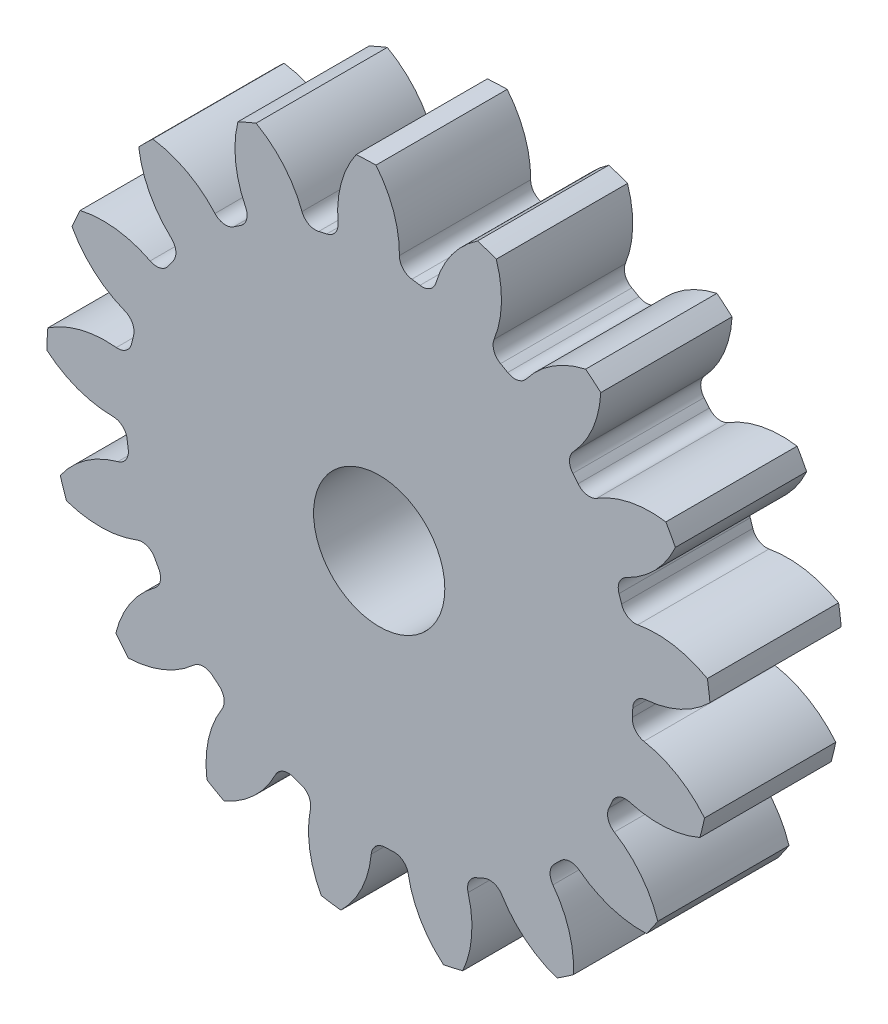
ISO-10303-21;
HEADER;
FILE_DESCRIPTION(('STEP AP214'),'2;1');
FILE_NAME('part.step','',(''),(''),'','','');
FILE_SCHEMA(('AUTOMOTIVE_DESIGN { 1 0 10303 214 1 1 1 1 }'));
ENDSEC;
DATA;
#1=APPLICATION_CONTEXT('core data for automotive mechanical design processes');
#2=APPLICATION_PROTOCOL_DEFINITION('international standard','automotive_design',2000,#1);
#3=PRODUCT_CONTEXT('',#1,'mechanical');
#4=PRODUCT('Part','Part','',(#3));
#5=PRODUCT_RELATED_PRODUCT_CATEGORY('part','',(#4));
#6=PRODUCT_DEFINITION_FORMATION('','',#4);
#7=PRODUCT_DEFINITION_CONTEXT('part definition',#1,'design');
#8=PRODUCT_DEFINITION('design','',#6,#7);
#9=PRODUCT_DEFINITION_SHAPE('','',#8);
#10=(LENGTH_UNIT() NAMED_UNIT(*) SI_UNIT(.MILLI.,.METRE.));
#11=(NAMED_UNIT(*) PLANE_ANGLE_UNIT() SI_UNIT($,.RADIAN.));
#12=(NAMED_UNIT(*) SI_UNIT($,.STERADIAN.) SOLID_ANGLE_UNIT());
#13=UNCERTAINTY_MEASURE_WITH_UNIT(LENGTH_MEASURE(1.E-05),#10,'distance_accuracy_value','');
#14=(GEOMETRIC_REPRESENTATION_CONTEXT(3) GLOBAL_UNCERTAINTY_ASSIGNED_CONTEXT((#13)) GLOBAL_UNIT_ASSIGNED_CONTEXT((#10,
#11,#12)) REPRESENTATION_CONTEXT('',''));
#15=CARTESIAN_POINT('',(0.,0.,0.));
#16=DIRECTION('',(0.,0.,1.));
#17=DIRECTION('',(1.,0.,0.));
#18=AXIS2_PLACEMENT_3D('',#15,#16,#17);
#19=CARTESIAN_POINT('',(0.,0.,127.));
#20=DIRECTION('',(0.,0.,-1.));
#21=DIRECTION('',(-1.,0.,0.));
#22=AXIS2_PLACEMENT_3D('',#19,#20,#21);
#23=CYLINDRICAL_SURFACE('',#22,321.733333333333);
#24=DIRECTION('',(0.,0.,-1.));
#25=VECTOR('',#24,1.);
#26=CARTESIAN_POINT('',(317.534877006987,51.806753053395,63.5));
#27=LINE('',#26,#25);
#28=CARTESIAN_POINT('',(317.534877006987,51.806753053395,127.));
#29=VERTEX_POINT('',#28);
#30=CARTESIAN_POINT('',(317.534877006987,51.806753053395,0.));
#31=VERTEX_POINT('',#30);
#32=EDGE_CURVE('E708',#29,#31,#27,.T.);
#33=ORIENTED_EDGE('',*,*,#32,.F.);
#34=CARTESIAN_POINT('',(0.,0.,127.));
#35=DIRECTION('',(0.,0.,1.));
#36=DIRECTION('',(1.,0.,0.));
#37=AXIS2_PLACEMENT_3D('',#34,#35,#36);
#38=CIRCLE('',#37,321.733333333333);
#39=CARTESIAN_POINT('',(320.055727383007,32.8126370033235,127.));
#40=VERTEX_POINT('',#39);
#41=EDGE_CURVE('E1315',#40,#29,#38,.T.);
#42=ORIENTED_EDGE('',*,*,#41,.F.);
#43=DIRECTION('',(0.,0.,-1.));
#44=VECTOR('',#43,1.);
#45=CARTESIAN_POINT('',(320.055727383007,32.8126370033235,63.5));
#46=LINE('',#45,#44);
#47=CARTESIAN_POINT('',(320.055727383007,32.8126370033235,0.));
#48=VERTEX_POINT('',#47);
#49=EDGE_CURVE('E1309',#48,#40,#46,.F.);
#50=ORIENTED_EDGE('',*,*,#49,.F.);
#51=CARTESIAN_POINT('',(0.,0.,0.));
#52=DIRECTION('',(0.,0.,1.));
#53=DIRECTION('',(1.,0.,0.));
#54=AXIS2_PLACEMENT_3D('',#51,#52,#53);
#55=CIRCLE('',#54,321.733333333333);
#56=EDGE_CURVE('E1320',#48,#31,#55,.T.);
#57=ORIENTED_EDGE('',*,*,#56,.T.);
#58=EDGE_LOOP('',(#33,#42,#50,#57));
#59=FACE_BOUND('',#58,.T.);
#60=ADVANCED_FACE('F33',(#59),#23,.T.);
#61=DIRECTION('',(0.,0.,-1.));
#62=VECTOR('',#61,1.);
#63=CARTESIAN_POINT('',(286.589785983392,146.2143370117,63.5));
#64=LINE('',#63,#62);
#65=CARTESIAN_POINT('',(286.589785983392,146.2143370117,0.));
#66=VERTEX_POINT('',#65);
#67=CARTESIAN_POINT('',(286.589785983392,146.2143370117,127.));
#68=VERTEX_POINT('',#67);
#69=EDGE_CURVE('E679',#66,#68,#64,.F.);
#70=ORIENTED_EDGE('',*,*,#69,.F.);
#71=CARTESIAN_POINT('',(277.377696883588,163.015186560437,0.));
#72=VERTEX_POINT('',#71);
#73=EDGE_CURVE('E1323',#66,#72,#55,.T.);
#74=ORIENTED_EDGE('',*,*,#73,.T.);
#75=DIRECTION('',(0.,0.,-1.));
#76=VECTOR('',#75,1.);
#77=CARTESIAN_POINT('',(277.377696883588,163.015186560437,63.5));
#78=LINE('',#77,#76);
#79=CARTESIAN_POINT('',(277.377696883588,163.015186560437,127.));
#80=VERTEX_POINT('',#79);
#81=EDGE_CURVE('E741',#80,#72,#78,.T.);
#82=ORIENTED_EDGE('',*,*,#81,.F.);
#83=EDGE_CURVE('E1318',#68,#80,#38,.T.);
#84=ORIENTED_EDGE('',*,*,#83,.F.);
#85=EDGE_LOOP('',(#70,#74,#82,#84));
#86=FACE_BOUND('',#85,.T.);
#87=ADVANCED_FACE('F1516',(#86),#23,.T.);
#88=CARTESIAN_POINT('',(0.,0.,127.));
#89=DIRECTION('',(0.,0.,1.));
#90=DIRECTION('',(1.,0.,0.));
#91=AXIS2_PLACEMENT_3D('',#88,#89,#90);
#92=PLANE('',#91);
#93=CARTESIAN_POINT('',(0.,0.,127.000000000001));
#94=DIRECTION('',(0.,0.,1.));
#95=DIRECTION('',(1.,0.,0.));
#96=AXIS2_PLACEMENT_3D('',#93,#94,#95);
#97=CIRCLE('',#96,63.5);
#98=CARTESIAN_POINT('',(63.5,0.,127.000000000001));
#99=VERTEX_POINT('',#98);
#100=EDGE_CURVE('E696',#99,#99,#97,.T.);
#101=ORIENTED_EDGE('',*,*,#100,.F.);
#102=EDGE_LOOP('',(#101));
#103=FACE_BOUND('',#102,.T.);
#104=ORIENTED_EDGE('',*,*,#41,.T.);
#105=CARTESIAN_POINT('',(268.265287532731,-34.7466579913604,127.));
#106=DIRECTION('',(0.,0.,-1.));
#107=DIRECTION('',(0.932472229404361,0.361241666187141,0.));
#108=AXIS2_PLACEMENT_3D('',#105,#106,#107);
#109=CIRCLE('',#108,99.5941032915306);
#110=CARTESIAN_POINT('',(250.199221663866,63.1951751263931,127.));
#111=VERTEX_POINT('',#110);
#112=EDGE_CURVE('E688',#111,#29,#109,.T.);
#113=ORIENTED_EDGE('',*,*,#112,.F.);
#114=CARTESIAN_POINT('',(247.698894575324,76.7502357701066,127.));
#115=DIRECTION('',(0.,0.,1.));
#116=DIRECTION('',(-0.932472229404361,-0.361241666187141,0.));
#117=AXIS2_PLACEMENT_3D('',#114,#115,#116);
#118=CIRCLE('',#117,13.7837333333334);
#119=CARTESIAN_POINT('',(234.532713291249,72.6706555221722,127.));
#120=VERTEX_POINT('',#119);
#121=EDGE_CURVE('E686',#120,#111,#118,.T.);
#122=ORIENTED_EDGE('',*,*,#121,.F.);
#123=CARTESIAN_POINT('',(0.,0.,127.));
#124=DIRECTION('',(0.,0.,-1.));
#125=DIRECTION('',(0.932472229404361,0.361241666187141,0.));
#126=AXIS2_PLACEMENT_3D('',#123,#124,#125);
#127=CIRCLE('',#126,245.533333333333);
#128=CARTESIAN_POINT('',(232.043565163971,80.2645727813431,127.));
#129=VERTEX_POINT('',#128);
#130=EDGE_CURVE('E671',#129,#120,#127,.T.);
#131=ORIENTED_EDGE('',*,*,#130,.F.);
#132=CARTESIAN_POINT('',(245.070010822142,84.7704598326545,127.));
#133=DIRECTION('',(0.,0.,1.));
#134=DIRECTION('',(-0.932472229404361,-0.361241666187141,0.));
#135=AXIS2_PLACEMENT_3D('',#132,#133,#134);
#136=CIRCLE('',#135,13.7837333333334);
#137=CARTESIAN_POINT('',(239.061098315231,97.1754699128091,127.));
#138=VERTEX_POINT('',#137);
#139=EDGE_CURVE('E663',#138,#129,#136,.T.);
#140=ORIENTED_EDGE('',*,*,#139,.F.);
#141=CARTESIAN_POINT('',(195.64381517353,186.807634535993,127.));
#142=DIRECTION('',(0.,0.,-1.));
#143=DIRECTION('',(-0.932472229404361,-0.361241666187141,0.));
#144=AXIS2_PLACEMENT_3D('',#141,#142,#143);
#145=CIRCLE('',#144,99.5941032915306);
#146=EDGE_CURVE('E693',#68,#138,#145,.T.);
#147=ORIENTED_EDGE('',*,*,#146,.F.);
#148=ORIENTED_EDGE('',*,*,#83,.T.);
#149=CARTESIAN_POINT('',(262.70187136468,64.5083058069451,127.));
#150=DIRECTION('',(0.,0.,-1.));
#151=DIRECTION('',(0.739008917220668,0.673695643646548,0.));
#152=AXIS2_PLACEMENT_3D('',#149,#150,#151);
#153=CIRCLE('',#152,99.5941032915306);
#154=CARTESIAN_POINT('',(210.475095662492,149.31012955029,127.));
#155=VERTEX_POINT('',#154);
#156=EDGE_CURVE('E717',#155,#80,#153,.T.);
#157=ORIENTED_EDGE('',*,*,#156,.F.);
#158=CARTESIAN_POINT('',(203.246957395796,161.046624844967,127.));
#159=DIRECTION('',(0.,0.,1.));
#160=DIRECTION('',(-0.739008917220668,-0.673695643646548,0.));
#161=AXIS2_PLACEMENT_3D('',#158,#159,#160);
#162=CIRCLE('',#161,13.7837333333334);
#163=CARTESIAN_POINT('',(192.443573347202,152.486356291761,127.));
#164=VERTEX_POINT('',#163);
#165=EDGE_CURVE('E715',#164,#155,#162,.T.);
#166=ORIENTED_EDGE('',*,*,#165,.F.);
#167=CARTESIAN_POINT('',(0.,0.,127.));
#168=DIRECTION('',(0.,0.,-1.));
#169=DIRECTION('',(0.739008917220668,0.673695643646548,0.));
#170=AXIS2_PLACEMENT_3D('',#167,#168,#169);
#171=CIRCLE('',#170,245.533333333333);
#172=CARTESIAN_POINT('',(187.37927252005,158.668289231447,127.));
#173=VERTEX_POINT('',#172);
#174=EDGE_CURVE('E712',#173,#164,#171,.T.);
#175=ORIENTED_EDGE('',*,*,#174,.F.);
#176=CARTESIAN_POINT('',(197.898357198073,167.575598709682,127.));
#177=DIRECTION('',(0.,0.,1.));
#178=DIRECTION('',(-0.739008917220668,-0.673695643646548,0.));
#179=AXIS2_PLACEMENT_3D('',#176,#177,#178);
#180=CIRCLE('',#179,13.7837333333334);
#181=CARTESIAN_POINT('',(187.814006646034,176.972256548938,127.));
#182=VERTEX_POINT('',#181);
#183=EDGE_CURVE('E710',#182,#173,#180,.T.);
#184=ORIENTED_EDGE('',*,*,#183,.F.);
#185=CARTESIAN_POINT('',(114.949723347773,244.867629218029,127.));
#186=DIRECTION('',(0.,0.,-1.));
#187=DIRECTION('',(-0.739008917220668,-0.673695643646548,0.));
#188=AXIS2_PLACEMENT_3D('',#185,#186,#187);
#189=CIRCLE('',#188,99.5941032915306);
#190=CARTESIAN_POINT('',(214.418305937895,239.86898060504,127.));
#191=VERTEX_POINT('',#190);
#192=EDGE_CURVE('E720',#191,#182,#189,.T.);
#193=ORIENTED_EDGE('',*,*,#192,.F.);
#194=CARTESIAN_POINT('',(199.759121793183,252.20751582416,127.));
#195=VERTEX_POINT('',#194);
#196=EDGE_CURVE('E1365',#191,#195,#38,.T.);
#197=ORIENTED_EDGE('',*,*,#196,.T.);
#198=CARTESIAN_POINT('',(221.659111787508,155.05106545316,127.));
#199=DIRECTION('',(0.,0.,-1.));
#200=DIRECTION('',(0.445738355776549,0.895163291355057,0.));
#201=AXIS2_PLACEMENT_3D('',#198,#199,#200);
#202=CIRCLE('',#201,99.5941032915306);
#203=CARTESIAN_POINT('',(142.325141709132,215.259923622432,127.));
#204=VERTEX_POINT('',#203);
#205=EDGE_CURVE('E752',#204,#195,#202,.T.);
#206=ORIENTED_EDGE('',*,*,#205,.F.);
#207=CARTESIAN_POINT('',(131.345392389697,223.59277484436,127.));
#208=DIRECTION('',(0.,0.,1.));
#209=DIRECTION('',(-0.445738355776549,-0.895163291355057,0.));
#210=AXIS2_PLACEMENT_3D('',#207,#208,#209);
#211=CIRCLE('',#210,13.7837333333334);
#212=CARTESIAN_POINT('',(124.363862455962,211.707929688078,127.));
#213=VERTEX_POINT('',#212);
#214=EDGE_CURVE('E750',#213,#204,#211,.T.);
#215=ORIENTED_EDGE('',*,*,#214,.F.);
#216=CARTESIAN_POINT('',(0.,0.,127.));
#217=DIRECTION('',(0.,0.,-1.));
#218=DIRECTION('',(0.445738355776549,0.895163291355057,0.));
#219=AXIS2_PLACEMENT_3D('',#216,#217,#218);
#220=CIRCLE('',#219,245.533333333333);
#221=CARTESIAN_POINT('',(117.408370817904,215.642974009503,127.));
#222=VERTEX_POINT('',#221);
#223=EDGE_CURVE('E747',#222,#213,#220,.T.);
#224=ORIENTED_EDGE('',*,*,#223,.F.);
#225=CARTESIAN_POINT('',(123.999433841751,227.748724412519,127.));
#226=DIRECTION('',(0.,0.,1.));
#227=DIRECTION('',(-0.445738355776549,-0.895163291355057,0.));
#228=AXIS2_PLACEMENT_3D('',#225,#226,#227);
#229=CIRCLE('',#228,13.7837333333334);
#230=CARTESIAN_POINT('',(111.201592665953,232.867959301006,127.));
#231=VERTEX_POINT('',#230);
#232=EDGE_CURVE('E745',#231,#222,#229,.T.);
#233=ORIENTED_EDGE('',*,*,#232,.F.);
#234=CARTESIAN_POINT('',(18.7310344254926,269.856893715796,127.));
#235=DIRECTION('',(0.,0.,-1.));
#236=DIRECTION('',(-0.445738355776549,-0.895163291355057,0.));
#237=AXIS2_PLACEMENT_3D('',#234,#235,#236);
#238=CIRCLE('',#237,99.5941032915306);
#239=CARTESIAN_POINT('',(113.288445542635,301.127989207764,127.));
#240=VERTEX_POINT('',#239);
#241=EDGE_CURVE('E755',#240,#231,#238,.T.);
#242=ORIENTED_EDGE('',*,*,#241,.F.);
#243=CARTESIAN_POINT('',(95.1619704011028,307.337822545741,127.));
#244=VERTEX_POINT('',#243);
#245=EDGE_CURVE('E1498',#240,#244,#38,.T.);
#246=ORIENTED_EDGE('',*,*,#245,.T.);
#247=CARTESIAN_POINT('',(150.680060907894,224.653319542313,127.));
#248=DIRECTION('',(0.,0.,-1.));
#249=DIRECTION('',(0.092268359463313,0.995734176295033,0.));
#250=AXIS2_PLACEMENT_3D('',#247,#248,#249);
#251=CIRCLE('',#250,99.5941032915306);
#252=CARTESIAN_POINT('',(54.953388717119,252.13767221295,127.));
#253=VERTEX_POINT('',#252);
#254=EDGE_CURVE('E790',#253,#244,#251,.T.);
#255=ORIENTED_EDGE('',*,*,#254,.F.);
#256=CARTESIAN_POINT('',(41.7049043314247,255.941481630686,127.));
#257=DIRECTION('',(0.,0.,1.));
#258=DIRECTION('',(-0.092268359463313,-0.995734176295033,0.));
#259=AXIS2_PLACEMENT_3D('',#256,#257,#258);
#260=CIRCLE('',#259,13.7837333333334);
#261=CARTESIAN_POINT('',(39.4881228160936,242.337174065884,127.));
#262=VERTEX_POINT('',#261);
#263=EDGE_CURVE('E788',#262,#253,#260,.T.);
#264=ORIENTED_EDGE('',*,*,#263,.F.);
#265=CARTESIAN_POINT('',(0.,0.,127.));
#266=DIRECTION('',(0.,0.,-1.));
#267=DIRECTION('',(0.092268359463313,0.995734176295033,0.));
#268=AXIS2_PLACEMENT_3D('',#265,#266,#267);
#269=CIRCLE('',#268,245.533333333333);
#270=CARTESIAN_POINT('',(31.5808180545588,243.493880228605,127.));
#271=VERTEX_POINT('',#270);
#272=EDGE_CURVE('E785',#271,#262,#269,.T.);
#273=ORIENTED_EDGE('',*,*,#272,.F.);
#274=CARTESIAN_POINT('',(33.3536998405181,257.163122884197,127.));
#275=DIRECTION('',(0.,0.,1.));
#276=DIRECTION('',(-0.092268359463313,-0.995734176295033,0.));
#277=AXIS2_PLACEMENT_3D('',#274,#275,#276);
#278=CIRCLE('',#277,13.7837333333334);
#279=CARTESIAN_POINT('',(19.5707874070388,257.313553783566,127.));
#280=VERTEX_POINT('',#279);
#281=EDGE_CURVE('E783',#280,#271,#278,.T.);
#282=ORIENTED_EDGE('',*,*,#281,.F.);
#283=CARTESIAN_POINT('',(-80.017384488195,258.400489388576,127.));
#284=DIRECTION('',(0.,0.,-1.));
#285=DIRECTION('',(-0.092268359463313,-0.995734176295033,0.));
#286=AXIS2_PLACEMENT_3D('',#283,#284,#285);
#287=CIRCLE('',#286,99.5941032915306);
#288=CARTESIAN_POINT('',(-3.14164717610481,321.717994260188,127.));
#289=VERTEX_POINT('',#288);
#290=EDGE_CURVE('E793',#289,#280,#287,.T.);
#291=ORIENTED_EDGE('',*,*,#290,.F.);
#292=CARTESIAN_POINT('',(-22.2873324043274,320.960453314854,127.));
#293=VERTEX_POINT('',#292);
#294=EDGE_CURVE('E1494',#289,#293,#38,.T.);
#295=ORIENTED_EDGE('',*,*,#294,.T.);
#296=CARTESIAN_POINT('',(59.3508328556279,263.914897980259,127.));
#297=DIRECTION('',(0.,0.,-1.));
#298=DIRECTION('',(-0.273662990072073,0.961825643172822,0.));
#299=AXIS2_PLACEMENT_3D('',#296,#297,#298);
#300=CIRCLE('',#299,99.5941032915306);
#301=CARTESIAN_POINT('',(-39.8401239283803,254.962831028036,127.));
#302=VERTEX_POINT('',#301);
#303=EDGE_CURVE('E828',#302,#293,#300,.T.);
#304=ORIENTED_EDGE('',*,*,#303,.F.);
#305=CARTESIAN_POINT('',(-53.568062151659,253.72387310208,127.));
#306=DIRECTION('',(0.,0.,1.));
#307=DIRECTION('',(0.273662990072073,-0.961825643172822,0.));
#308=AXIS2_PLACEMENT_3D('',#305,#306,#307);
#309=CIRCLE('',#308,13.7837333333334);
#310=CARTESIAN_POINT('',(-50.7207066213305,240.237440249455,127.));
#311=VERTEX_POINT('',#310);
#312=EDGE_CURVE('E826',#311,#302,#309,.T.);
#313=ORIENTED_EDGE('',*,*,#312,.F.);
#314=CARTESIAN_POINT('',(0.,0.,127.));
#315=DIRECTION('',(0.,0.,-1.));
#316=DIRECTION('',(-0.273662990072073,0.961825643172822,0.));
#317=AXIS2_PLACEMENT_3D('',#314,#315,#316);
#318=CIRCLE('',#317,245.533333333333);
#319=CARTESIAN_POINT('',(-58.5118991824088,238.459588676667,127.));
#320=VERTEX_POINT('',#319);
#321=EDGE_CURVE('E823',#320,#311,#318,.T.);
#322=ORIENTED_EDGE('',*,*,#321,.F.);
#323=CARTESIAN_POINT('',(-61.7966361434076,251.846216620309,127.));
#324=DIRECTION('',(0.,0.,1.));
#325=DIRECTION('',(0.273662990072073,-0.961825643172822,0.));
#326=AXIS2_PLACEMENT_3D('',#323,#324,#325);
#327=CIRCLE('',#326,13.7837333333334);
#328=CARTESIAN_POINT('',(-74.7031611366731,247.007527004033,127.));
#329=VERTEX_POINT('',#328);
#330=EDGE_CURVE('E821',#329,#320,#327,.T.);
#331=ORIENTED_EDGE('',*,*,#330,.F.);
#332=CARTESIAN_POINT('',(-167.959012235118,212.045667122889,127.));
#333=DIRECTION('',(0.,0.,-1.));
#334=DIRECTION('',(0.273662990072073,-0.961825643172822,0.));
#335=AXIS2_PLACEMENT_3D('',#332,#333,#334);
#336=CIRCLE('',#335,99.5941032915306);
#337=CARTESIAN_POINT('',(-119.147443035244,298.858201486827,127.));
#338=VERTEX_POINT('',#337);
#339=EDGE_CURVE('E831',#338,#329,#336,.T.);
#340=ORIENTED_EDGE('',*,*,#339,.F.);
#341=CARTESIAN_POINT('',(-136.726607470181,291.235596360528,127.));
#342=VERTEX_POINT('',#341);
#343=EDGE_CURVE('E1490',#338,#342,#38,.T.);
#344=ORIENTED_EDGE('',*,*,#343,.T.);
#345=CARTESIAN_POINT('',(-39.9940540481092,267.533307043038,127.));
#346=DIRECTION('',(0.,0.,-1.));
#347=DIRECTION('',(-0.602634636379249,0.798017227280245,0.));
#348=AXIS2_PLACEMENT_3D('',#345,#346,#347);
#349=CIRCLE('',#348,99.5941032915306);
#350=CARTESIAN_POINT('',(-129.253007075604,223.353846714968,127.));
#351=VERTEX_POINT('',#350);
#352=EDGE_CURVE('E866',#351,#342,#349,.T.);
#353=ORIENTED_EDGE('',*,*,#352,.F.);
#354=CARTESIAN_POINT('',(-141.606365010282,217.239449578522,127.));
#355=DIRECTION('',(0.,0.,1.));
#356=DIRECTION('',(0.602634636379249,-0.798017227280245,0.));
#357=AXIS2_PLACEMENT_3D('',#354,#355,#356);
#358=CIRCLE('',#357,13.7837333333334);
#359=CARTESIAN_POINT('',(-134.079423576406,205.692308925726,127.));
#360=VERTEX_POINT('',#359);
#361=EDGE_CURVE('E864',#360,#351,#358,.T.);
#362=ORIENTED_EDGE('',*,*,#361,.F.);
#363=CARTESIAN_POINT('',(0.,0.,127.));
#364=DIRECTION('',(0.,0.,-1.));
#365=DIRECTION('',(-0.602634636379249,0.798017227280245,0.));
#366=AXIS2_PLACEMENT_3D('',#363,#364,#365);
#367=CIRCLE('',#366,245.533333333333);
#368=CARTESIAN_POINT('',(-140.702260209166,201.220008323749,127.));
#369=VERTEX_POINT('',#368);
#370=EDGE_CURVE('E861',#369,#360,#367,.T.);
#371=ORIENTED_EDGE('',*,*,#370,.F.);
#372=CARTESIAN_POINT('',(-148.600993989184,212.516083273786,127.));
#373=DIRECTION('',(0.,0.,1.));
#374=DIRECTION('',(0.602634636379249,-0.798017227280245,0.));
#375=AXIS2_PLACEMENT_3D('',#372,#373,#374);
#376=CIRCLE('',#375,13.7837333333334);
#377=CARTESIAN_POINT('',(-158.888033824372,203.341764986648,127.));
#378=VERTEX_POINT('',#377);
#379=EDGE_CURVE('E859',#378,#369,#376,.T.);
#380=ORIENTED_EDGE('',*,*,#379,.F.);
#381=CARTESIAN_POINT('',(-233.216844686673,137.052902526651,127.));
#382=DIRECTION('',(0.,0.,-1.));
#383=DIRECTION('',(0.602634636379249,-0.798017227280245,0.));
#384=AXIS2_PLACEMENT_3D('',#381,#382,#383);
#385=CIRCLE('',#384,99.5941032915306);
#386=CARTESIAN_POINT('',(-219.0617164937,235.635952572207,127.));
#387=VERTEX_POINT('',#386);
#388=EDGE_CURVE('E869',#387,#378,#385,.T.);
#389=ORIENTED_EDGE('',*,*,#388,.F.);
#390=CARTESIAN_POINT('',(-232.700196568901,222.177758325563,127.));
#391=VERTEX_POINT('',#390);
#392=EDGE_CURVE('E1486',#387,#391,#38,.T.);
#393=ORIENTED_EDGE('',*,*,#392,.T.);
#394=CARTESIAN_POINT('',(-133.937522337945,235.019860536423,127.));
#395=DIRECTION('',(0.,0.,-1.));
#396=DIRECTION('',(-0.85021713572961,0.526432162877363,0.));
#397=AXIS2_PLACEMENT_3D('',#394,#395,#396);
#398=CIRCLE('',#397,99.5941032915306);
#399=CARTESIAN_POINT('',(-201.209555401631,161.579687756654,127.));
#400=VERTEX_POINT('',#399);
#401=EDGE_CURVE('E904',#400,#391,#398,.T.);
#402=ORIENTED_EDGE('',*,*,#401,.F.);
#403=CARTESIAN_POINT('',(-210.51994360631,151.415634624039,127.));
#404=DIRECTION('',(0.,0.,1.));
#405=DIRECTION('',(0.85021713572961,-0.526432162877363,0.));
#406=AXIS2_PLACEMENT_3D('',#403,#404,#405);
#407=CIRCLE('',#406,13.7837333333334);
#408=CARTESIAN_POINT('',(-199.329971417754,143.367291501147,127.));
#409=VERTEX_POINT('',#408);
#410=EDGE_CURVE('E902',#409,#400,#407,.T.);
#411=ORIENTED_EDGE('',*,*,#410,.F.);
#412=CARTESIAN_POINT('',(0.,0.,127.));
#413=DIRECTION('',(0.,0.,-1.));
#414=DIRECTION('',(-0.85021713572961,0.526432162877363,0.));
#415=AXIS2_PLACEMENT_3D('',#412,#413,#414);
#416=CIRCLE('',#415,245.533333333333);
#417=CARTESIAN_POINT('',(-203.890001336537,136.804550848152,127.));
#418=VERTEX_POINT('',#417);
#419=EDGE_CURVE('E899',#418,#409,#416,.T.);
#420=ORIENTED_EDGE('',*,*,#419,.F.);
#421=CARTESIAN_POINT('',(-215.335964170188,144.484475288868,127.));
#422=DIRECTION('',(0.,0.,1.));
#423=DIRECTION('',(0.85021713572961,-0.526432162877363,0.));
#424=AXIS2_PLACEMENT_3D('',#421,#422,#423);
#425=CIRCLE('',#424,13.7837333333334);
#426=CARTESIAN_POINT('',(-221.6141971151,132.213570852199,127.));
#427=VERTEX_POINT('',#426);
#428=EDGE_CURVE('E897',#427,#418,#425,.T.);
#429=ORIENTED_EDGE('',*,*,#428,.F.);
#430=CARTESIAN_POINT('',(-266.977449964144,43.5503840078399,127.));
#431=DIRECTION('',(0.,0.,-1.));
#432=DIRECTION('',(0.85021713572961,-0.526432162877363,0.));
#433=AXIS2_PLACEMENT_3D('',#430,#431,#432);
#434=CIRCLE('',#433,99.5941032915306);
#435=CARTESIAN_POINT('',(-289.390491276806,140.589762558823,127.));
#436=VERTEX_POINT('',#435);
#437=EDGE_CURVE('E907',#436,#427,#434,.T.);
#438=ORIENTED_EDGE('',*,*,#437,.F.);
#439=CARTESIAN_POINT('',(-297.246334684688,123.113582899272,127.));
#440=VERTEX_POINT('',#439);
#441=EDGE_CURVE('E1482',#436,#440,#38,.T.);
#442=ORIENTED_EDGE('',*,*,#441,.T.);
#443=CARTESIAN_POINT('',(-209.791986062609,170.765679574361,127.));
#444=DIRECTION('',(0.,0.,-1.));
#445=DIRECTION('',(-0.9829730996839,0.183749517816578,0.));
#446=AXIS2_PLACEMENT_3D('',#443,#444,#445);
#447=CIRCLE('',#446,99.5941032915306);
#448=CARTESIAN_POINT('',(-245.991638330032,77.983296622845,127.));
#449=VERTEX_POINT('',#448);
#450=EDGE_CURVE('E942',#449,#440,#447,.T.);
#451=ORIENTED_EDGE('',*,*,#450,.F.);
#452=CARTESIAN_POINT('',(-251.001637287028,65.1422991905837,127.));
#453=DIRECTION('',(0.,0.,1.));
#454=DIRECTION('',(0.9829730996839,-0.183749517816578,0.));
#455=AXIS2_PLACEMENT_3D('',#452,#453,#454);
#456=CIRCLE('',#455,13.7837333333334);
#457=CARTESIAN_POINT('',(-237.659902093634,61.679726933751,127.));
#458=VERTEX_POINT('',#457);
#459=EDGE_CURVE('E940',#458,#449,#456,.T.);
#460=ORIENTED_EDGE('',*,*,#459,.F.);
#461=CARTESIAN_POINT('',(0.,0.,127.));
#462=DIRECTION('',(0.,0.,-1.));
#463=DIRECTION('',(-0.9829730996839,0.183749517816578,0.));
#464=AXIS2_PLACEMENT_3D('',#461,#462,#463);
#465=CIRCLE('',#464,245.533333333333);
#466=CARTESIAN_POINT('',(-239.541267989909,53.9128807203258,127.));
#467=VERTEX_POINT('',#466);
#468=EDGE_CURVE('E937',#467,#458,#465,.T.);
#469=ORIENTED_EDGE('',*,*,#468,.F.);
#470=CARTESIAN_POINT('',(-252.988619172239,56.9394383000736,127.));
#471=DIRECTION('',(0.,0.,1.));
#472=DIRECTION('',(0.9829730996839,-0.183749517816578,0.));
#473=AXIS2_PLACEMENT_3D('',#470,#471,#472);
#474=CIRCLE('',#473,13.7837333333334);
#475=CARTESIAN_POINT('',(-254.410135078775,43.2292013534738,127.));
#476=VERTEX_POINT('',#475);
#477=EDGE_CURVE('E935',#476,#467,#474,.T.);
#478=ORIENTED_EDGE('',*,*,#477,.F.);
#479=CARTESIAN_POINT('',(-264.681271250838,-55.8338551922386,127.));
#480=DIRECTION('',(0.,0.,-1.));
#481=DIRECTION('',(0.9829730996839,-0.183749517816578,0.));
#482=AXIS2_PLACEMENT_3D('',#479,#480,#481);
#483=CIRCLE('',#482,99.5941032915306);
#484=CARTESIAN_POINT('',(-320.635476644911,26.556146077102,127.));
#485=VERTEX_POINT('',#484);
#486=EDGE_CURVE('E945',#485,#476,#483,.T.);
#487=ORIENTED_EDGE('',*,*,#486,.F.);
#488=CARTESIAN_POINT('',(-321.647708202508,7.4222359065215,127.));
#489=VERTEX_POINT('',#488);
#490=EDGE_CURVE('E1478',#485,#489,#38,.T.);
#491=ORIENTED_EDGE('',*,*,#490,.T.);
#492=CARTESIAN_POINT('',(-257.312879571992,83.4486473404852,127.));
#493=DIRECTION('',(0.,0.,-1.));
#494=DIRECTION('',(-0.982973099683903,-0.183749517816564,0.));
#495=AXIS2_PLACEMENT_3D('',#492,#493,#494);
#496=CIRCLE('',#495,99.5941032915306);
#497=CARTESIAN_POINT('',(-257.551187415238,-16.1451708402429,127.));
#498=VERTEX_POINT('',#497);
#499=EDGE_CURVE('E980',#498,#489,#496,.T.);
#500=ORIENTED_EDGE('',*,*,#499,.F.);
#501=CARTESIAN_POINT('',(-257.584169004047,-29.9288647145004,127.));
#502=DIRECTION('',(0.,0.,1.));
#503=DIRECTION('',(0.982973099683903,0.183749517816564,0.));
#504=AXIS2_PLACEMENT_3D('',#501,#502,#503);
#505=CIRCLE('',#504,13.7837333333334);
#506=CARTESIAN_POINT('',(-243.892546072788,-28.3380265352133,127.));
#507=VERTEX_POINT('',#506);
#508=EDGE_CURVE('E978',#507,#498,#505,.T.);
#509=ORIENTED_EDGE('',*,*,#508,.F.);
#510=CARTESIAN_POINT('',(0.,0.,127.));
#511=DIRECTION('',(0.,0.,-1.));
#512=DIRECTION('',(-0.982973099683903,-0.183749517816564,0.));
#513=AXIS2_PLACEMENT_3D('',#510,#511,#512);
#514=CIRCLE('',#513,245.533333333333);
#515=CARTESIAN_POINT('',(-242.841159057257,-36.260022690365,127.));
#516=VERTEX_POINT('',#515);
#517=EDGE_CURVE('E975',#516,#507,#514,.T.);
#518=ORIENTED_EDGE('',*,*,#517,.F.);
#519=CARTESIAN_POINT('',(-256.473759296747,-38.2955853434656,127.));
#520=DIRECTION('',(0.,0.,1.));
#521=DIRECTION('',(0.982973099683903,0.183749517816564,0.));
#522=AXIS2_PLACEMENT_3D('',#519,#520,#521);
#523=CIRCLE('',#522,13.7837333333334);
#524=CARTESIAN_POINT('',(-252.846574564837,-51.593511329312,127.));
#525=VERTEX_POINT('',#524);
#526=EDGE_CURVE('E973',#525,#516,#523,.T.);
#527=ORIENTED_EDGE('',*,*,#526,.F.);
#528=CARTESIAN_POINT('',(-226.638420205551,-147.677422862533,127.));
#529=DIRECTION('',(0.,0.,-1.));
#530=DIRECTION('',(0.982973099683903,0.183749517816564,0.));
#531=AXIS2_PLACEMENT_3D('',#528,#529,#530);
#532=CIRCLE('',#531,99.5941032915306);
#533=CARTESIAN_POINT('',(-308.57686418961,-91.0640250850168,127.));
#534=VERTEX_POINT('',#533);
#535=EDGE_CURVE('E983',#534,#525,#532,.T.);
#536=ORIENTED_EDGE('',*,*,#535,.F.);
#537=CARTESIAN_POINT('',(-302.6087764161,-109.271525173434,127.));
#538=VERTEX_POINT('',#537);
#539=EDGE_CURVE('E1474',#534,#538,#38,.T.);
#540=ORIENTED_EDGE('',*,*,#539,.T.);
#541=CARTESIAN_POINT('',(-270.082242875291,-15.1385871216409,127.));
#542=DIRECTION('',(0.,0.,-1.));
#543=DIRECTION('',(-0.850217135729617,-0.526432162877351,0.));
#544=AXIS2_PLACEMENT_3D('',#541,#542,#543);
#545=CIRCLE('',#544,99.5941032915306);
#546=CARTESIAN_POINT('',(-234.327021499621,-108.093143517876,127.));
#547=VERTEX_POINT('',#546);
#548=EDGE_CURVE('E1018',#547,#538,#545,.T.);
#549=ORIENTED_EDGE('',*,*,#548,.F.);
#550=CARTESIAN_POINT('',(-229.378531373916,-120.957969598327,127.));
#551=DIRECTION('',(0.,0.,1.));
#552=DIRECTION('',(0.850217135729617,0.526432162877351,0.));
#553=AXIS2_PLACEMENT_3D('',#550,#551,#552);
#554=CIRCLE('',#553,13.7837333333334);
#555=CARTESIAN_POINT('',(-217.186150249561,-114.528572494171,127.));
#556=VERTEX_POINT('',#555);
#557=EDGE_CURVE('E1016',#556,#547,#554,.T.);
#558=ORIENTED_EDGE('',*,*,#557,.F.);
#559=CARTESIAN_POINT('',(0.,0.,127.));
#560=DIRECTION('',(0.,0.,-1.));
#561=DIRECTION('',(-0.850217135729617,-0.526432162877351,0.));
#562=AXIS2_PLACEMENT_3D('',#559,#560,#561);
#563=CIRCLE('',#562,245.533333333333);
#564=CARTESIAN_POINT('',(-213.344005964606,-121.535809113,127.));
#565=VERTEX_POINT('',#564);
#566=EDGE_CURVE('E1013',#565,#556,#563,.T.);
#567=ORIENTED_EDGE('',*,*,#566,.F.);
#568=CARTESIAN_POINT('',(-225.320697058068,-128.358577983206,127.));
#569=DIRECTION('',(0.,0.,1.));
#570=DIRECTION('',(0.850217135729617,0.526432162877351,0.));
#571=AXIS2_PLACEMENT_3D('',#568,#569,#570);
#572=CIRCLE('',#571,13.7837333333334);
#573=CARTESIAN_POINT('',(-217.134683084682,-139.448234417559,127.));
#574=VERTEX_POINT('',#573);
#575=EDGE_CURVE('E1011',#574,#565,#572,.T.);
#576=ORIENTED_EDGE('',*,*,#575,.F.);
#577=CARTESIAN_POINT('',(-157.986794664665,-219.576336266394,127.));
#578=DIRECTION('',(0.,0.,-1.));
#579=DIRECTION('',(0.850217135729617,0.526432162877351,0.));
#580=AXIS2_PLACEMENT_3D('',#577,#578,#579);
#581=CIRCLE('',#580,99.5941032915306);
#582=CARTESIAN_POINT('',(-254.84323634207,-196.385495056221,127.));
#583=VERTEX_POINT('',#582);
#584=EDGE_CURVE('E1021',#583,#574,#581,.T.);
#585=ORIENTED_EDGE('',*,*,#584,.F.);
#586=CARTESIAN_POINT('',(-242.700852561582,-211.207561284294,127.));
#587=VERTEX_POINT('',#586);
#588=EDGE_CURVE('E1470',#583,#587,#38,.T.);
#589=ORIENTED_EDGE('',*,*,#588,.T.);
#590=CARTESIAN_POINT('',(-246.375502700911,-111.681271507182,127.));
#591=DIRECTION('',(0.,0.,-1.));
#592=DIRECTION('',(-0.602634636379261,-0.798017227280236,0.));
#593=AXIS2_PLACEMENT_3D('',#590,#591,#592);
#594=CIRCLE('',#593,99.5941032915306);
#595=CARTESIAN_POINT('',(-179.455692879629,-185.442538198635,127.));
#596=VERTEX_POINT('',#595);
#597=EDGE_CURVE('E1056',#596,#587,#594,.T.);
#598=ORIENTED_EDGE('',*,*,#597,.F.);
#599=CARTESIAN_POINT('',(-170.194052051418,-195.651030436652,127.));
#600=DIRECTION('',(0.,0.,1.));
#601=DIRECTION('',(0.602634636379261,0.798017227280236,0.));
#602=AXIS2_PLACEMENT_3D('',#599,#600,#601);
#603=CIRCLE('',#602,13.7837333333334);
#604=CARTESIAN_POINT('',(-161.147561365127,-185.251400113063,127.));
#605=VERTEX_POINT('',#604);
#606=EDGE_CURVE('E1054',#605,#596,#603,.T.);
#607=ORIENTED_EDGE('',*,*,#606,.F.);
#608=CARTESIAN_POINT('',(0.,0.,127.));
#609=DIRECTION('',(0.,0.,-1.));
#610=DIRECTION('',(-0.602634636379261,-0.798017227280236,0.));
#611=AXIS2_PLACEMENT_3D('',#608,#609,#610);
#612=CIRCLE('',#611,245.533333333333);
#613=CARTESIAN_POINT('',(-155.033562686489,-190.397511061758,127.));
#614=VERTEX_POINT('',#613);
#615=EDGE_CURVE('E1051',#614,#605,#612,.T.);
#616=ORIENTED_EDGE('',*,*,#615,.F.);
#617=CARTESIAN_POINT('',(-163.736826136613,-201.08603340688,127.));
#618=DIRECTION('',(0.,0.,1.));
#619=DIRECTION('',(0.602634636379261,0.798017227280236,0.));
#620=AXIS2_PLACEMENT_3D('',#617,#618,#619);
#621=CIRCLE('',#620,13.7837333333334);
#622=CARTESIAN_POINT('',(-152.097549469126,-208.469700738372,127.));
#623=VERTEX_POINT('',#622);
#624=EDGE_CURVE('E1049',#623,#614,#621,.T.);
#625=ORIENTED_EDGE('',*,*,#624,.F.);
#626=CARTESIAN_POINT('',(-67.9981770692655,-261.820248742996,127.));
#627=DIRECTION('',(0.,0.,-1.));
#628=DIRECTION('',(0.602634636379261,0.798017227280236,0.));
#629=AXIS2_PLACEMENT_3D('',#626,#627,#628);
#630=CIRCLE('',#629,99.5941032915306);
#631=CARTESIAN_POINT('',(-166.691617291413,-275.184015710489,127.));
#632=VERTEX_POINT('',#631);
#633=EDGE_CURVE('E1059',#632,#623,#630,.T.);
#634=ORIENTED_EDGE('',*,*,#633,.F.);
#635=CARTESIAN_POINT('',(-150.014833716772,-284.618845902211,127.));
#636=VERTEX_POINT('',#635);
#637=EDGE_CURVE('E1466',#632,#636,#38,.T.);
#638=ORIENTED_EDGE('',*,*,#637,.T.);
#639=CARTESIAN_POINT('',(-189.394385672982,-193.14078132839,127.));
#640=DIRECTION('',(0.,0.,-1.));
#641=DIRECTION('',(-0.273662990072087,-0.961825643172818,0.));
#642=AXIS2_PLACEMENT_3D('',#639,#640,#641);
#643=CIRCLE('',#642,99.5941032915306);
#644=CARTESIAN_POINT('',(-100.347878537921,-237.746890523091,127.));
#645=VERTEX_POINT('',#644);
#646=EDGE_CURVE('E1094',#645,#636,#643,.T.);
#647=ORIENTED_EDGE('',*,*,#646,.F.);
#648=CARTESIAN_POINT('',(-88.0239229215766,-243.920335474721,127.));
#649=DIRECTION('',(0.,0.,1.));
#650=DIRECTION('',(0.273662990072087,0.961825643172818,0.));
#651=AXIS2_PLACEMENT_3D('',#648,#649,#650);
#652=CIRCLE('',#651,13.7837333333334);
#653=CARTESIAN_POINT('',(-83.345101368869,-230.954999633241,127.));
#654=VERTEX_POINT('',#653);
#655=EDGE_CURVE('E1092',#654,#645,#652,.T.);
#656=ORIENTED_EDGE('',*,*,#655,.F.);
#657=CARTESIAN_POINT('',(0.,0.,127.));
#658=DIRECTION('',(0.,0.,-1.));
#659=DIRECTION('',(-0.273662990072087,-0.961825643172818,0.));
#660=AXIS2_PLACEMENT_3D('',#657,#658,#659);
#661=CIRCLE('',#660,245.533333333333);
#662=CARTESIAN_POINT('',(-75.7849776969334,-233.544974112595,127.));
#663=VERTEX_POINT('',#662);
#664=EDGE_CURVE('E1089',#663,#654,#661,.T.);
#665=ORIENTED_EDGE('',*,*,#664,.F.);
#666=CARTESIAN_POINT('',(-80.0393895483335,-246.655705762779,127.));
#667=DIRECTION('',(0.,0.,1.));
#668=DIRECTION('',(0.273662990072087,0.961825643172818,0.));
#669=AXIS2_PLACEMENT_3D('',#666,#667,#668);
#670=CIRCLE('',#669,13.7837333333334);
#671=CARTESIAN_POINT('',(-66.5187989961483,-249.336178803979,127.));
#672=VERTEX_POINT('',#671);
#673=EDGE_CURVE('E1087',#672,#663,#670,.T.);
#674=ORIENTED_EDGE('',*,*,#673,.F.);
#675=CARTESIAN_POINT('',(31.1739711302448,-268.703885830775,127.));
#676=DIRECTION('',(0.,0.,-1.));
#677=DIRECTION('',(0.273662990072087,0.961825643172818,0.));
#678=AXIS2_PLACEMENT_3D('',#675,#676,#677);
#679=CIRCLE('',#678,99.5941032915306);
#680=CARTESIAN_POINT('',(-56.0273716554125,-316.817410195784,127.));
#681=VERTEX_POINT('',#680);
#682=EDGE_CURVE('E1097',#681,#672,#679,.T.);
#683=ORIENTED_EDGE('',*,*,#682,.F.);
#684=CARTESIAN_POINT('',(-37.0684803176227,-319.590778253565,127.));
#685=VERTEX_POINT('',#684);
#686=EDGE_CURVE('E1462',#681,#685,#38,.T.);
#687=ORIENTED_EDGE('',*,*,#686,.T.);
#688=CARTESIAN_POINT('',(-106.834507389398,-248.515558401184,127.));
#689=DIRECTION('',(0.,0.,-1.));
#690=DIRECTION('',(0.0922683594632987,-0.995734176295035,0.));
#691=AXIS2_PLACEMENT_3D('',#688,#689,#690);
#692=CIRCLE('',#691,99.5941032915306);
#693=CARTESIAN_POINT('',(-7.68752715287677,-257.942207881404,127.));
#694=VERTEX_POINT('',#693);
#695=EDGE_CURVE('E1132',#694,#685,#692,.T.);
#696=ORIENTED_EDGE('',*,*,#695,.F.);
#697=CARTESIAN_POINT('',(6.03432475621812,-259.246847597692,127.));
#698=DIRECTION('',(0.,0.,1.));
#699=DIRECTION('',(-0.0922683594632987,0.995734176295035,0.));
#700=AXIS2_PLACEMENT_3D('',#697,#698,#699);
#701=CIRCLE('',#700,13.7837333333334);
#702=CARTESIAN_POINT('',(5.71357639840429,-245.466846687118,127.));
#703=VERTEX_POINT('',#702);
#704=EDGE_CURVE('E1130',#703,#694,#701,.T.);
#705=ORIENTED_EDGE('',*,*,#704,.F.);
#706=CARTESIAN_POINT('',(0.,0.,127.));
#707=DIRECTION('',(0.,0.,-1.));
#708=DIRECTION('',(0.0922683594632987,-0.995734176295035,0.));
#709=AXIS2_PLACEMENT_3D('',#706,#707,#708);
#710=CIRCLE('',#709,245.533333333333);
#711=CARTESIAN_POINT('',(13.6987884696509,-245.150894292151,127.));
#712=VERTEX_POINT('',#711);
#713=EDGE_CURVE('E1127',#712,#703,#710,.T.);
#714=ORIENTED_EDGE('',*,*,#713,.F.);
#715=CARTESIAN_POINT('',(14.4678101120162,-258.913158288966,127.));
#716=DIRECTION('',(0.,0.,1.));
#717=DIRECTION('',(-0.0922683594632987,0.995734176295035,0.));
#718=AXIS2_PLACEMENT_3D('',#715,#716,#717);
#719=CIRCLE('',#718,13.7837333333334);
#720=CARTESIAN_POINT('',(28.0436838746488,-256.528424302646,127.));
#721=VERTEX_POINT('',#720);
#722=EDGE_CURVE('E1125',#721,#712,#719,.T.);
#723=ORIENTED_EDGE('',*,*,#722,.F.);
#724=CARTESIAN_POINT('',(126.135901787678,-239.297574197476,127.));
#725=DIRECTION('',(0.,0.,-1.));
#726=DIRECTION('',(-0.0922683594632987,0.995734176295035,0.));
#727=AXIS2_PLACEMENT_3D('',#724,#725,#726);
#728=CIRCLE('',#727,99.5941032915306);
#729=CARTESIAN_POINT('',(62.2036809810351,-315.662857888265,127.));
#730=VERTEX_POINT('',#729);
#731=EDGE_CURVE('E1135',#730,#721,#728,.T.);
#732=ORIENTED_EDGE('',*,*,#731,.F.);
#733=CARTESIAN_POINT('',(80.8841767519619,-311.400205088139,127.));
#734=VERTEX_POINT('',#733);
#735=EDGE_CURVE('E1458',#730,#734,#38,.T.);
#736=ORIENTED_EDGE('',*,*,#735,.T.);
#737=CARTESIAN_POINT('',(-9.84603689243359,-270.32693223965,127.));
#738=DIRECTION('',(0.,0.,-1.));
#739=DIRECTION('',(0.445738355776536,-0.895163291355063,0.));
#740=AXIS2_PLACEMENT_3D('',#737,#738,#739);
#741=CIRCLE('',#740,99.5941032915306);
#742=CARTESIAN_POINT('',(86.0110673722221,-243.301000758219,127.));
#743=VERTEX_POINT('',#742);
#744=EDGE_CURVE('E1170',#743,#734,#741,.T.);
#745=ORIENTED_EDGE('',*,*,#744,.F.);
#746=CARTESIAN_POINT('',(99.2776034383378,-239.56063641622,127.));
#747=DIRECTION('',(0.,0.,1.));
#748=DIRECTION('',(-0.445738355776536,0.895163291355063,0.));
#749=AXIS2_PLACEMENT_3D('',#746,#747,#748);
#750=CIRCLE('',#749,13.7837333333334);
#751=CARTESIAN_POINT('',(94.0006040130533,-226.827035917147,127.));
#752=VERTEX_POINT('',#751);
#753=EDGE_CURVE('E1168',#752,#743,#750,.T.);
#754=ORIENTED_EDGE('',*,*,#753,.F.);
#755=CARTESIAN_POINT('',(0.,0.,127.));
#756=DIRECTION('',(0.,0.,-1.));
#757=DIRECTION('',(0.445738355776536,-0.895163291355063,0.));
#758=AXIS2_PLACEMENT_3D('',#755,#756,#757);
#759=CIRCLE('',#758,245.533333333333);
#760=CARTESIAN_POINT('',(101.332457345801,-223.647827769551,127.));
#761=VERTEX_POINT('',#760);
#762=EDGE_CURVE('E1165',#761,#752,#759,.T.);
#763=ORIENTED_EDGE('',*,*,#762,.F.);
#764=CARTESIAN_POINT('',(107.021051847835,-236.20295410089,127.));
#765=DIRECTION('',(0.,0.,1.));
#766=DIRECTION('',(-0.445738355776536,0.895163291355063,0.));
#767=AXIS2_PLACEMENT_3D('',#764,#765,#766);
#768=CIRCLE('',#767,13.7837333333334);
#769=CARTESIAN_POINT('',(118.818711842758,-229.075084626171,127.));
#770=VERTEX_POINT('',#769);
#771=EDGE_CURVE('E1163',#770,#761,#768,.T.);
#772=ORIENTED_EDGE('',*,*,#771,.F.);
#773=CARTESIAN_POINT('',(204.062479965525,-177.572799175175,127.));
#774=DIRECTION('',(0.,0.,-1.));
#775=DIRECTION('',(-0.445738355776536,0.895163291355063,0.));
#776=AXIS2_PLACEMENT_3D('',#773,#774,#775);
#777=CIRCLE('',#776,99.5941032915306);
#778=CARTESIAN_POINT('',(172.033781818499,-271.876287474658,127.));
#779=VERTEX_POINT('',#778);
#780=EDGE_CURVE('E1173',#779,#770,#777,.T.);
#781=ORIENTED_EDGE('',*,*,#780,.F.);
#782=CARTESIAN_POINT('',(187.912977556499,-261.153308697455,127.));
#783=VERTEX_POINT('',#782);
#784=EDGE_CURVE('E1454',#779,#783,#38,.T.);
#785=ORIENTED_EDGE('',*,*,#784,.T.);
#786=CARTESIAN_POINT('',(88.4721954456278,-255.629155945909,127.));
#787=DIRECTION('',(0.,0.,-1.));
#788=DIRECTION('',(0.739008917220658,-0.673695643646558,0.));
#789=AXIS2_PLACEMENT_3D('',#786,#787,#788);
#790=CIRCLE('',#789,99.5941032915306);
#791=CARTESIAN_POINT('',(168.093390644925,-195.80064530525,127.));
#792=VERTEX_POINT('',#791);
#793=EDGE_CURVE('E1208',#792,#783,#790,.T.);
#794=ORIENTED_EDGE('',*,*,#793,.F.);
#795=CARTESIAN_POINT('',(179.112891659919,-187.520433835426,127.));
#796=DIRECTION('',(0.,0.,1.));
#797=DIRECTION('',(-0.739008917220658,0.673695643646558,0.));
#798=AXIS2_PLACEMENT_3D('',#795,#796,#797);
#799=CIRCLE('',#798,13.7837333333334);
#800=CARTESIAN_POINT('',(169.592329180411,-177.55297705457,127.));
#801=VERTEX_POINT('',#800);
#802=EDGE_CURVE('E1206',#801,#792,#799,.T.);
#803=ORIENTED_EDGE('',*,*,#802,.F.);
#804=CARTESIAN_POINT('',(0.,0.,127.));
#805=DIRECTION('',(0.,0.,-1.));
#806=DIRECTION('',(0.739008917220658,-0.673695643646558,0.));
#807=AXIS2_PLACEMENT_3D('',#804,#805,#806);
#808=CIRCLE('',#807,245.533333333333);
#809=CARTESIAN_POINT('',(175.280616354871,-171.939882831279,127.));
#810=VERTEX_POINT('',#809);
#811=EDGE_CURVE('E1203',#810,#801,#808,.T.);
#812=ORIENTED_EDGE('',*,*,#811,.F.);
#813=CARTESIAN_POINT('',(185.120507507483,-181.592232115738,127.));
#814=DIRECTION('',(0.,0.,1.));
#815=DIRECTION('',(-0.739008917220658,0.673695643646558,0.));
#816=AXIS2_PLACEMENT_3D('',#813,#814,#815);
#817=CIRCLE('',#816,13.7837333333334);
#818=CARTESIAN_POINT('',(193.546614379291,-170.683885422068,127.));
#819=VERTEX_POINT('',#818);
#820=EDGE_CURVE('E1201',#819,#810,#817,.T.);
#821=ORIENTED_EDGE('',*,*,#820,.F.);
#822=CARTESIAN_POINT('',(254.429289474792,-91.865833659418,127.));
#823=DIRECTION('',(0.,0.,-1.));
#824=DIRECTION('',(-0.739008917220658,0.673695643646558,0.));
#825=AXIS2_PLACEMENT_3D('',#822,#823,#824);
#826=CIRCLE('',#825,99.5941032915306);
#827=CARTESIAN_POINT('',(258.629767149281,-191.371317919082,127.));
#828=VERTEX_POINT('',#827);
#829=EDGE_CURVE('E1211',#828,#819,#826,.T.);
#830=ORIENTED_EDGE('',*,*,#829,.F.);
#831=CARTESIAN_POINT('',(269.563089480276,-175.636210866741,127.));
#832=VERTEX_POINT('',#831);
#833=EDGE_CURVE('E1453',#828,#832,#38,.T.);
#834=ORIENTED_EDGE('',*,*,#833,.T.);
#835=CARTESIAN_POINT('',(174.841767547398,-206.407245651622,127.));
#836=DIRECTION('',(0.,0.,-1.));
#837=DIRECTION('',(0.932472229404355,-0.361241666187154,0.));
#838=AXIS2_PLACEMENT_3D('',#835,#836,#837);
#839=CIRCLE('',#838,99.5941032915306);
#840=CARTESIAN_POINT('',(227.473770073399,-121.856327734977,127.));
#841=VERTEX_POINT('',#840);
#842=EDGE_CURVE('E1246',#841,#832,#839,.T.);
#843=ORIENTED_EDGE('',*,*,#842,.F.);
#844=CARTESIAN_POINT('',(234.757991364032,-110.154557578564,127.));
#845=DIRECTION('',(0.,0.,1.));
#846=DIRECTION('',(-0.932472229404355,0.361241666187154,0.));
#847=AXIS2_PLACEMENT_3D('',#844,#845,#846);
#848=CIRCLE('',#847,13.7837333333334);
#849=CARTESIAN_POINT('',(222.279670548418,-104.299404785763,127.));
#850=VERTEX_POINT('',#849);
#851=EDGE_CURVE('E1244',#850,#841,#848,.T.);
#852=ORIENTED_EDGE('',*,*,#851,.F.);
#853=CARTESIAN_POINT('',(0.,0.,127.));
#854=DIRECTION('',(0.,0.,-1.));
#855=DIRECTION('',(0.932472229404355,-0.361241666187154,0.));
#856=AXIS2_PLACEMENT_3D('',#853,#854,#855);
#857=CIRCLE('',#856,245.533333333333);
#858=CARTESIAN_POINT('',(225.556156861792,-97.0105039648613,127.));
#859=VERTEX_POINT('',#858);
#860=EDGE_CURVE('E1241',#859,#850,#857,.T.);
#861=ORIENTED_EDGE('',*,*,#860,.F.);
#862=CARTESIAN_POINT('',(238.218412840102,-102.456472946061,127.));
#863=DIRECTION('',(0.,0.,1.));
#864=DIRECTION('',(-0.932472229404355,0.361241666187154,0.));
#865=AXIS2_PLACEMENT_3D('',#862,#863,#864);
#866=CIRCLE('',#865,13.7837333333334);
#867=CARTESIAN_POINT('',(242.134974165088,-89.2408816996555,127.));
#868=VERTEX_POINT('',#867);
#869=EDGE_CURVE('E1239',#868,#859,#866,.T.);
#870=ORIENTED_EDGE('',*,*,#869,.F.);
#871=CARTESIAN_POINT('',(270.434013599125,6.24812173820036,127.));
#872=DIRECTION('',(0.,0.,-1.));
#873=DIRECTION('',(-0.932472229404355,0.361241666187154,0.));
#874=AXIS2_PLACEMENT_3D('',#871,#872,#873);
#875=CIRCLE('',#874,99.5941032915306);
#876=CARTESIAN_POINT('',(310.29636930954,-85.020591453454,127.));
#877=VERTEX_POINT('',#876);
#878=EDGE_CURVE('E1249',#877,#868,#875,.T.);
#879=ORIENTED_EDGE('',*,*,#878,.F.);
#880=CARTESIAN_POINT('',(314.807212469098,-66.3984695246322,127.));
#881=VERTEX_POINT('',#880);
#882=EDGE_CURVE('E1319',#877,#881,#38,.T.);
#883=ORIENTED_EDGE('',*,*,#882,.T.);
#884=CARTESIAN_POINT('',(237.597990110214,-129.308893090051,127.));
#885=DIRECTION('',(0.,0.,-1.));
#886=DIRECTION('',(1.,0.,0.));
#887=AXIS2_PLACEMENT_3D('',#884,#885,#886);
#888=CIRCLE('',#887,99.5941032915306);
#889=CARTESIAN_POINT('',(256.132556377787,-31.4546378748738,127.));
#890=VERTEX_POINT('',#889);
#891=EDGE_CURVE('E1284',#890,#881,#888,.T.);
#892=ORIENTED_EDGE('',*,*,#891,.F.);
#893=CARTESIAN_POINT('',(258.697723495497,-17.9116979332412,127.));
#894=DIRECTION('',(0.,0.,1.));
#895=DIRECTION('',(-1.,0.,0.));
#896=AXIS2_PLACEMENT_3D('',#893,#894,#895);
#897=CIRCLE('',#896,13.7837333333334);
#898=CARTESIAN_POINT('',(244.946910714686,-16.9596199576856,127.));
#899=VERTEX_POINT('',#898);
#900=EDGE_CURVE('E1282',#899,#890,#897,.T.);
#901=ORIENTED_EDGE('',*,*,#900,.F.);
#902=CARTESIAN_POINT('',(0.,0.,127.));
#903=DIRECTION('',(0.,0.,-1.));
#904=DIRECTION('',(1.,0.,0.));
#905=AXIS2_PLACEMENT_3D('',#902,#903,#904);
#906=CIRCLE('',#905,245.533333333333);
#907=CARTESIAN_POINT('',(245.369088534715,-8.97931898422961,127.));
#908=VERTEX_POINT('',#907);
#909=EDGE_CURVE('E1279',#908,#899,#906,.T.);
#910=ORIENTED_EDGE('',*,*,#909,.F.);
#911=CARTESIAN_POINT('',(259.143601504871,-9.48339937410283,127.));
#912=DIRECTION('',(0.,0.,1.));
#913=DIRECTION('',(-1.,0.,0.));
#914=AXIS2_PLACEMENT_3D('',#911,#912,#913);
#915=CIRCLE('',#914,13.7837333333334);
#916=CARTESIAN_POINT('',(258.02166397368,4.25459759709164,127.));
#917=VERTEX_POINT('',#916);
#918=EDGE_CURVE('E1277',#917,#908,#915,.T.);
#919=ORIENTED_EDGE('',*,*,#918,.F.);
#920=CARTESIAN_POINT('',(249.915125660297,103.518233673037,127.));
#921=DIRECTION('',(0.,0.,-1.));
#922=DIRECTION('',(-1.,0.,0.));
#923=AXIS2_PLACEMENT_3D('',#920,#921,#922);
#924=CIRCLE('',#923,99.5941032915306);
#925=EDGE_CURVE('E1287',#40,#917,#924,.T.);
#926=ORIENTED_EDGE('',*,*,#925,.F.);
#927=EDGE_LOOP('',(#104,#113,#122,#131,#140,#147,#148,#157,#166,#175,#184,#193,#197,#206,#215,
#224,#233,#242,#246,#255,#264,#273,#282,#291,#295,#304,#313,#322,#331,#340,#344,#353,#362,#371,
#380,#389,#393,#402,#411,#420,#429,#438,#442,#451,#460,#469,#478,#487,#491,#500,#509,#518,#527,
#536,#540,#549,#558,#567,#576,#585,#589,#598,#607,#616,#625,#634,#638,#647,#656,#665,#674,#683,
#687,#696,#705,#714,#723,#732,#736,#745,#754,#763,#772,#781,#785,#794,#803,#812,#821,#830,#834,
#843,#852,#861,#870,#879,#883,#892,#901,#910,#919,#926));
#928=FACE_BOUND('',#927,.T.);
#929=ADVANCED_FACE('F684',(#103,#928),#92,.T.);
#930=CARTESIAN_POINT('',(0.,0.,0.));
#931=DIRECTION('',(0.,0.,1.));
#932=DIRECTION('',(1.,0.,0.));
#933=AXIS2_PLACEMENT_3D('',#930,#931,#932);
#934=PLANE('',#933);
#935=CARTESIAN_POINT('',(0.,0.,0.));
#936=DIRECTION('',(0.,0.,1.));
#937=DIRECTION('',(1.,0.,0.));
#938=AXIS2_PLACEMENT_3D('',#935,#936,#937);
#939=CIRCLE('',#938,63.5);
#940=CARTESIAN_POINT('',(63.5,0.,-1.77635683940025E-12));
#941=VERTEX_POINT('',#940);
#942=EDGE_CURVE('E36',#941,#941,#939,.T.);
#943=ORIENTED_EDGE('',*,*,#942,.T.);
#944=EDGE_LOOP('',(#943));
#945=FACE_BOUND('',#944,.T.);
#946=CARTESIAN_POINT('',(268.265287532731,-34.7466579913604,0.));
#947=DIRECTION('',(0.,0.,-1.));
#948=DIRECTION('',(0.932472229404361,0.361241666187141,0.));
#949=AXIS2_PLACEMENT_3D('',#946,#947,#948);
#950=CIRCLE('',#949,99.5941032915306);
#951=CARTESIAN_POINT('',(250.199221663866,63.1951751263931,0.));
#952=VERTEX_POINT('',#951);
#953=EDGE_CURVE('E672',#952,#31,#950,.T.);
#954=ORIENTED_EDGE('',*,*,#953,.T.);
#955=ORIENTED_EDGE('',*,*,#56,.F.);
#956=CARTESIAN_POINT('',(249.915125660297,103.518233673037,0.));
#957=DIRECTION('',(0.,0.,1.));
#958=DIRECTION('',(1.,0.,0.));
#959=AXIS2_PLACEMENT_3D('',#956,#957,#958);
#960=CIRCLE('',#959,99.5941032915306);
#961=CARTESIAN_POINT('',(258.02166397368,4.25459759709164,0.));
#962=VERTEX_POINT('',#961);
#963=EDGE_CURVE('E1317',#962,#48,#960,.T.);
#964=ORIENTED_EDGE('',*,*,#963,.F.);
#965=CARTESIAN_POINT('',(259.143601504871,-9.48339937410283,0.));
#966=DIRECTION('',(0.,0.,1.));
#967=DIRECTION('',(-1.,0.,0.));
#968=AXIS2_PLACEMENT_3D('',#965,#966,#967);
#969=CIRCLE('',#968,13.7837333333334);
#970=CARTESIAN_POINT('',(245.369088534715,-8.97931898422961,0.));
#971=VERTEX_POINT('',#970);
#972=EDGE_CURVE('E1276',#962,#971,#969,.T.);
#973=ORIENTED_EDGE('',*,*,#972,.T.);
#974=CARTESIAN_POINT('',(0.,0.,0.));
#975=DIRECTION('',(0.,0.,-1.));
#976=DIRECTION('',(1.,0.,0.));
#977=AXIS2_PLACEMENT_3D('',#974,#975,#976);
#978=CIRCLE('',#977,245.533333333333);
#979=CARTESIAN_POINT('',(244.946910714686,-16.9596199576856,0.));
#980=VERTEX_POINT('',#979);
#981=EDGE_CURVE('E1292',#971,#980,#978,.T.);
#982=ORIENTED_EDGE('',*,*,#981,.T.);
#983=CARTESIAN_POINT('',(258.697723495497,-17.9116979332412,0.));
#984=DIRECTION('',(0.,0.,1.));
#985=DIRECTION('',(-1.,0.,0.));
#986=AXIS2_PLACEMENT_3D('',#983,#984,#985);
#987=CIRCLE('',#986,13.7837333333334);
#988=CARTESIAN_POINT('',(256.132556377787,-31.4546378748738,0.));
#989=VERTEX_POINT('',#988);
#990=EDGE_CURVE('E1295',#980,#989,#987,.T.);
#991=ORIENTED_EDGE('',*,*,#990,.T.);
#992=CARTESIAN_POINT('',(237.597990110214,-129.308893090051,0.));
#993=DIRECTION('',(0.,0.,-1.));
#994=DIRECTION('',(1.,0.,0.));
#995=AXIS2_PLACEMENT_3D('',#992,#993,#994);
#996=CIRCLE('',#995,99.5941032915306);
#997=CARTESIAN_POINT('',(314.807212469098,-66.3984695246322,0.));
#998=VERTEX_POINT('',#997);
#999=EDGE_CURVE('E1280',#989,#998,#996,.T.);
#1000=ORIENTED_EDGE('',*,*,#999,.T.);
#1001=CARTESIAN_POINT('',(310.29636930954,-85.020591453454,0.));
#1002=VERTEX_POINT('',#1001);
#1003=EDGE_CURVE('E1314',#1002,#998,#55,.T.);
#1004=ORIENTED_EDGE('',*,*,#1003,.F.);
#1005=CARTESIAN_POINT('',(270.434013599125,6.24812173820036,0.));
#1006=DIRECTION('',(0.,0.,1.));
#1007=DIRECTION('',(1.,0.,0.));
#1008=AXIS2_PLACEMENT_3D('',#1005,#1006,#1007);
#1009=CIRCLE('',#1008,99.5941032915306);
#1010=CARTESIAN_POINT('',(242.134974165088,-89.2408816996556,0.));
#1011=VERTEX_POINT('',#1010);
#1012=EDGE_CURVE('E1325',#1011,#1002,#1009,.T.);
#1013=ORIENTED_EDGE('',*,*,#1012,.F.);
#1014=CARTESIAN_POINT('',(238.218412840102,-102.456472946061,0.));
#1015=DIRECTION('',(0.,0.,1.));
#1016=DIRECTION('',(-0.932472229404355,0.361241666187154,0.));
#1017=AXIS2_PLACEMENT_3D('',#1014,#1015,#1016);
#1018=CIRCLE('',#1017,13.7837333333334);
#1019=CARTESIAN_POINT('',(225.556156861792,-97.0105039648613,0.));
#1020=VERTEX_POINT('',#1019);
#1021=EDGE_CURVE('E1238',#1011,#1020,#1018,.T.);
#1022=ORIENTED_EDGE('',*,*,#1021,.T.);
#1023=CARTESIAN_POINT('',(0.,0.,0.));
#1024=DIRECTION('',(0.,0.,-1.));
#1025=DIRECTION('',(0.932472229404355,-0.361241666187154,0.));
#1026=AXIS2_PLACEMENT_3D('',#1023,#1024,#1025);
#1027=CIRCLE('',#1026,245.533333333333);
#1028=CARTESIAN_POINT('',(222.279670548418,-104.299404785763,0.));
#1029=VERTEX_POINT('',#1028);
#1030=EDGE_CURVE('E1254',#1020,#1029,#1027,.T.);
#1031=ORIENTED_EDGE('',*,*,#1030,.T.);
#1032=CARTESIAN_POINT('',(234.757991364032,-110.154557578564,0.));
#1033=DIRECTION('',(0.,0.,1.));
#1034=DIRECTION('',(-0.932472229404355,0.361241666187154,0.));
#1035=AXIS2_PLACEMENT_3D('',#1032,#1033,#1034);
#1036=CIRCLE('',#1035,13.7837333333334);
#1037=CARTESIAN_POINT('',(227.473770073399,-121.856327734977,0.));
#1038=VERTEX_POINT('',#1037);
#1039=EDGE_CURVE('E1257',#1029,#1038,#1036,.T.);
#1040=ORIENTED_EDGE('',*,*,#1039,.T.);
#1041=CARTESIAN_POINT('',(174.841767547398,-206.407245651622,0.));
#1042=DIRECTION('',(0.,0.,-1.));
#1043=DIRECTION('',(0.932472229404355,-0.361241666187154,0.));
#1044=AXIS2_PLACEMENT_3D('',#1041,#1042,#1043);
#1045=CIRCLE('',#1044,99.5941032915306);
#1046=CARTESIAN_POINT('',(269.563089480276,-175.636210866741,0.));
#1047=VERTEX_POINT('',#1046);
#1048=EDGE_CURVE('E1242',#1038,#1047,#1045,.T.);
#1049=ORIENTED_EDGE('',*,*,#1048,.T.);
#1050=CARTESIAN_POINT('',(258.629767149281,-191.371317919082,0.));
#1051=VERTEX_POINT('',#1050);
#1052=EDGE_CURVE('E1424',#1051,#1047,#55,.T.);
#1053=ORIENTED_EDGE('',*,*,#1052,.F.);
#1054=CARTESIAN_POINT('',(254.429289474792,-91.865833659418,0.));
#1055=DIRECTION('',(0.,0.,1.));
#1056=DIRECTION('',(1.,0.,0.));
#1057=AXIS2_PLACEMENT_3D('',#1054,#1055,#1056);
#1058=CIRCLE('',#1057,99.5941032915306);
#1059=CARTESIAN_POINT('',(193.546614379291,-170.683885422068,0.));
#1060=VERTEX_POINT('',#1059);
#1061=EDGE_CURVE('E1327',#1060,#1051,#1058,.T.);
#1062=ORIENTED_EDGE('',*,*,#1061,.F.);
#1063=CARTESIAN_POINT('',(185.120507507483,-181.592232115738,0.));
#1064=DIRECTION('',(0.,0.,1.));
#1065=DIRECTION('',(-0.739008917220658,0.673695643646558,0.));
#1066=AXIS2_PLACEMENT_3D('',#1063,#1064,#1065);
#1067=CIRCLE('',#1066,13.7837333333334);
#1068=CARTESIAN_POINT('',(175.280616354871,-171.939882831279,0.));
#1069=VERTEX_POINT('',#1068);
#1070=EDGE_CURVE('E1200',#1060,#1069,#1067,.T.);
#1071=ORIENTED_EDGE('',*,*,#1070,.T.);
#1072=CARTESIAN_POINT('',(0.,0.,0.));
#1073=DIRECTION('',(0.,0.,-1.));
#1074=DIRECTION('',(0.739008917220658,-0.673695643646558,0.));
#1075=AXIS2_PLACEMENT_3D('',#1072,#1073,#1074);
#1076=CIRCLE('',#1075,245.533333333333);
#1077=CARTESIAN_POINT('',(169.592329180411,-177.55297705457,0.));
#1078=VERTEX_POINT('',#1077);
#1079=EDGE_CURVE('E1216',#1069,#1078,#1076,.T.);
#1080=ORIENTED_EDGE('',*,*,#1079,.T.);
#1081=CARTESIAN_POINT('',(179.112891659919,-187.520433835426,0.));
#1082=DIRECTION('',(0.,0.,1.));
#1083=DIRECTION('',(-0.739008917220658,0.673695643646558,0.));
#1084=AXIS2_PLACEMENT_3D('',#1081,#1082,#1083);
#1085=CIRCLE('',#1084,13.7837333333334);
#1086=CARTESIAN_POINT('',(168.093390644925,-195.80064530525,0.));
#1087=VERTEX_POINT('',#1086);
#1088=EDGE_CURVE('E1219',#1078,#1087,#1085,.T.);
#1089=ORIENTED_EDGE('',*,*,#1088,.T.);
#1090=CARTESIAN_POINT('',(88.4721954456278,-255.629155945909,0.));
#1091=DIRECTION('',(0.,0.,-1.));
#1092=DIRECTION('',(0.739008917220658,-0.673695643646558,0.));
#1093=AXIS2_PLACEMENT_3D('',#1090,#1091,#1092);
#1094=CIRCLE('',#1093,99.5941032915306);
#1095=CARTESIAN_POINT('',(187.912977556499,-261.153308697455,0.));
#1096=VERTEX_POINT('',#1095);
#1097=EDGE_CURVE('E1204',#1087,#1096,#1094,.T.);
#1098=ORIENTED_EDGE('',*,*,#1097,.T.);
#1099=CARTESIAN_POINT('',(172.033781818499,-271.876287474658,0.));
#1100=VERTEX_POINT('',#1099);
#1101=EDGE_CURVE('E1419',#1100,#1096,#55,.T.);
#1102=ORIENTED_EDGE('',*,*,#1101,.F.);
#1103=CARTESIAN_POINT('',(204.062479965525,-177.572799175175,0.));
#1104=DIRECTION('',(0.,0.,1.));
#1105=DIRECTION('',(1.,0.,0.));
#1106=AXIS2_PLACEMENT_3D('',#1103,#1104,#1105);
#1107=CIRCLE('',#1106,99.5941032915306);
#1108=CARTESIAN_POINT('',(118.818711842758,-229.075084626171,0.));
#1109=VERTEX_POINT('',#1108);
#1110=EDGE_CURVE('E1329',#1109,#1100,#1107,.T.);
#1111=ORIENTED_EDGE('',*,*,#1110,.F.);
#1112=CARTESIAN_POINT('',(107.021051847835,-236.20295410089,0.));
#1113=DIRECTION('',(0.,0.,1.));
#1114=DIRECTION('',(-0.445738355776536,0.895163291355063,0.));
#1115=AXIS2_PLACEMENT_3D('',#1112,#1113,#1114);
#1116=CIRCLE('',#1115,13.7837333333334);
#1117=CARTESIAN_POINT('',(101.332457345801,-223.647827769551,0.));
#1118=VERTEX_POINT('',#1117);
#1119=EDGE_CURVE('E1162',#1109,#1118,#1116,.T.);
#1120=ORIENTED_EDGE('',*,*,#1119,.T.);
#1121=CARTESIAN_POINT('',(0.,0.,0.));
#1122=DIRECTION('',(0.,0.,-1.));
#1123=DIRECTION('',(0.445738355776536,-0.895163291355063,0.));
#1124=AXIS2_PLACEMENT_3D('',#1121,#1122,#1123);
#1125=CIRCLE('',#1124,245.533333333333);
#1126=CARTESIAN_POINT('',(94.0006040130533,-226.827035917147,0.));
#1127=VERTEX_POINT('',#1126);
#1128=EDGE_CURVE('E1178',#1118,#1127,#1125,.T.);
#1129=ORIENTED_EDGE('',*,*,#1128,.T.);
#1130=CARTESIAN_POINT('',(99.2776034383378,-239.56063641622,0.));
#1131=DIRECTION('',(0.,0.,1.));
#1132=DIRECTION('',(-0.445738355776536,0.895163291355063,0.));
#1133=AXIS2_PLACEMENT_3D('',#1130,#1131,#1132);
#1134=CIRCLE('',#1133,13.7837333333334);
#1135=CARTESIAN_POINT('',(86.0110673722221,-243.301000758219,0.));
#1136=VERTEX_POINT('',#1135);
#1137=EDGE_CURVE('E1181',#1127,#1136,#1134,.T.);
#1138=ORIENTED_EDGE('',*,*,#1137,.T.);
#1139=CARTESIAN_POINT('',(-9.84603689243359,-270.32693223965,0.));
#1140=DIRECTION('',(0.,0.,-1.));
#1141=DIRECTION('',(0.445738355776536,-0.895163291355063,0.));
#1142=AXIS2_PLACEMENT_3D('',#1139,#1140,#1141);
#1143=CIRCLE('',#1142,99.5941032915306);
#1144=CARTESIAN_POINT('',(80.8841767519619,-311.400205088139,0.));
#1145=VERTEX_POINT('',#1144);
#1146=EDGE_CURVE('E1166',#1136,#1145,#1143,.T.);
#1147=ORIENTED_EDGE('',*,*,#1146,.T.);
#1148=CARTESIAN_POINT('',(62.2036809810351,-315.662857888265,0.));
#1149=VERTEX_POINT('',#1148);
#1150=EDGE_CURVE('E1414',#1149,#1145,#55,.T.);
#1151=ORIENTED_EDGE('',*,*,#1150,.F.);
#1152=CARTESIAN_POINT('',(126.135901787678,-239.297574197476,0.));
#1153=DIRECTION('',(0.,0.,1.));
#1154=DIRECTION('',(1.,0.,0.));
#1155=AXIS2_PLACEMENT_3D('',#1152,#1153,#1154);
#1156=CIRCLE('',#1155,99.5941032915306);
#1157=CARTESIAN_POINT('',(28.0436838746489,-256.528424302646,0.));
#1158=VERTEX_POINT('',#1157);
#1159=EDGE_CURVE('E1331',#1158,#1149,#1156,.T.);
#1160=ORIENTED_EDGE('',*,*,#1159,.F.);
#1161=CARTESIAN_POINT('',(14.4678101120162,-258.913158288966,0.));
#1162=DIRECTION('',(0.,0.,1.));
#1163=DIRECTION('',(-0.0922683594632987,0.995734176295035,0.));
#1164=AXIS2_PLACEMENT_3D('',#1161,#1162,#1163);
#1165=CIRCLE('',#1164,13.7837333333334);
#1166=CARTESIAN_POINT('',(13.6987884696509,-245.150894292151,0.));
#1167=VERTEX_POINT('',#1166);
#1168=EDGE_CURVE('E1124',#1158,#1167,#1165,.T.);
#1169=ORIENTED_EDGE('',*,*,#1168,.T.);
#1170=CARTESIAN_POINT('',(0.,0.,0.));
#1171=DIRECTION('',(0.,0.,-1.));
#1172=DIRECTION('',(0.0922683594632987,-0.995734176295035,0.));
#1173=AXIS2_PLACEMENT_3D('',#1170,#1171,#1172);
#1174=CIRCLE('',#1173,245.533333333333);
#1175=CARTESIAN_POINT('',(5.71357639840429,-245.466846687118,0.));
#1176=VERTEX_POINT('',#1175);
#1177=EDGE_CURVE('E1140',#1167,#1176,#1174,.T.);
#1178=ORIENTED_EDGE('',*,*,#1177,.T.);
#1179=CARTESIAN_POINT('',(6.03432475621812,-259.246847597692,0.));
#1180=DIRECTION('',(0.,0.,1.));
#1181=DIRECTION('',(-0.0922683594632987,0.995734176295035,0.));
#1182=AXIS2_PLACEMENT_3D('',#1179,#1180,#1181);
#1183=CIRCLE('',#1182,13.7837333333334);
#1184=CARTESIAN_POINT('',(-7.68752715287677,-257.942207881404,0.));
#1185=VERTEX_POINT('',#1184);
#1186=EDGE_CURVE('E1143',#1176,#1185,#1183,.T.);
#1187=ORIENTED_EDGE('',*,*,#1186,.T.);
#1188=CARTESIAN_POINT('',(-106.834507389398,-248.515558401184,0.));
#1189=DIRECTION('',(0.,0.,-1.));
#1190=DIRECTION('',(0.0922683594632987,-0.995734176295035,0.));
#1191=AXIS2_PLACEMENT_3D('',#1188,#1189,#1190);
#1192=CIRCLE('',#1191,99.5941032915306);
#1193=CARTESIAN_POINT('',(-37.0684803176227,-319.590778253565,0.));
#1194=VERTEX_POINT('',#1193);
#1195=EDGE_CURVE('E1128',#1185,#1194,#1192,.T.);
#1196=ORIENTED_EDGE('',*,*,#1195,.T.);
#1197=CARTESIAN_POINT('',(-56.0273716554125,-316.817410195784,0.));
#1198=VERTEX_POINT('',#1197);
#1199=EDGE_CURVE('E1409',#1198,#1194,#55,.T.);
#1200=ORIENTED_EDGE('',*,*,#1199,.F.);
#1201=CARTESIAN_POINT('',(31.1739711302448,-268.703885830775,0.));
#1202=DIRECTION('',(0.,0.,1.));
#1203=DIRECTION('',(1.,0.,0.));
#1204=AXIS2_PLACEMENT_3D('',#1201,#1202,#1203);
#1205=CIRCLE('',#1204,99.5941032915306);
#1206=CARTESIAN_POINT('',(-66.5187989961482,-249.336178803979,0.));
#1207=VERTEX_POINT('',#1206);
#1208=EDGE_CURVE('E1333',#1207,#1198,#1205,.T.);
#1209=ORIENTED_EDGE('',*,*,#1208,.F.);
#1210=CARTESIAN_POINT('',(-80.0393895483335,-246.655705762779,0.));
#1211=DIRECTION('',(0.,0.,1.));
#1212=DIRECTION('',(0.273662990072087,0.961825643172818,0.));
#1213=AXIS2_PLACEMENT_3D('',#1210,#1211,#1212);
#1214=CIRCLE('',#1213,13.7837333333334);
#1215=CARTESIAN_POINT('',(-75.7849776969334,-233.544974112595,0.));
#1216=VERTEX_POINT('',#1215);
#1217=EDGE_CURVE('E1086',#1207,#1216,#1214,.T.);
#1218=ORIENTED_EDGE('',*,*,#1217,.T.);
#1219=CARTESIAN_POINT('',(0.,0.,0.));
#1220=DIRECTION('',(0.,0.,-1.));
#1221=DIRECTION('',(-0.273662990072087,-0.961825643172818,0.));
#1222=AXIS2_PLACEMENT_3D('',#1219,#1220,#1221);
#1223=CIRCLE('',#1222,245.533333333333);
#1224=CARTESIAN_POINT('',(-83.345101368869,-230.954999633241,0.));
#1225=VERTEX_POINT('',#1224);
#1226=EDGE_CURVE('E1102',#1216,#1225,#1223,.T.);
#1227=ORIENTED_EDGE('',*,*,#1226,.T.);
#1228=CARTESIAN_POINT('',(-88.0239229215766,-243.920335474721,0.));
#1229=DIRECTION('',(0.,0.,1.));
#1230=DIRECTION('',(0.273662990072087,0.961825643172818,0.));
#1231=AXIS2_PLACEMENT_3D('',#1228,#1229,#1230);
#1232=CIRCLE('',#1231,13.7837333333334);
#1233=CARTESIAN_POINT('',(-100.347878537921,-237.746890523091,0.));
#1234=VERTEX_POINT('',#1233);
#1235=EDGE_CURVE('E1105',#1225,#1234,#1232,.T.);
#1236=ORIENTED_EDGE('',*,*,#1235,.T.);
#1237=CARTESIAN_POINT('',(-189.394385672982,-193.14078132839,0.));
#1238=DIRECTION('',(0.,0.,-1.));
#1239=DIRECTION('',(-0.273662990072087,-0.961825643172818,0.));
#1240=AXIS2_PLACEMENT_3D('',#1237,#1238,#1239);
#1241=CIRCLE('',#1240,99.5941032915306);
#1242=CARTESIAN_POINT('',(-150.014833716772,-284.618845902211,0.));
#1243=VERTEX_POINT('',#1242);
#1244=EDGE_CURVE('E1090',#1234,#1243,#1241,.T.);
#1245=ORIENTED_EDGE('',*,*,#1244,.T.);
#1246=CARTESIAN_POINT('',(-166.691617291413,-275.184015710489,0.));
#1247=VERTEX_POINT('',#1246);
#1248=EDGE_CURVE('E1404',#1247,#1243,#55,.T.);
#1249=ORIENTED_EDGE('',*,*,#1248,.F.);
#1250=CARTESIAN_POINT('',(-67.9981770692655,-261.820248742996,0.));
#1251=DIRECTION('',(0.,0.,1.));
#1252=DIRECTION('',(1.,0.,0.));
#1253=AXIS2_PLACEMENT_3D('',#1250,#1251,#1252);
#1254=CIRCLE('',#1253,99.5941032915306);
#1255=CARTESIAN_POINT('',(-152.097549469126,-208.469700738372,0.));
#1256=VERTEX_POINT('',#1255);
#1257=EDGE_CURVE('E1335',#1256,#1247,#1254,.T.);
#1258=ORIENTED_EDGE('',*,*,#1257,.F.);
#1259=CARTESIAN_POINT('',(-163.736826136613,-201.08603340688,0.));
#1260=DIRECTION('',(0.,0.,1.));
#1261=DIRECTION('',(0.602634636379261,0.798017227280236,0.));
#1262=AXIS2_PLACEMENT_3D('',#1259,#1260,#1261);
#1263=CIRCLE('',#1262,13.7837333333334);
#1264=CARTESIAN_POINT('',(-155.033562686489,-190.397511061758,0.));
#1265=VERTEX_POINT('',#1264);
#1266=EDGE_CURVE('E1048',#1256,#1265,#1263,.T.);
#1267=ORIENTED_EDGE('',*,*,#1266,.T.);
#1268=CARTESIAN_POINT('',(0.,0.,0.));
#1269=DIRECTION('',(0.,0.,-1.));
#1270=DIRECTION('',(-0.602634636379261,-0.798017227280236,0.));
#1271=AXIS2_PLACEMENT_3D('',#1268,#1269,#1270);
#1272=CIRCLE('',#1271,245.533333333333);
#1273=CARTESIAN_POINT('',(-161.147561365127,-185.251400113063,0.));
#1274=VERTEX_POINT('',#1273);
#1275=EDGE_CURVE('E1064',#1265,#1274,#1272,.T.);
#1276=ORIENTED_EDGE('',*,*,#1275,.T.);
#1277=CARTESIAN_POINT('',(-170.194052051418,-195.651030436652,0.));
#1278=DIRECTION('',(0.,0.,1.));
#1279=DIRECTION('',(0.602634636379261,0.798017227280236,0.));
#1280=AXIS2_PLACEMENT_3D('',#1277,#1278,#1279);
#1281=CIRCLE('',#1280,13.7837333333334);
#1282=CARTESIAN_POINT('',(-179.455692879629,-185.442538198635,0.));
#1283=VERTEX_POINT('',#1282);
#1284=EDGE_CURVE('E1067',#1274,#1283,#1281,.T.);
#1285=ORIENTED_EDGE('',*,*,#1284,.T.);
#1286=CARTESIAN_POINT('',(-246.375502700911,-111.681271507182,0.));
#1287=DIRECTION('',(0.,0.,-1.));
#1288=DIRECTION('',(-0.602634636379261,-0.798017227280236,0.));
#1289=AXIS2_PLACEMENT_3D('',#1286,#1287,#1288);
#1290=CIRCLE('',#1289,99.5941032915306);
#1291=CARTESIAN_POINT('',(-242.700852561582,-211.207561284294,0.));
#1292=VERTEX_POINT('',#1291);
#1293=EDGE_CURVE('E1052',#1283,#1292,#1290,.T.);
#1294=ORIENTED_EDGE('',*,*,#1293,.T.);
#1295=CARTESIAN_POINT('',(-254.84323634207,-196.385495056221,0.));
#1296=VERTEX_POINT('',#1295);
#1297=EDGE_CURVE('E1399',#1296,#1292,#55,.T.);
#1298=ORIENTED_EDGE('',*,*,#1297,.F.);
#1299=CARTESIAN_POINT('',(-157.986794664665,-219.576336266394,0.));
#1300=DIRECTION('',(0.,0.,1.));
#1301=DIRECTION('',(1.,0.,0.));
#1302=AXIS2_PLACEMENT_3D('',#1299,#1300,#1301);
#1303=CIRCLE('',#1302,99.5941032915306);
#1304=CARTESIAN_POINT('',(-217.134683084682,-139.448234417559,0.));
#1305=VERTEX_POINT('',#1304);
#1306=EDGE_CURVE('E1337',#1305,#1296,#1303,.T.);
#1307=ORIENTED_EDGE('',*,*,#1306,.F.);
#1308=CARTESIAN_POINT('',(-225.320697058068,-128.358577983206,0.));
#1309=DIRECTION('',(0.,0.,1.));
#1310=DIRECTION('',(0.850217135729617,0.526432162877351,0.));
#1311=AXIS2_PLACEMENT_3D('',#1308,#1309,#1310);
#1312=CIRCLE('',#1311,13.7837333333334);
#1313=CARTESIAN_POINT('',(-213.344005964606,-121.535809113,0.));
#1314=VERTEX_POINT('',#1313);
#1315=EDGE_CURVE('E1010',#1305,#1314,#1312,.T.);
#1316=ORIENTED_EDGE('',*,*,#1315,.T.);
#1317=CARTESIAN_POINT('',(0.,0.,0.));
#1318=DIRECTION('',(0.,0.,-1.));
#1319=DIRECTION('',(-0.850217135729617,-0.526432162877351,0.));
#1320=AXIS2_PLACEMENT_3D('',#1317,#1318,#1319);
#1321=CIRCLE('',#1320,245.533333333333);
#1322=CARTESIAN_POINT('',(-217.186150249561,-114.528572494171,0.));
#1323=VERTEX_POINT('',#1322);
#1324=EDGE_CURVE('E1026',#1314,#1323,#1321,.T.);
#1325=ORIENTED_EDGE('',*,*,#1324,.T.);
#1326=CARTESIAN_POINT('',(-229.378531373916,-120.957969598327,0.));
#1327=DIRECTION('',(0.,0.,1.));
#1328=DIRECTION('',(0.850217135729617,0.526432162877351,0.));
#1329=AXIS2_PLACEMENT_3D('',#1326,#1327,#1328);
#1330=CIRCLE('',#1329,13.7837333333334);
#1331=CARTESIAN_POINT('',(-234.327021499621,-108.093143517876,0.));
#1332=VERTEX_POINT('',#1331);
#1333=EDGE_CURVE('E1029',#1323,#1332,#1330,.T.);
#1334=ORIENTED_EDGE('',*,*,#1333,.T.);
#1335=CARTESIAN_POINT('',(-270.082242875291,-15.1385871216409,0.));
#1336=DIRECTION('',(0.,0.,-1.));
#1337=DIRECTION('',(-0.850217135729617,-0.526432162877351,0.));
#1338=AXIS2_PLACEMENT_3D('',#1335,#1336,#1337);
#1339=CIRCLE('',#1338,99.5941032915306);
#1340=CARTESIAN_POINT('',(-302.6087764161,-109.271525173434,0.));
#1341=VERTEX_POINT('',#1340);
#1342=EDGE_CURVE('E1014',#1332,#1341,#1339,.T.);
#1343=ORIENTED_EDGE('',*,*,#1342,.T.);
#1344=CARTESIAN_POINT('',(-308.57686418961,-91.0640250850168,0.));
#1345=VERTEX_POINT('',#1344);
#1346=EDGE_CURVE('E1394',#1345,#1341,#55,.T.);
#1347=ORIENTED_EDGE('',*,*,#1346,.F.);
#1348=CARTESIAN_POINT('',(-226.638420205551,-147.677422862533,0.));
#1349=DIRECTION('',(0.,0.,1.));
#1350=DIRECTION('',(1.,0.,0.));
#1351=AXIS2_PLACEMENT_3D('',#1348,#1349,#1350);
#1352=CIRCLE('',#1351,99.5941032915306);
#1353=CARTESIAN_POINT('',(-252.846574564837,-51.593511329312,0.));
#1354=VERTEX_POINT('',#1353);
#1355=EDGE_CURVE('E1339',#1354,#1345,#1352,.T.);
#1356=ORIENTED_EDGE('',*,*,#1355,.F.);
#1357=CARTESIAN_POINT('',(-256.473759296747,-38.2955853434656,0.));
#1358=DIRECTION('',(0.,0.,1.));
#1359=DIRECTION('',(0.982973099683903,0.183749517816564,0.));
#1360=AXIS2_PLACEMENT_3D('',#1357,#1358,#1359);
#1361=CIRCLE('',#1360,13.7837333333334);
#1362=CARTESIAN_POINT('',(-242.841159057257,-36.260022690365,0.));
#1363=VERTEX_POINT('',#1362);
#1364=EDGE_CURVE('E972',#1354,#1363,#1361,.T.);
#1365=ORIENTED_EDGE('',*,*,#1364,.T.);
#1366=CARTESIAN_POINT('',(0.,0.,0.));
#1367=DIRECTION('',(0.,0.,-1.));
#1368=DIRECTION('',(-0.982973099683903,-0.183749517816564,0.));
#1369=AXIS2_PLACEMENT_3D('',#1366,#1367,#1368);
#1370=CIRCLE('',#1369,245.533333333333);
#1371=CARTESIAN_POINT('',(-243.892546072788,-28.3380265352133,0.));
#1372=VERTEX_POINT('',#1371);
#1373=EDGE_CURVE('E988',#1363,#1372,#1370,.T.);
#1374=ORIENTED_EDGE('',*,*,#1373,.T.);
#1375=CARTESIAN_POINT('',(-257.584169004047,-29.9288647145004,0.));
#1376=DIRECTION('',(0.,0.,1.));
#1377=DIRECTION('',(0.982973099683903,0.183749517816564,0.));
#1378=AXIS2_PLACEMENT_3D('',#1375,#1376,#1377);
#1379=CIRCLE('',#1378,13.7837333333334);
#1380=CARTESIAN_POINT('',(-257.551187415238,-16.1451708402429,0.));
#1381=VERTEX_POINT('',#1380);
#1382=EDGE_CURVE('E991',#1372,#1381,#1379,.T.);
#1383=ORIENTED_EDGE('',*,*,#1382,.T.);
#1384=CARTESIAN_POINT('',(-257.312879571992,83.4486473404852,0.));
#1385=DIRECTION('',(0.,0.,-1.));
#1386=DIRECTION('',(-0.982973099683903,-0.183749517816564,0.));
#1387=AXIS2_PLACEMENT_3D('',#1384,#1385,#1386);
#1388=CIRCLE('',#1387,99.5941032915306);
#1389=CARTESIAN_POINT('',(-321.647708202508,7.4222359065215,0.));
#1390=VERTEX_POINT('',#1389);
#1391=EDGE_CURVE('E976',#1381,#1390,#1388,.T.);
#1392=ORIENTED_EDGE('',*,*,#1391,.T.);
#1393=CARTESIAN_POINT('',(-320.635476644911,26.556146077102,0.));
#1394=VERTEX_POINT('',#1393);
#1395=EDGE_CURVE('E1389',#1394,#1390,#55,.T.);
#1396=ORIENTED_EDGE('',*,*,#1395,.F.);
#1397=CARTESIAN_POINT('',(-264.681271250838,-55.8338551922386,0.));
#1398=DIRECTION('',(0.,0.,1.));
#1399=DIRECTION('',(1.,0.,0.));
#1400=AXIS2_PLACEMENT_3D('',#1397,#1398,#1399);
#1401=CIRCLE('',#1400,99.5941032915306);
#1402=CARTESIAN_POINT('',(-254.410135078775,43.2292013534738,0.));
#1403=VERTEX_POINT('',#1402);
#1404=EDGE_CURVE('E1341',#1403,#1394,#1401,.T.);
#1405=ORIENTED_EDGE('',*,*,#1404,.F.);
#1406=CARTESIAN_POINT('',(-252.988619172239,56.9394383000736,0.));
#1407=DIRECTION('',(0.,0.,1.));
#1408=DIRECTION('',(0.9829730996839,-0.183749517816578,0.));
#1409=AXIS2_PLACEMENT_3D('',#1406,#1407,#1408);
#1410=CIRCLE('',#1409,13.7837333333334);
#1411=CARTESIAN_POINT('',(-239.541267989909,53.9128807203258,0.));
#1412=VERTEX_POINT('',#1411);
#1413=EDGE_CURVE('E934',#1403,#1412,#1410,.T.);
#1414=ORIENTED_EDGE('',*,*,#1413,.T.);
#1415=CARTESIAN_POINT('',(0.,0.,0.));
#1416=DIRECTION('',(0.,0.,-1.));
#1417=DIRECTION('',(-0.9829730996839,0.183749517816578,0.));
#1418=AXIS2_PLACEMENT_3D('',#1415,#1416,#1417);
#1419=CIRCLE('',#1418,245.533333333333);
#1420=CARTESIAN_POINT('',(-237.659902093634,61.679726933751,0.));
#1421=VERTEX_POINT('',#1420);
#1422=EDGE_CURVE('E950',#1412,#1421,#1419,.T.);
#1423=ORIENTED_EDGE('',*,*,#1422,.T.);
#1424=CARTESIAN_POINT('',(-251.001637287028,65.1422991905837,0.));
#1425=DIRECTION('',(0.,0.,1.));
#1426=DIRECTION('',(0.9829730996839,-0.183749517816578,0.));
#1427=AXIS2_PLACEMENT_3D('',#1424,#1425,#1426);
#1428=CIRCLE('',#1427,13.7837333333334);
#1429=CARTESIAN_POINT('',(-245.991638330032,77.983296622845,0.));
#1430=VERTEX_POINT('',#1429);
#1431=EDGE_CURVE('E953',#1421,#1430,#1428,.T.);
#1432=ORIENTED_EDGE('',*,*,#1431,.T.);
#1433=CARTESIAN_POINT('',(-209.791986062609,170.765679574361,0.));
#1434=DIRECTION('',(0.,0.,-1.));
#1435=DIRECTION('',(-0.9829730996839,0.183749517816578,0.));
#1436=AXIS2_PLACEMENT_3D('',#1433,#1434,#1435);
#1437=CIRCLE('',#1436,99.5941032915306);
#1438=CARTESIAN_POINT('',(-297.246334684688,123.113582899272,0.));
#1439=VERTEX_POINT('',#1438);
#1440=EDGE_CURVE('E938',#1430,#1439,#1437,.T.);
#1441=ORIENTED_EDGE('',*,*,#1440,.T.);
#1442=CARTESIAN_POINT('',(-289.390491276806,140.589762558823,0.));
#1443=VERTEX_POINT('',#1442);
#1444=EDGE_CURVE('E1384',#1443,#1439,#55,.T.);
#1445=ORIENTED_EDGE('',*,*,#1444,.F.);
#1446=CARTESIAN_POINT('',(-266.977449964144,43.5503840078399,0.));
#1447=DIRECTION('',(0.,0.,1.));
#1448=DIRECTION('',(1.,0.,0.));
#1449=AXIS2_PLACEMENT_3D('',#1446,#1447,#1448);
#1450=CIRCLE('',#1449,99.5941032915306);
#1451=CARTESIAN_POINT('',(-221.6141971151,132.213570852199,0.));
#1452=VERTEX_POINT('',#1451);
#1453=EDGE_CURVE('E1343',#1452,#1443,#1450,.T.);
#1454=ORIENTED_EDGE('',*,*,#1453,.F.);
#1455=CARTESIAN_POINT('',(-215.335964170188,144.484475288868,0.));
#1456=DIRECTION('',(0.,0.,1.));
#1457=DIRECTION('',(0.85021713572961,-0.526432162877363,0.));
#1458=AXIS2_PLACEMENT_3D('',#1455,#1456,#1457);
#1459=CIRCLE('',#1458,13.7837333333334);
#1460=CARTESIAN_POINT('',(-203.890001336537,136.804550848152,0.));
#1461=VERTEX_POINT('',#1460);
#1462=EDGE_CURVE('E896',#1452,#1461,#1459,.T.);
#1463=ORIENTED_EDGE('',*,*,#1462,.T.);
#1464=CARTESIAN_POINT('',(0.,0.,0.));
#1465=DIRECTION('',(0.,0.,-1.));
#1466=DIRECTION('',(-0.85021713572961,0.526432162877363,0.));
#1467=AXIS2_PLACEMENT_3D('',#1464,#1465,#1466);
#1468=CIRCLE('',#1467,245.533333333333);
#1469=CARTESIAN_POINT('',(-199.329971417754,143.367291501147,0.));
#1470=VERTEX_POINT('',#1469);
#1471=EDGE_CURVE('E912',#1461,#1470,#1468,.T.);
#1472=ORIENTED_EDGE('',*,*,#1471,.T.);
#1473=CARTESIAN_POINT('',(-210.51994360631,151.415634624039,0.));
#1474=DIRECTION('',(0.,0.,1.));
#1475=DIRECTION('',(0.85021713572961,-0.526432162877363,0.));
#1476=AXIS2_PLACEMENT_3D('',#1473,#1474,#1475);
#1477=CIRCLE('',#1476,13.7837333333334);
#1478=CARTESIAN_POINT('',(-201.209555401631,161.579687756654,0.));
#1479=VERTEX_POINT('',#1478);
#1480=EDGE_CURVE('E915',#1470,#1479,#1477,.T.);
#1481=ORIENTED_EDGE('',*,*,#1480,.T.);
#1482=CARTESIAN_POINT('',(-133.937522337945,235.019860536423,0.));
#1483=DIRECTION('',(0.,0.,-1.));
#1484=DIRECTION('',(-0.85021713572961,0.526432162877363,0.));
#1485=AXIS2_PLACEMENT_3D('',#1482,#1483,#1484);
#1486=CIRCLE('',#1485,99.5941032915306);
#1487=CARTESIAN_POINT('',(-232.700196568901,222.177758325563,0.));
#1488=VERTEX_POINT('',#1487);
#1489=EDGE_CURVE('E900',#1479,#1488,#1486,.T.);
#1490=ORIENTED_EDGE('',*,*,#1489,.T.);
#1491=CARTESIAN_POINT('',(-219.0617164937,235.635952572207,0.));
#1492=VERTEX_POINT('',#1491);
#1493=EDGE_CURVE('E1379',#1492,#1488,#55,.T.);
#1494=ORIENTED_EDGE('',*,*,#1493,.F.);
#1495=CARTESIAN_POINT('',(-233.216844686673,137.052902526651,0.));
#1496=DIRECTION('',(0.,0.,1.));
#1497=DIRECTION('',(1.,0.,0.));
#1498=AXIS2_PLACEMENT_3D('',#1495,#1496,#1497);
#1499=CIRCLE('',#1498,99.5941032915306);
#1500=CARTESIAN_POINT('',(-158.888033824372,203.341764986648,0.));
#1501=VERTEX_POINT('',#1500);
#1502=EDGE_CURVE('E1345',#1501,#1492,#1499,.T.);
#1503=ORIENTED_EDGE('',*,*,#1502,.F.);
#1504=CARTESIAN_POINT('',(-148.600993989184,212.516083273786,0.));
#1505=DIRECTION('',(0.,0.,1.));
#1506=DIRECTION('',(0.602634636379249,-0.798017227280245,0.));
#1507=AXIS2_PLACEMENT_3D('',#1504,#1505,#1506);
#1508=CIRCLE('',#1507,13.7837333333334);
#1509=CARTESIAN_POINT('',(-140.702260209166,201.220008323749,0.));
#1510=VERTEX_POINT('',#1509);
#1511=EDGE_CURVE('E858',#1501,#1510,#1508,.T.);
#1512=ORIENTED_EDGE('',*,*,#1511,.T.);
#1513=CARTESIAN_POINT('',(0.,0.,0.));
#1514=DIRECTION('',(0.,0.,-1.));
#1515=DIRECTION('',(-0.602634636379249,0.798017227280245,0.));
#1516=AXIS2_PLACEMENT_3D('',#1513,#1514,#1515);
#1517=CIRCLE('',#1516,245.533333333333);
#1518=CARTESIAN_POINT('',(-134.079423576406,205.692308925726,0.));
#1519=VERTEX_POINT('',#1518);
#1520=EDGE_CURVE('E874',#1510,#1519,#1517,.T.);
#1521=ORIENTED_EDGE('',*,*,#1520,.T.);
#1522=CARTESIAN_POINT('',(-141.606365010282,217.239449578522,0.));
#1523=DIRECTION('',(0.,0.,1.));
#1524=DIRECTION('',(0.602634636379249,-0.798017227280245,0.));
#1525=AXIS2_PLACEMENT_3D('',#1522,#1523,#1524);
#1526=CIRCLE('',#1525,13.7837333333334);
#1527=CARTESIAN_POINT('',(-129.253007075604,223.353846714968,0.));
#1528=VERTEX_POINT('',#1527);
#1529=EDGE_CURVE('E877',#1519,#1528,#1526,.T.);
#1530=ORIENTED_EDGE('',*,*,#1529,.T.);
#1531=CARTESIAN_POINT('',(-39.9940540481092,267.533307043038,0.));
#1532=DIRECTION('',(0.,0.,-1.));
#1533=DIRECTION('',(-0.602634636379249,0.798017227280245,0.));
#1534=AXIS2_PLACEMENT_3D('',#1531,#1532,#1533);
#1535=CIRCLE('',#1534,99.5941032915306);
#1536=CARTESIAN_POINT('',(-136.726607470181,291.235596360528,0.));
#1537=VERTEX_POINT('',#1536);
#1538=EDGE_CURVE('E862',#1528,#1537,#1535,.T.);
#1539=ORIENTED_EDGE('',*,*,#1538,.T.);
#1540=CARTESIAN_POINT('',(-119.147443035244,298.858201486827,0.));
#1541=VERTEX_POINT('',#1540);
#1542=EDGE_CURVE('E1374',#1541,#1537,#55,.T.);
#1543=ORIENTED_EDGE('',*,*,#1542,.F.);
#1544=CARTESIAN_POINT('',(-167.959012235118,212.045667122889,0.));
#1545=DIRECTION('',(0.,0.,1.));
#1546=DIRECTION('',(1.,0.,0.));
#1547=AXIS2_PLACEMENT_3D('',#1544,#1545,#1546);
#1548=CIRCLE('',#1547,99.5941032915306);
#1549=CARTESIAN_POINT('',(-74.7031611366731,247.007527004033,0.));
#1550=VERTEX_POINT('',#1549);
#1551=EDGE_CURVE('E1347',#1550,#1541,#1548,.T.);
#1552=ORIENTED_EDGE('',*,*,#1551,.F.);
#1553=CARTESIAN_POINT('',(-61.7966361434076,251.846216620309,0.));
#1554=DIRECTION('',(0.,0.,1.));
#1555=DIRECTION('',(0.273662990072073,-0.961825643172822,0.));
#1556=AXIS2_PLACEMENT_3D('',#1553,#1554,#1555);
#1557=CIRCLE('',#1556,13.7837333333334);
#1558=CARTESIAN_POINT('',(-58.5118991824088,238.459588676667,0.));
#1559=VERTEX_POINT('',#1558);
#1560=EDGE_CURVE('E820',#1550,#1559,#1557,.T.);
#1561=ORIENTED_EDGE('',*,*,#1560,.T.);
#1562=CARTESIAN_POINT('',(0.,0.,0.));
#1563=DIRECTION('',(0.,0.,-1.));
#1564=DIRECTION('',(-0.273662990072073,0.961825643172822,0.));
#1565=AXIS2_PLACEMENT_3D('',#1562,#1563,#1564);
#1566=CIRCLE('',#1565,245.533333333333);
#1567=CARTESIAN_POINT('',(-50.7207066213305,240.237440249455,0.));
#1568=VERTEX_POINT('',#1567);
#1569=EDGE_CURVE('E836',#1559,#1568,#1566,.T.);
#1570=ORIENTED_EDGE('',*,*,#1569,.T.);
#1571=CARTESIAN_POINT('',(-53.568062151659,253.72387310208,0.));
#1572=DIRECTION('',(0.,0.,1.));
#1573=DIRECTION('',(0.273662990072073,-0.961825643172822,0.));
#1574=AXIS2_PLACEMENT_3D('',#1571,#1572,#1573);
#1575=CIRCLE('',#1574,13.7837333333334);
#1576=CARTESIAN_POINT('',(-39.8401239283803,254.962831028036,0.));
#1577=VERTEX_POINT('',#1576);
#1578=EDGE_CURVE('E839',#1568,#1577,#1575,.T.);
#1579=ORIENTED_EDGE('',*,*,#1578,.T.);
#1580=CARTESIAN_POINT('',(59.3508328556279,263.914897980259,0.));
#1581=DIRECTION('',(0.,0.,-1.));
#1582=DIRECTION('',(-0.273662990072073,0.961825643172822,0.));
#1583=AXIS2_PLACEMENT_3D('',#1580,#1581,#1582);
#1584=CIRCLE('',#1583,99.5941032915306);
#1585=CARTESIAN_POINT('',(-22.2873324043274,320.960453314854,0.));
#1586=VERTEX_POINT('',#1585);
#1587=EDGE_CURVE('E824',#1577,#1586,#1584,.T.);
#1588=ORIENTED_EDGE('',*,*,#1587,.T.);
#1589=CARTESIAN_POINT('',(-3.14164717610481,321.717994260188,0.));
#1590=VERTEX_POINT('',#1589);
#1591=EDGE_CURVE('E1369',#1590,#1586,#55,.T.);
#1592=ORIENTED_EDGE('',*,*,#1591,.F.);
#1593=CARTESIAN_POINT('',(-80.017384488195,258.400489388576,0.));
#1594=DIRECTION('',(0.,0.,1.));
#1595=DIRECTION('',(1.,0.,0.));
#1596=AXIS2_PLACEMENT_3D('',#1593,#1594,#1595);
#1597=CIRCLE('',#1596,99.5941032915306);
#1598=CARTESIAN_POINT('',(19.5707874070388,257.313553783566,0.));
#1599=VERTEX_POINT('',#1598);
#1600=EDGE_CURVE('E1349',#1599,#1590,#1597,.T.);
#1601=ORIENTED_EDGE('',*,*,#1600,.F.);
#1602=CARTESIAN_POINT('',(33.3536998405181,257.163122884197,0.));
#1603=DIRECTION('',(0.,0.,1.));
#1604=DIRECTION('',(-0.092268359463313,-0.995734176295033,0.));
#1605=AXIS2_PLACEMENT_3D('',#1602,#1603,#1604);
#1606=CIRCLE('',#1605,13.7837333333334);
#1607=CARTESIAN_POINT('',(31.5808180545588,243.493880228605,0.));
#1608=VERTEX_POINT('',#1607);
#1609=EDGE_CURVE('E782',#1599,#1608,#1606,.T.);
#1610=ORIENTED_EDGE('',*,*,#1609,.T.);
#1611=CARTESIAN_POINT('',(0.,0.,0.));
#1612=DIRECTION('',(0.,0.,-1.));
#1613=DIRECTION('',(0.092268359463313,0.995734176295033,0.));
#1614=AXIS2_PLACEMENT_3D('',#1611,#1612,#1613);
#1615=CIRCLE('',#1614,245.533333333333);
#1616=CARTESIAN_POINT('',(39.4881228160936,242.337174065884,0.));
#1617=VERTEX_POINT('',#1616);
#1618=EDGE_CURVE('E798',#1608,#1617,#1615,.T.);
#1619=ORIENTED_EDGE('',*,*,#1618,.T.);
#1620=CARTESIAN_POINT('',(41.7049043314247,255.941481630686,0.));
#1621=DIRECTION('',(0.,0.,1.));
#1622=DIRECTION('',(-0.092268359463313,-0.995734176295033,0.));
#1623=AXIS2_PLACEMENT_3D('',#1620,#1621,#1622);
#1624=CIRCLE('',#1623,13.7837333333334);
#1625=CARTESIAN_POINT('',(54.953388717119,252.13767221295,0.));
#1626=VERTEX_POINT('',#1625);
#1627=EDGE_CURVE('E801',#1617,#1626,#1624,.T.);
#1628=ORIENTED_EDGE('',*,*,#1627,.T.);
#1629=CARTESIAN_POINT('',(150.680060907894,224.653319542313,0.));
#1630=DIRECTION('',(0.,0.,-1.));
#1631=DIRECTION('',(0.092268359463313,0.995734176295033,0.));
#1632=AXIS2_PLACEMENT_3D('',#1629,#1630,#1631);
#1633=CIRCLE('',#1632,99.5941032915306);
#1634=CARTESIAN_POINT('',(95.1619704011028,307.337822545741,0.));
#1635=VERTEX_POINT('',#1634);
#1636=EDGE_CURVE('E786',#1626,#1635,#1633,.T.);
#1637=ORIENTED_EDGE('',*,*,#1636,.T.);
#1638=CARTESIAN_POINT('',(113.288445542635,301.127989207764,0.));
#1639=VERTEX_POINT('',#1638);
#1640=EDGE_CURVE('E1368',#1639,#1635,#55,.T.);
#1641=ORIENTED_EDGE('',*,*,#1640,.F.);
#1642=CARTESIAN_POINT('',(18.7310344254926,269.856893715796,0.));
#1643=DIRECTION('',(0.,0.,1.));
#1644=DIRECTION('',(1.,0.,0.));
#1645=AXIS2_PLACEMENT_3D('',#1642,#1643,#1644);
#1646=CIRCLE('',#1645,99.5941032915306);
#1647=CARTESIAN_POINT('',(111.201592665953,232.867959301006,0.));
#1648=VERTEX_POINT('',#1647);
#1649=EDGE_CURVE('E1351',#1648,#1639,#1646,.T.);
#1650=ORIENTED_EDGE('',*,*,#1649,.F.);
#1651=CARTESIAN_POINT('',(123.999433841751,227.748724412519,0.));
#1652=DIRECTION('',(0.,0.,1.));
#1653=DIRECTION('',(-0.445738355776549,-0.895163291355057,0.));
#1654=AXIS2_PLACEMENT_3D('',#1651,#1652,#1653);
#1655=CIRCLE('',#1654,13.7837333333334);
#1656=CARTESIAN_POINT('',(117.408370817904,215.642974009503,0.));
#1657=VERTEX_POINT('',#1656);
#1658=EDGE_CURVE('E744',#1648,#1657,#1655,.T.);
#1659=ORIENTED_EDGE('',*,*,#1658,.T.);
#1660=CARTESIAN_POINT('',(0.,0.,0.));
#1661=DIRECTION('',(0.,0.,-1.));
#1662=DIRECTION('',(0.445738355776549,0.895163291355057,0.));
#1663=AXIS2_PLACEMENT_3D('',#1660,#1661,#1662);
#1664=CIRCLE('',#1663,245.533333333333);
#1665=CARTESIAN_POINT('',(124.363862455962,211.707929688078,0.));
#1666=VERTEX_POINT('',#1665);
#1667=EDGE_CURVE('E760',#1657,#1666,#1664,.T.);
#1668=ORIENTED_EDGE('',*,*,#1667,.T.);
#1669=CARTESIAN_POINT('',(131.345392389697,223.59277484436,0.));
#1670=DIRECTION('',(0.,0.,1.));
#1671=DIRECTION('',(-0.445738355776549,-0.895163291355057,0.));
#1672=AXIS2_PLACEMENT_3D('',#1669,#1670,#1671);
#1673=CIRCLE('',#1672,13.7837333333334);
#1674=CARTESIAN_POINT('',(142.325141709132,215.259923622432,0.));
#1675=VERTEX_POINT('',#1674);
#1676=EDGE_CURVE('E763',#1666,#1675,#1673,.T.);
#1677=ORIENTED_EDGE('',*,*,#1676,.T.);
#1678=CARTESIAN_POINT('',(221.659111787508,155.05106545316,0.));
#1679=DIRECTION('',(0.,0.,-1.));
#1680=DIRECTION('',(0.445738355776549,0.895163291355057,0.));
#1681=AXIS2_PLACEMENT_3D('',#1678,#1679,#1680);
#1682=CIRCLE('',#1681,99.5941032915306);
#1683=CARTESIAN_POINT('',(199.759121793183,252.20751582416,0.));
#1684=VERTEX_POINT('',#1683);
#1685=EDGE_CURVE('E748',#1675,#1684,#1682,.T.);
#1686=ORIENTED_EDGE('',*,*,#1685,.T.);
#1687=CARTESIAN_POINT('',(214.418305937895,239.86898060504,0.));
#1688=VERTEX_POINT('',#1687);
#1689=EDGE_CURVE('E1364',#1688,#1684,#55,.T.);
#1690=ORIENTED_EDGE('',*,*,#1689,.F.);
#1691=CARTESIAN_POINT('',(114.949723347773,244.867629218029,0.));
#1692=DIRECTION('',(0.,0.,1.));
#1693=DIRECTION('',(1.,0.,0.));
#1694=AXIS2_PLACEMENT_3D('',#1691,#1692,#1693);
#1695=CIRCLE('',#1694,99.5941032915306);
#1696=CARTESIAN_POINT('',(187.814006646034,176.972256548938,0.));
#1697=VERTEX_POINT('',#1696);
#1698=EDGE_CURVE('E41',#1697,#1688,#1695,.T.);
#1699=ORIENTED_EDGE('',*,*,#1698,.F.);
#1700=CARTESIAN_POINT('',(197.898357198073,167.575598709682,0.));
#1701=DIRECTION('',(0.,0.,1.));
#1702=DIRECTION('',(-0.739008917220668,-0.673695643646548,0.));
#1703=AXIS2_PLACEMENT_3D('',#1700,#1701,#1702);
#1704=CIRCLE('',#1703,13.7837333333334);
#1705=CARTESIAN_POINT('',(187.37927252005,158.668289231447,0.));
#1706=VERTEX_POINT('',#1705);
#1707=EDGE_CURVE('E56',#1697,#1706,#1704,.T.);
#1708=ORIENTED_EDGE('',*,*,#1707,.T.);
#1709=CARTESIAN_POINT('',(0.,0.,0.));
#1710=DIRECTION('',(0.,0.,-1.));
#1711=DIRECTION('',(0.739008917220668,0.673695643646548,0.));
#1712=AXIS2_PLACEMENT_3D('',#1709,#1710,#1711);
#1713=CIRCLE('',#1712,245.533333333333);
#1714=CARTESIAN_POINT('',(192.443573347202,152.486356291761,0.));
#1715=VERTEX_POINT('',#1714);
#1716=EDGE_CURVE('E724',#1706,#1715,#1713,.T.);
#1717=ORIENTED_EDGE('',*,*,#1716,.T.);
#1718=CARTESIAN_POINT('',(203.246957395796,161.046624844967,0.));
#1719=DIRECTION('',(0.,0.,1.));
#1720=DIRECTION('',(-0.739008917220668,-0.673695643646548,0.));
#1721=AXIS2_PLACEMENT_3D('',#1718,#1719,#1720);
#1722=CIRCLE('',#1721,13.7837333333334);
#1723=CARTESIAN_POINT('',(210.475095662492,149.31012955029,0.));
#1724=VERTEX_POINT('',#1723);
#1725=EDGE_CURVE('E727',#1715,#1724,#1722,.T.);
#1726=ORIENTED_EDGE('',*,*,#1725,.T.);
#1727=CARTESIAN_POINT('',(262.70187136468,64.5083058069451,0.));
#1728=DIRECTION('',(0.,0.,-1.));
#1729=DIRECTION('',(0.739008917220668,0.673695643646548,0.));
#1730=AXIS2_PLACEMENT_3D('',#1727,#1728,#1729);
#1731=CIRCLE('',#1730,99.5941032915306);
#1732=EDGE_CURVE('E713',#1724,#72,#1731,.T.);
#1733=ORIENTED_EDGE('',*,*,#1732,.T.);
#1734=ORIENTED_EDGE('',*,*,#73,.F.);
#1735=CARTESIAN_POINT('',(195.64381517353,186.807634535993,0.));
#1736=DIRECTION('',(0.,0.,1.));
#1737=DIRECTION('',(1.,0.,0.));
#1738=AXIS2_PLACEMENT_3D('',#1735,#1736,#1737);
#1739=CIRCLE('',#1738,99.5941032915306);
#1740=CARTESIAN_POINT('',(239.061098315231,97.1754699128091,0.));
#1741=VERTEX_POINT('',#1740);
#1742=EDGE_CURVE('E11',#1741,#66,#1739,.T.);
#1743=ORIENTED_EDGE('',*,*,#1742,.F.);
#1744=CARTESIAN_POINT('',(245.070010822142,84.7704598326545,0.));
#1745=DIRECTION('',(0.,0.,1.));
#1746=DIRECTION('',(-0.932472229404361,-0.361241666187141,0.));
#1747=AXIS2_PLACEMENT_3D('',#1744,#1745,#1746);
#1748=CIRCLE('',#1747,13.7837333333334);
#1749=CARTESIAN_POINT('',(232.043565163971,80.2645727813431,0.));
#1750=VERTEX_POINT('',#1749);
#1751=EDGE_CURVE('E48',#1741,#1750,#1748,.T.);
#1752=ORIENTED_EDGE('',*,*,#1751,.T.);
#1753=CARTESIAN_POINT('',(0.,0.,0.));
#1754=DIRECTION('',(0.,0.,-1.));
#1755=DIRECTION('',(0.932472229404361,0.361241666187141,0.));
#1756=AXIS2_PLACEMENT_3D('',#1753,#1754,#1755);
#1757=CIRCLE('',#1756,245.533333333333);
#1758=CARTESIAN_POINT('',(234.532713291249,72.6706555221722,0.));
#1759=VERTEX_POINT('',#1758);
#1760=EDGE_CURVE('E678',#1750,#1759,#1757,.T.);
#1761=ORIENTED_EDGE('',*,*,#1760,.T.);
#1762=CARTESIAN_POINT('',(247.698894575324,76.7502357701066,0.));
#1763=DIRECTION('',(0.,0.,1.));
#1764=DIRECTION('',(-0.932472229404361,-0.361241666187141,0.));
#1765=AXIS2_PLACEMENT_3D('',#1762,#1763,#1764);
#1766=CIRCLE('',#1765,13.7837333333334);
#1767=EDGE_CURVE('E698',#1759,#952,#1766,.T.);
#1768=ORIENTED_EDGE('',*,*,#1767,.T.);
#1769=EDGE_LOOP('',(#954,#955,#964,#973,#982,#991,#1000,#1004,#1013,#1022,#1031,#1040,#1049,
#1053,#1062,#1071,#1080,#1089,#1098,#1102,#1111,#1120,#1129,#1138,#1147,#1151,#1160,#1169,#1178,
#1187,#1196,#1200,#1209,#1218,#1227,#1236,#1245,#1249,#1258,#1267,#1276,#1285,#1294,#1298,#1307,
#1316,#1325,#1334,#1343,#1347,#1356,#1365,#1374,#1383,#1392,#1396,#1405,#1414,#1423,#1432,#1441,
#1445,#1454,#1463,#1472,#1481,#1490,#1494,#1503,#1512,#1521,#1530,#1539,#1543,#1552,#1561,#1570,
#1579,#1588,#1592,#1601,#1610,#1619,#1628,#1637,#1641,#1650,#1659,#1668,#1677,#1686,#1690,#1699,
#1708,#1717,#1726,#1733,#1734,#1743,#1752,#1761,#1768));
#1770=FACE_BOUND('',#1769,.T.);
#1771=ADVANCED_FACE('F1366',(#945,#1770),#934,.F.);
#1772=DIRECTION('',(0.,0.,-1.));
#1773=VECTOR('',#1772,1.);
#1774=CARTESIAN_POINT('',(214.418305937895,239.86898060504,63.5));
#1775=LINE('',#1774,#1773);
#1776=EDGE_CURVE('E739',#1688,#191,#1775,.F.);
#1777=ORIENTED_EDGE('',*,*,#1776,.F.);
#1778=ORIENTED_EDGE('',*,*,#1689,.T.);
#1779=DIRECTION('',(0.,0.,-1.));
#1780=VECTOR('',#1779,1.);
#1781=CARTESIAN_POINT('',(199.759121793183,252.20751582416,63.5));
#1782=LINE('',#1781,#1780);
#1783=EDGE_CURVE('E779',#195,#1684,#1782,.T.);
#1784=ORIENTED_EDGE('',*,*,#1783,.F.);
#1785=ORIENTED_EDGE('',*,*,#196,.F.);
#1786=EDGE_LOOP('',(#1777,#1778,#1784,#1785));
#1787=FACE_BOUND('',#1786,.T.);
#1788=ADVANCED_FACE('F1362',(#1787),#23,.T.);
#1789=DIRECTION('',(0.,0.,-1.));
#1790=VECTOR('',#1789,1.);
#1791=CARTESIAN_POINT('',(113.288445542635,301.127989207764,63.5));
#1792=LINE('',#1791,#1790);
#1793=EDGE_CURVE('E777',#1639,#240,#1792,.F.);
#1794=ORIENTED_EDGE('',*,*,#1793,.F.);
#1795=ORIENTED_EDGE('',*,*,#1640,.T.);
#1796=DIRECTION('',(0.,0.,-1.));
#1797=VECTOR('',#1796,1.);
#1798=CARTESIAN_POINT('',(95.1619704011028,307.337822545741,63.5));
#1799=LINE('',#1798,#1797);
#1800=EDGE_CURVE('E817',#244,#1635,#1799,.T.);
#1801=ORIENTED_EDGE('',*,*,#1800,.F.);
#1802=ORIENTED_EDGE('',*,*,#245,.F.);
#1803=EDGE_LOOP('',(#1794,#1795,#1801,#1802));
#1804=FACE_BOUND('',#1803,.T.);
#1805=ADVANCED_FACE('F1614',(#1804),#23,.T.);
#1806=DIRECTION('',(0.,0.,-1.));
#1807=VECTOR('',#1806,1.);
#1808=CARTESIAN_POINT('',(-3.14164717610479,321.717994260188,63.5));
#1809=LINE('',#1808,#1807);
#1810=EDGE_CURVE('E815',#1590,#289,#1809,.F.);
#1811=ORIENTED_EDGE('',*,*,#1810,.F.);
#1812=ORIENTED_EDGE('',*,*,#1591,.T.);
#1813=DIRECTION('',(0.,0.,-1.));
#1814=VECTOR('',#1813,1.);
#1815=CARTESIAN_POINT('',(-22.2873324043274,320.960453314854,63.5));
#1816=LINE('',#1815,#1814);
#1817=EDGE_CURVE('E855',#293,#1586,#1816,.T.);
#1818=ORIENTED_EDGE('',*,*,#1817,.F.);
#1819=ORIENTED_EDGE('',*,*,#294,.F.);
#1820=EDGE_LOOP('',(#1811,#1812,#1818,#1819));
#1821=FACE_BOUND('',#1820,.T.);
#1822=ADVANCED_FACE('F1702',(#1821),#23,.T.);
#1823=DIRECTION('',(0.,0.,-1.));
#1824=VECTOR('',#1823,1.);
#1825=CARTESIAN_POINT('',(-119.147443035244,298.858201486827,63.5));
#1826=LINE('',#1825,#1824);
#1827=EDGE_CURVE('E853',#1541,#338,#1826,.F.);
#1828=ORIENTED_EDGE('',*,*,#1827,.F.);
#1829=ORIENTED_EDGE('',*,*,#1542,.T.);
#1830=DIRECTION('',(0.,0.,-1.));
#1831=VECTOR('',#1830,1.);
#1832=CARTESIAN_POINT('',(-136.726607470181,291.235596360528,63.5));
#1833=LINE('',#1832,#1831);
#1834=EDGE_CURVE('E893',#342,#1537,#1833,.T.);
#1835=ORIENTED_EDGE('',*,*,#1834,.F.);
#1836=ORIENTED_EDGE('',*,*,#343,.F.);
#1837=EDGE_LOOP('',(#1828,#1829,#1835,#1836));
#1838=FACE_BOUND('',#1837,.T.);
#1839=ADVANCED_FACE('F1709',(#1838),#23,.T.);
#1840=DIRECTION('',(0.,0.,-1.));
#1841=VECTOR('',#1840,1.);
#1842=CARTESIAN_POINT('',(-219.0617164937,235.635952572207,63.5));
#1843=LINE('',#1842,#1841);
#1844=EDGE_CURVE('E891',#1492,#387,#1843,.F.);
#1845=ORIENTED_EDGE('',*,*,#1844,.F.);
#1846=ORIENTED_EDGE('',*,*,#1493,.T.);
#1847=DIRECTION('',(0.,0.,-1.));
#1848=VECTOR('',#1847,1.);
#1849=CARTESIAN_POINT('',(-232.700196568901,222.177758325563,63.5));
#1850=LINE('',#1849,#1848);
#1851=EDGE_CURVE('E931',#391,#1488,#1850,.T.);
#1852=ORIENTED_EDGE('',*,*,#1851,.F.);
#1853=ORIENTED_EDGE('',*,*,#392,.F.);
#1854=EDGE_LOOP('',(#1845,#1846,#1852,#1853));
#1855=FACE_BOUND('',#1854,.T.);
#1856=ADVANCED_FACE('F1716',(#1855),#23,.T.);
#1857=DIRECTION('',(0.,0.,-1.));
#1858=VECTOR('',#1857,1.);
#1859=CARTESIAN_POINT('',(-289.390491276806,140.589762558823,63.5));
#1860=LINE('',#1859,#1858);
#1861=EDGE_CURVE('E929',#1443,#436,#1860,.F.);
#1862=ORIENTED_EDGE('',*,*,#1861,.F.);
#1863=ORIENTED_EDGE('',*,*,#1444,.T.);
#1864=DIRECTION('',(0.,0.,-1.));
#1865=VECTOR('',#1864,1.);
#1866=CARTESIAN_POINT('',(-297.246334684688,123.113582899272,63.5));
#1867=LINE('',#1866,#1865);
#1868=EDGE_CURVE('E969',#440,#1439,#1867,.T.);
#1869=ORIENTED_EDGE('',*,*,#1868,.F.);
#1870=ORIENTED_EDGE('',*,*,#441,.F.);
#1871=EDGE_LOOP('',(#1862,#1863,#1869,#1870));
#1872=FACE_BOUND('',#1871,.T.);
#1873=ADVANCED_FACE('F1723',(#1872),#23,.T.);
#1874=DIRECTION('',(0.,0.,-1.));
#1875=VECTOR('',#1874,1.);
#1876=CARTESIAN_POINT('',(-320.635476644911,26.556146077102,63.5));
#1877=LINE('',#1876,#1875);
#1878=EDGE_CURVE('E967',#1394,#485,#1877,.F.);
#1879=ORIENTED_EDGE('',*,*,#1878,.F.);
#1880=ORIENTED_EDGE('',*,*,#1395,.T.);
#1881=DIRECTION('',(0.,0.,-1.));
#1882=VECTOR('',#1881,1.);
#1883=CARTESIAN_POINT('',(-321.647708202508,7.42223590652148,63.5));
#1884=LINE('',#1883,#1882);
#1885=EDGE_CURVE('E1007',#489,#1390,#1884,.T.);
#1886=ORIENTED_EDGE('',*,*,#1885,.F.);
#1887=ORIENTED_EDGE('',*,*,#490,.F.);
#1888=EDGE_LOOP('',(#1879,#1880,#1886,#1887));
#1889=FACE_BOUND('',#1888,.T.);
#1890=ADVANCED_FACE('F1730',(#1889),#23,.T.);
#1891=DIRECTION('',(0.,0.,-1.));
#1892=VECTOR('',#1891,1.);
#1893=CARTESIAN_POINT('',(-308.57686418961,-91.0640250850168,63.5));
#1894=LINE('',#1893,#1892);
#1895=EDGE_CURVE('E1005',#1345,#534,#1894,.F.);
#1896=ORIENTED_EDGE('',*,*,#1895,.F.);
#1897=ORIENTED_EDGE('',*,*,#1346,.T.);
#1898=DIRECTION('',(0.,0.,-1.));
#1899=VECTOR('',#1898,1.);
#1900=CARTESIAN_POINT('',(-302.6087764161,-109.271525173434,63.5));
#1901=LINE('',#1900,#1899);
#1902=EDGE_CURVE('E1045',#538,#1341,#1901,.T.);
#1903=ORIENTED_EDGE('',*,*,#1902,.F.);
#1904=ORIENTED_EDGE('',*,*,#539,.F.);
#1905=EDGE_LOOP('',(#1896,#1897,#1903,#1904));
#1906=FACE_BOUND('',#1905,.T.);
#1907=ADVANCED_FACE('F1737',(#1906),#23,.T.);
#1908=DIRECTION('',(0.,0.,-1.));
#1909=VECTOR('',#1908,1.);
#1910=CARTESIAN_POINT('',(-254.84323634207,-196.385495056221,63.5));
#1911=LINE('',#1910,#1909);
#1912=EDGE_CURVE('E1043',#1296,#583,#1911,.F.);
#1913=ORIENTED_EDGE('',*,*,#1912,.F.);
#1914=ORIENTED_EDGE('',*,*,#1297,.T.);
#1915=DIRECTION('',(0.,0.,-1.));
#1916=VECTOR('',#1915,1.);
#1917=CARTESIAN_POINT('',(-242.700852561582,-211.207561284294,63.5));
#1918=LINE('',#1917,#1916);
#1919=EDGE_CURVE('E1083',#587,#1292,#1918,.T.);
#1920=ORIENTED_EDGE('',*,*,#1919,.F.);
#1921=ORIENTED_EDGE('',*,*,#588,.F.);
#1922=EDGE_LOOP('',(#1913,#1914,#1920,#1921));
#1923=FACE_BOUND('',#1922,.T.);
#1924=ADVANCED_FACE('F1744',(#1923),#23,.T.);
#1925=DIRECTION('',(0.,0.,-1.));
#1926=VECTOR('',#1925,1.);
#1927=CARTESIAN_POINT('',(-166.691617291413,-275.184015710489,63.5));
#1928=LINE('',#1927,#1926);
#1929=EDGE_CURVE('E1081',#1247,#632,#1928,.F.);
#1930=ORIENTED_EDGE('',*,*,#1929,.F.);
#1931=ORIENTED_EDGE('',*,*,#1248,.T.);
#1932=DIRECTION('',(0.,0.,-1.));
#1933=VECTOR('',#1932,1.);
#1934=CARTESIAN_POINT('',(-150.014833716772,-284.618845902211,63.5));
#1935=LINE('',#1934,#1933);
#1936=EDGE_CURVE('E1121',#636,#1243,#1935,.T.);
#1937=ORIENTED_EDGE('',*,*,#1936,.F.);
#1938=ORIENTED_EDGE('',*,*,#637,.F.);
#1939=EDGE_LOOP('',(#1930,#1931,#1937,#1938));
#1940=FACE_BOUND('',#1939,.T.);
#1941=ADVANCED_FACE('F1751',(#1940),#23,.T.);
#1942=DIRECTION('',(0.,0.,-1.));
#1943=VECTOR('',#1942,1.);
#1944=CARTESIAN_POINT('',(-56.0273716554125,-316.817410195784,63.5));
#1945=LINE('',#1944,#1943);
#1946=EDGE_CURVE('E1119',#1198,#681,#1945,.F.);
#1947=ORIENTED_EDGE('',*,*,#1946,.F.);
#1948=ORIENTED_EDGE('',*,*,#1199,.T.);
#1949=DIRECTION('',(0.,0.,-1.));
#1950=VECTOR('',#1949,1.);
#1951=CARTESIAN_POINT('',(-37.0684803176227,-319.590778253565,63.5));
#1952=LINE('',#1951,#1950);
#1953=EDGE_CURVE('E1159',#685,#1194,#1952,.T.);
#1954=ORIENTED_EDGE('',*,*,#1953,.F.);
#1955=ORIENTED_EDGE('',*,*,#686,.F.);
#1956=EDGE_LOOP('',(#1947,#1948,#1954,#1955));
#1957=FACE_BOUND('',#1956,.T.);
#1958=ADVANCED_FACE('F1758',(#1957),#23,.T.);
#1959=DIRECTION('',(0.,0.,-1.));
#1960=VECTOR('',#1959,1.);
#1961=CARTESIAN_POINT('',(62.2036809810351,-315.662857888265,63.5));
#1962=LINE('',#1961,#1960);
#1963=EDGE_CURVE('E1157',#1149,#730,#1962,.F.);
#1964=ORIENTED_EDGE('',*,*,#1963,.F.);
#1965=ORIENTED_EDGE('',*,*,#1150,.T.);
#1966=DIRECTION('',(0.,0.,-1.));
#1967=VECTOR('',#1966,1.);
#1968=CARTESIAN_POINT('',(80.8841767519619,-311.400205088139,63.5));
#1969=LINE('',#1968,#1967);
#1970=EDGE_CURVE('E1197',#734,#1145,#1969,.T.);
#1971=ORIENTED_EDGE('',*,*,#1970,.F.);
#1972=ORIENTED_EDGE('',*,*,#735,.F.);
#1973=EDGE_LOOP('',(#1964,#1965,#1971,#1972));
#1974=FACE_BOUND('',#1973,.T.);
#1975=ADVANCED_FACE('F1556',(#1974),#23,.T.);
#1976=DIRECTION('',(0.,0.,-1.));
#1977=VECTOR('',#1976,1.);
#1978=CARTESIAN_POINT('',(172.033781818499,-271.876287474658,63.5));
#1979=LINE('',#1978,#1977);
#1980=EDGE_CURVE('E1195',#1100,#779,#1979,.F.);
#1981=ORIENTED_EDGE('',*,*,#1980,.F.);
#1982=ORIENTED_EDGE('',*,*,#1101,.T.);
#1983=DIRECTION('',(0.,0.,-1.));
#1984=VECTOR('',#1983,1.);
#1985=CARTESIAN_POINT('',(187.912977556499,-261.153308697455,63.5));
#1986=LINE('',#1985,#1984);
#1987=EDGE_CURVE('E1235',#783,#1096,#1986,.T.);
#1988=ORIENTED_EDGE('',*,*,#1987,.F.);
#1989=ORIENTED_EDGE('',*,*,#784,.F.);
#1990=EDGE_LOOP('',(#1981,#1982,#1988,#1989));
#1991=FACE_BOUND('',#1990,.T.);
#1992=ADVANCED_FACE('F1552',(#1991),#23,.T.);
#1993=DIRECTION('',(0.,0.,-1.));
#1994=VECTOR('',#1993,1.);
#1995=CARTESIAN_POINT('',(258.629767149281,-191.371317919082,63.5));
#1996=LINE('',#1995,#1994);
#1997=EDGE_CURVE('E1233',#1051,#828,#1996,.F.);
#1998=ORIENTED_EDGE('',*,*,#1997,.F.);
#1999=ORIENTED_EDGE('',*,*,#1052,.T.);
#2000=DIRECTION('',(0.,0.,-1.));
#2001=VECTOR('',#2000,1.);
#2002=CARTESIAN_POINT('',(269.563089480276,-175.636210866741,63.5));
#2003=LINE('',#2002,#2001);
#2004=EDGE_CURVE('E1273',#832,#1047,#2003,.T.);
#2005=ORIENTED_EDGE('',*,*,#2004,.F.);
#2006=ORIENTED_EDGE('',*,*,#833,.F.);
#2007=EDGE_LOOP('',(#1998,#1999,#2005,#2006));
#2008=FACE_BOUND('',#2007,.T.);
#2009=ADVANCED_FACE('F1545',(#2008),#23,.T.);
#2010=DIRECTION('',(0.,0.,-1.));
#2011=VECTOR('',#2010,1.);
#2012=CARTESIAN_POINT('',(310.29636930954,-85.020591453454,63.5));
#2013=LINE('',#2012,#2011);
#2014=EDGE_CURVE('E1271',#1002,#877,#2013,.F.);
#2015=ORIENTED_EDGE('',*,*,#2014,.F.);
#2016=ORIENTED_EDGE('',*,*,#1003,.T.);
#2017=DIRECTION('',(0.,0.,-1.));
#2018=VECTOR('',#2017,1.);
#2019=CARTESIAN_POINT('',(314.807212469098,-66.3984695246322,63.5));
#2020=LINE('',#2019,#2018);
#2021=EDGE_CURVE('E1311',#881,#998,#2020,.T.);
#2022=ORIENTED_EDGE('',*,*,#2021,.F.);
#2023=ORIENTED_EDGE('',*,*,#882,.F.);
#2024=EDGE_LOOP('',(#2015,#2016,#2022,#2023));
#2025=FACE_BOUND('',#2024,.T.);
#2026=ADVANCED_FACE('F1437',(#2025),#23,.T.);
#2027=CARTESIAN_POINT('',(237.597990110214,-129.308893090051,127.));
#2028=DIRECTION('',(0.,0.,-1.));
#2029=DIRECTION('',(-1.,0.,0.));
#2030=AXIS2_PLACEMENT_3D('',#2027,#2028,#2029);
#2031=CYLINDRICAL_SURFACE('',#2030,99.5941032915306);
#2032=ORIENTED_EDGE('',*,*,#2021,.T.);
#2033=ORIENTED_EDGE('',*,*,#999,.F.);
#2034=DIRECTION('',(0.,0.,-1.));
#2035=VECTOR('',#2034,1.);
#2036=CARTESIAN_POINT('',(256.132556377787,-31.4546378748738,127.));
#2037=LINE('',#2036,#2035);
#2038=EDGE_CURVE('E1302',#890,#989,#2037,.T.);
#2039=ORIENTED_EDGE('',*,*,#2038,.F.);
#2040=ORIENTED_EDGE('',*,*,#891,.T.);
#2041=EDGE_LOOP('',(#2032,#2033,#2039,#2040));
#2042=FACE_BOUND('',#2041,.T.);
#2043=ADVANCED_FACE('F1442',(#2042),#2031,.T.);
#2044=CARTESIAN_POINT('',(249.915125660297,103.518233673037,127.));
#2045=DIRECTION('',(0.,0.,-1.));
#2046=DIRECTION('',(-1.,0.,0.));
#2047=AXIS2_PLACEMENT_3D('',#2044,#2045,#2046);
#2048=CYLINDRICAL_SURFACE('',#2047,99.5941032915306);
#2049=ORIENTED_EDGE('',*,*,#49,.T.);
#2050=ORIENTED_EDGE('',*,*,#925,.T.);
#2051=DIRECTION('',(0.,0.,-1.));
#2052=VECTOR('',#2051,1.);
#2053=CARTESIAN_POINT('',(258.02166397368,4.25459759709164,127.));
#2054=LINE('',#2053,#2052);
#2055=EDGE_CURVE('E1289',#917,#962,#2054,.T.);
#2056=ORIENTED_EDGE('',*,*,#2055,.T.);
#2057=ORIENTED_EDGE('',*,*,#963,.T.);
#2058=EDGE_LOOP('',(#2049,#2050,#2056,#2057));
#2059=FACE_BOUND('',#2058,.T.);
#2060=ADVANCED_FACE('F1550',(#2059),#2048,.T.);
#2061=CARTESIAN_POINT('',(259.143601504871,-9.48339937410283,127.));
#2062=DIRECTION('',(0.,0.,-1.));
#2063=DIRECTION('',(-1.,0.,0.));
#2064=AXIS2_PLACEMENT_3D('',#2061,#2062,#2063);
#2065=CYLINDRICAL_SURFACE('',#2064,13.7837333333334);
#2066=ORIENTED_EDGE('',*,*,#972,.F.);
#2067=ORIENTED_EDGE('',*,*,#2055,.F.);
#2068=ORIENTED_EDGE('',*,*,#918,.T.);
#2069=DIRECTION('',(0.,0.,-1.));
#2070=VECTOR('',#2069,1.);
#2071=CARTESIAN_POINT('',(245.369088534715,-8.97931898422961,127.));
#2072=LINE('',#2071,#2070);
#2073=EDGE_CURVE('E1306',#908,#971,#2072,.T.);
#2074=ORIENTED_EDGE('',*,*,#2073,.T.);
#2075=EDGE_LOOP('',(#2066,#2067,#2068,#2074));
#2076=FACE_BOUND('',#2075,.T.);
#2077=ADVANCED_FACE('F1595',(#2076),#2065,.F.);
#2078=CARTESIAN_POINT('',(0.,0.,127.));
#2079=DIRECTION('',(0.,0.,-1.));
#2080=DIRECTION('',(-1.,0.,0.));
#2081=AXIS2_PLACEMENT_3D('',#2078,#2079,#2080);
#2082=CYLINDRICAL_SURFACE('',#2081,245.533333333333);
#2083=ORIENTED_EDGE('',*,*,#981,.F.);
#2084=ORIENTED_EDGE('',*,*,#2073,.F.);
#2085=ORIENTED_EDGE('',*,*,#909,.T.);
#2086=DIRECTION('',(0.,0.,-1.));
#2087=VECTOR('',#2086,1.);
#2088=CARTESIAN_POINT('',(244.946910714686,-16.9596199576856,127.));
#2089=LINE('',#2088,#2087);
#2090=EDGE_CURVE('E1304',#899,#980,#2089,.T.);
#2091=ORIENTED_EDGE('',*,*,#2090,.T.);
#2092=EDGE_LOOP('',(#2083,#2084,#2085,#2091));
#2093=FACE_BOUND('',#2092,.T.);
#2094=ADVANCED_FACE('F1600',(#2093),#2082,.T.);
#2095=CARTESIAN_POINT('',(258.697723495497,-17.9116979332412,127.));
#2096=DIRECTION('',(0.,0.,-1.));
#2097=DIRECTION('',(-1.,0.,0.));
#2098=AXIS2_PLACEMENT_3D('',#2095,#2096,#2097);
#2099=CYLINDRICAL_SURFACE('',#2098,13.7837333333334);
#2100=ORIENTED_EDGE('',*,*,#990,.F.);
#2101=ORIENTED_EDGE('',*,*,#2090,.F.);
#2102=ORIENTED_EDGE('',*,*,#900,.T.);
#2103=ORIENTED_EDGE('',*,*,#2038,.T.);
#2104=EDGE_LOOP('',(#2100,#2101,#2102,#2103));
#2105=FACE_BOUND('',#2104,.T.);
#2106=ADVANCED_FACE('F1448',(#2105),#2099,.F.);
#2107=CARTESIAN_POINT('',(174.841767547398,-206.407245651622,127.));
#2108=DIRECTION('',(0.,0.,-1.));
#2109=DIRECTION('',(-1.,0.,0.));
#2110=AXIS2_PLACEMENT_3D('',#2107,#2108,#2109);
#2111=CYLINDRICAL_SURFACE('',#2110,99.5941032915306);
#2112=ORIENTED_EDGE('',*,*,#2004,.T.);
#2113=ORIENTED_EDGE('',*,*,#1048,.F.);
#2114=DIRECTION('',(0.,0.,-1.));
#2115=VECTOR('',#2114,1.);
#2116=CARTESIAN_POINT('',(227.473770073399,-121.856327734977,127.));
#2117=LINE('',#2116,#2115);
#2118=EDGE_CURVE('E1264',#841,#1038,#2117,.T.);
#2119=ORIENTED_EDGE('',*,*,#2118,.F.);
#2120=ORIENTED_EDGE('',*,*,#842,.T.);
#2121=EDGE_LOOP('',(#2112,#2113,#2119,#2120));
#2122=FACE_BOUND('',#2121,.T.);
#2123=ADVANCED_FACE('F1563',(#2122),#2111,.T.);
#2124=CARTESIAN_POINT('',(270.434013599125,6.24812173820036,127.));
#2125=DIRECTION('',(0.,0.,-1.));
#2126=DIRECTION('',(-1.,0.,0.));
#2127=AXIS2_PLACEMENT_3D('',#2124,#2125,#2126);
#2128=CYLINDRICAL_SURFACE('',#2127,99.5941032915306);
#2129=ORIENTED_EDGE('',*,*,#2014,.T.);
#2130=ORIENTED_EDGE('',*,*,#878,.T.);
#2131=DIRECTION('',(0.,0.,-1.));
#2132=VECTOR('',#2131,1.);
#2133=CARTESIAN_POINT('',(242.134974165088,-89.2408816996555,127.));
#2134=LINE('',#2133,#2132);
#2135=EDGE_CURVE('E1251',#868,#1011,#2134,.T.);
#2136=ORIENTED_EDGE('',*,*,#2135,.T.);
#2137=ORIENTED_EDGE('',*,*,#1012,.T.);
#2138=EDGE_LOOP('',(#2129,#2130,#2136,#2137));
#2139=FACE_BOUND('',#2138,.T.);
#2140=ADVANCED_FACE('F1576',(#2139),#2128,.T.);
#2141=CARTESIAN_POINT('',(238.218412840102,-102.456472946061,127.));
#2142=DIRECTION('',(0.,0.,-1.));
#2143=DIRECTION('',(-1.,0.,0.));
#2144=AXIS2_PLACEMENT_3D('',#2141,#2142,#2143);
#2145=CYLINDRICAL_SURFACE('',#2144,13.7837333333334);
#2146=ORIENTED_EDGE('',*,*,#1021,.F.);
#2147=ORIENTED_EDGE('',*,*,#2135,.F.);
#2148=ORIENTED_EDGE('',*,*,#869,.T.);
#2149=DIRECTION('',(0.,0.,-1.));
#2150=VECTOR('',#2149,1.);
#2151=CARTESIAN_POINT('',(225.556156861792,-97.0105039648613,127.));
#2152=LINE('',#2151,#2150);
#2153=EDGE_CURVE('E1268',#859,#1020,#2152,.T.);
#2154=ORIENTED_EDGE('',*,*,#2153,.T.);
#2155=EDGE_LOOP('',(#2146,#2147,#2148,#2154));
#2156=FACE_BOUND('',#2155,.T.);
#2157=ADVANCED_FACE('F1573',(#2156),#2145,.F.);
#2158=CARTESIAN_POINT('',(0.,0.,127.));
#2159=DIRECTION('',(0.,0.,-1.));
#2160=DIRECTION('',(-1.,0.,0.));
#2161=AXIS2_PLACEMENT_3D('',#2158,#2159,#2160);
#2162=CYLINDRICAL_SURFACE('',#2161,245.533333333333);
#2163=ORIENTED_EDGE('',*,*,#1030,.F.);
#2164=ORIENTED_EDGE('',*,*,#2153,.F.);
#2165=ORIENTED_EDGE('',*,*,#860,.T.);
#2166=DIRECTION('',(0.,0.,-1.));
#2167=VECTOR('',#2166,1.);
#2168=CARTESIAN_POINT('',(222.279670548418,-104.299404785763,127.));
#2169=LINE('',#2168,#2167);
#2170=EDGE_CURVE('E1266',#850,#1029,#2169,.T.);
#2171=ORIENTED_EDGE('',*,*,#2170,.T.);
#2172=EDGE_LOOP('',(#2163,#2164,#2165,#2171));
#2173=FACE_BOUND('',#2172,.T.);
#2174=ADVANCED_FACE('F1570',(#2173),#2162,.T.);
#2175=CARTESIAN_POINT('',(234.757991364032,-110.154557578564,127.));
#2176=DIRECTION('',(0.,0.,-1.));
#2177=DIRECTION('',(-1.,0.,0.));
#2178=AXIS2_PLACEMENT_3D('',#2175,#2176,#2177);
#2179=CYLINDRICAL_SURFACE('',#2178,13.7837333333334);
#2180=ORIENTED_EDGE('',*,*,#1039,.F.);
#2181=ORIENTED_EDGE('',*,*,#2170,.F.);
#2182=ORIENTED_EDGE('',*,*,#851,.T.);
#2183=ORIENTED_EDGE('',*,*,#2118,.T.);
#2184=EDGE_LOOP('',(#2180,#2181,#2182,#2183));
#2185=FACE_BOUND('',#2184,.T.);
#2186=ADVANCED_FACE('F1568',(#2185),#2179,.F.);
#2187=CARTESIAN_POINT('',(88.4721954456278,-255.629155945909,127.));
#2188=DIRECTION('',(0.,0.,-1.));
#2189=DIRECTION('',(-1.,0.,0.));
#2190=AXIS2_PLACEMENT_3D('',#2187,#2188,#2189);
#2191=CYLINDRICAL_SURFACE('',#2190,99.5941032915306);
#2192=ORIENTED_EDGE('',*,*,#1987,.T.);
#2193=ORIENTED_EDGE('',*,*,#1097,.F.);
#2194=DIRECTION('',(0.,0.,-1.));
#2195=VECTOR('',#2194,1.);
#2196=CARTESIAN_POINT('',(168.093390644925,-195.80064530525,127.));
#2197=LINE('',#2196,#2195);
#2198=EDGE_CURVE('E1226',#792,#1087,#2197,.T.);
#2199=ORIENTED_EDGE('',*,*,#2198,.F.);
#2200=ORIENTED_EDGE('',*,*,#793,.T.);
#2201=EDGE_LOOP('',(#2192,#2193,#2199,#2200));
#2202=FACE_BOUND('',#2201,.T.);
#2203=ADVANCED_FACE('F1591',(#2202),#2191,.T.);
#2204=CARTESIAN_POINT('',(254.429289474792,-91.865833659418,127.));
#2205=DIRECTION('',(0.,0.,-1.));
#2206=DIRECTION('',(-1.,0.,0.));
#2207=AXIS2_PLACEMENT_3D('',#2204,#2205,#2206);
#2208=CYLINDRICAL_SURFACE('',#2207,99.5941032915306);
#2209=ORIENTED_EDGE('',*,*,#1997,.T.);
#2210=ORIENTED_EDGE('',*,*,#829,.T.);
#2211=DIRECTION('',(0.,0.,-1.));
#2212=VECTOR('',#2211,1.);
#2213=CARTESIAN_POINT('',(193.546614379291,-170.683885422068,127.));
#2214=LINE('',#2213,#2212);
#2215=EDGE_CURVE('E1213',#819,#1060,#2214,.T.);
#2216=ORIENTED_EDGE('',*,*,#2215,.T.);
#2217=ORIENTED_EDGE('',*,*,#1061,.T.);
#2218=EDGE_LOOP('',(#2209,#2210,#2216,#2217));
#2219=FACE_BOUND('',#2218,.T.);
#2220=ADVANCED_FACE('F1848',(#2219),#2208,.T.);
#2221=CARTESIAN_POINT('',(185.120507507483,-181.592232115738,127.));
#2222=DIRECTION('',(0.,0.,-1.));
#2223=DIRECTION('',(-1.,0.,0.));
#2224=AXIS2_PLACEMENT_3D('',#2221,#2222,#2223);
#2225=CYLINDRICAL_SURFACE('',#2224,13.7837333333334);
#2226=ORIENTED_EDGE('',*,*,#1070,.F.);
#2227=ORIENTED_EDGE('',*,*,#2215,.F.);
#2228=ORIENTED_EDGE('',*,*,#820,.T.);
#2229=DIRECTION('',(0.,0.,-1.));
#2230=VECTOR('',#2229,1.);
#2231=CARTESIAN_POINT('',(175.280616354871,-171.939882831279,127.));
#2232=LINE('',#2231,#2230);
#2233=EDGE_CURVE('E1230',#810,#1069,#2232,.T.);
#2234=ORIENTED_EDGE('',*,*,#2233,.T.);
#2235=EDGE_LOOP('',(#2226,#2227,#2228,#2234));
#2236=FACE_BOUND('',#2235,.T.);
#2237=ADVANCED_FACE('F1586',(#2236),#2225,.F.);
#2238=CARTESIAN_POINT('',(0.,0.,127.));
#2239=DIRECTION('',(0.,0.,-1.));
#2240=DIRECTION('',(-1.,0.,0.));
#2241=AXIS2_PLACEMENT_3D('',#2238,#2239,#2240);
#2242=CYLINDRICAL_SURFACE('',#2241,245.533333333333);
#2243=ORIENTED_EDGE('',*,*,#1079,.F.);
#2244=ORIENTED_EDGE('',*,*,#2233,.F.);
#2245=ORIENTED_EDGE('',*,*,#811,.T.);
#2246=DIRECTION('',(0.,0.,-1.));
#2247=VECTOR('',#2246,1.);
#2248=CARTESIAN_POINT('',(169.592329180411,-177.55297705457,127.));
#2249=LINE('',#2248,#2247);
#2250=EDGE_CURVE('E1228',#801,#1078,#2249,.T.);
#2251=ORIENTED_EDGE('',*,*,#2250,.T.);
#2252=EDGE_LOOP('',(#2243,#2244,#2245,#2251));
#2253=FACE_BOUND('',#2252,.T.);
#2254=ADVANCED_FACE('F1866',(#2253),#2242,.T.);
#2255=CARTESIAN_POINT('',(179.112891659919,-187.520433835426,127.));
#2256=DIRECTION('',(0.,0.,-1.));
#2257=DIRECTION('',(-1.,0.,0.));
#2258=AXIS2_PLACEMENT_3D('',#2255,#2256,#2257);
#2259=CYLINDRICAL_SURFACE('',#2258,13.7837333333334);
#2260=ORIENTED_EDGE('',*,*,#1088,.F.);
#2261=ORIENTED_EDGE('',*,*,#2250,.F.);
#2262=ORIENTED_EDGE('',*,*,#802,.T.);
#2263=ORIENTED_EDGE('',*,*,#2198,.T.);
#2264=EDGE_LOOP('',(#2260,#2261,#2262,#2263));
#2265=FACE_BOUND('',#2264,.T.);
#2266=ADVANCED_FACE('F1875',(#2265),#2259,.F.);
#2267=CARTESIAN_POINT('',(-9.84603689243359,-270.32693223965,127.));
#2268=DIRECTION('',(0.,0.,-1.));
#2269=DIRECTION('',(-1.,0.,0.));
#2270=AXIS2_PLACEMENT_3D('',#2267,#2268,#2269);
#2271=CYLINDRICAL_SURFACE('',#2270,99.5941032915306);
#2272=ORIENTED_EDGE('',*,*,#1970,.T.);
#2273=ORIENTED_EDGE('',*,*,#1146,.F.);
#2274=DIRECTION('',(0.,0.,-1.));
#2275=VECTOR('',#2274,1.);
#2276=CARTESIAN_POINT('',(86.0110673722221,-243.301000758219,127.));
#2277=LINE('',#2276,#2275);
#2278=EDGE_CURVE('E1188',#743,#1136,#2277,.T.);
#2279=ORIENTED_EDGE('',*,*,#2278,.F.);
#2280=ORIENTED_EDGE('',*,*,#744,.T.);
#2281=EDGE_LOOP('',(#2272,#2273,#2279,#2280));
#2282=FACE_BOUND('',#2281,.T.);
#2283=ADVANCED_FACE('F1884',(#2282),#2271,.T.);
#2284=CARTESIAN_POINT('',(204.062479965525,-177.572799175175,127.));
#2285=DIRECTION('',(0.,0.,-1.));
#2286=DIRECTION('',(-1.,0.,0.));
#2287=AXIS2_PLACEMENT_3D('',#2284,#2285,#2286);
#2288=CYLINDRICAL_SURFACE('',#2287,99.5941032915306);
#2289=ORIENTED_EDGE('',*,*,#1980,.T.);
#2290=ORIENTED_EDGE('',*,*,#780,.T.);
#2291=DIRECTION('',(0.,0.,-1.));
#2292=VECTOR('',#2291,1.);
#2293=CARTESIAN_POINT('',(118.818711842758,-229.075084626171,127.));
#2294=LINE('',#2293,#2292);
#2295=EDGE_CURVE('E1175',#770,#1109,#2294,.T.);
#2296=ORIENTED_EDGE('',*,*,#2295,.T.);
#2297=ORIENTED_EDGE('',*,*,#1110,.T.);
#2298=EDGE_LOOP('',(#2289,#2290,#2296,#2297));
#2299=FACE_BOUND('',#2298,.T.);
#2300=ADVANCED_FACE('F1894',(#2299),#2288,.T.);
#2301=CARTESIAN_POINT('',(107.021051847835,-236.20295410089,127.));
#2302=DIRECTION('',(0.,0.,-1.));
#2303=DIRECTION('',(-1.,0.,0.));
#2304=AXIS2_PLACEMENT_3D('',#2301,#2302,#2303);
#2305=CYLINDRICAL_SURFACE('',#2304,13.7837333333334);
#2306=ORIENTED_EDGE('',*,*,#1119,.F.);
#2307=ORIENTED_EDGE('',*,*,#2295,.F.);
#2308=ORIENTED_EDGE('',*,*,#771,.T.);
#2309=DIRECTION('',(0.,0.,-1.));
#2310=VECTOR('',#2309,1.);
#2311=CARTESIAN_POINT('',(101.332457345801,-223.647827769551,127.));
#2312=LINE('',#2311,#2310);
#2313=EDGE_CURVE('E1192',#761,#1118,#2312,.T.);
#2314=ORIENTED_EDGE('',*,*,#2313,.T.);
#2315=EDGE_LOOP('',(#2306,#2307,#2308,#2314));
#2316=FACE_BOUND('',#2315,.T.);
#2317=ADVANCED_FACE('F1904',(#2316),#2305,.F.);
#2318=CARTESIAN_POINT('',(0.,0.,127.));
#2319=DIRECTION('',(0.,0.,-1.));
#2320=DIRECTION('',(-1.,0.,0.));
#2321=AXIS2_PLACEMENT_3D('',#2318,#2319,#2320);
#2322=CYLINDRICAL_SURFACE('',#2321,245.533333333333);
#2323=ORIENTED_EDGE('',*,*,#1128,.F.);
#2324=ORIENTED_EDGE('',*,*,#2313,.F.);
#2325=ORIENTED_EDGE('',*,*,#762,.T.);
#2326=DIRECTION('',(0.,0.,-1.));
#2327=VECTOR('',#2326,1.);
#2328=CARTESIAN_POINT('',(94.0006040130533,-226.827035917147,127.));
#2329=LINE('',#2328,#2327);
#2330=EDGE_CURVE('E1190',#752,#1127,#2329,.T.);
#2331=ORIENTED_EDGE('',*,*,#2330,.T.);
#2332=EDGE_LOOP('',(#2323,#2324,#2325,#2331));
#2333=FACE_BOUND('',#2332,.T.);
#2334=ADVANCED_FACE('F1914',(#2333),#2322,.T.);
#2335=CARTESIAN_POINT('',(99.2776034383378,-239.56063641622,127.));
#2336=DIRECTION('',(0.,0.,-1.));
#2337=DIRECTION('',(-1.,0.,0.));
#2338=AXIS2_PLACEMENT_3D('',#2335,#2336,#2337);
#2339=CYLINDRICAL_SURFACE('',#2338,13.7837333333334);
#2340=ORIENTED_EDGE('',*,*,#1137,.F.);
#2341=ORIENTED_EDGE('',*,*,#2330,.F.);
#2342=ORIENTED_EDGE('',*,*,#753,.T.);
#2343=ORIENTED_EDGE('',*,*,#2278,.T.);
#2344=EDGE_LOOP('',(#2340,#2341,#2342,#2343));
#2345=FACE_BOUND('',#2344,.T.);
#2346=ADVANCED_FACE('F1924',(#2345),#2339,.F.);
#2347=CARTESIAN_POINT('',(-106.834507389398,-248.515558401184,127.));
#2348=DIRECTION('',(0.,0.,-1.));
#2349=DIRECTION('',(-1.,0.,0.));
#2350=AXIS2_PLACEMENT_3D('',#2347,#2348,#2349);
#2351=CYLINDRICAL_SURFACE('',#2350,99.5941032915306);
#2352=ORIENTED_EDGE('',*,*,#1953,.T.);
#2353=ORIENTED_EDGE('',*,*,#1195,.F.);
#2354=DIRECTION('',(0.,0.,-1.));
#2355=VECTOR('',#2354,1.);
#2356=CARTESIAN_POINT('',(-7.68752715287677,-257.942207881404,127.));
#2357=LINE('',#2356,#2355);
#2358=EDGE_CURVE('E1150',#694,#1185,#2357,.T.);
#2359=ORIENTED_EDGE('',*,*,#2358,.F.);
#2360=ORIENTED_EDGE('',*,*,#695,.T.);
#2361=EDGE_LOOP('',(#2352,#2353,#2359,#2360));
#2362=FACE_BOUND('',#2361,.T.);
#2363=ADVANCED_FACE('F1934',(#2362),#2351,.T.);
#2364=CARTESIAN_POINT('',(126.135901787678,-239.297574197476,127.));
#2365=DIRECTION('',(0.,0.,-1.));
#2366=DIRECTION('',(-1.,0.,0.));
#2367=AXIS2_PLACEMENT_3D('',#2364,#2365,#2366);
#2368=CYLINDRICAL_SURFACE('',#2367,99.5941032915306);
#2369=ORIENTED_EDGE('',*,*,#1963,.T.);
#2370=ORIENTED_EDGE('',*,*,#731,.T.);
#2371=DIRECTION('',(0.,0.,-1.));
#2372=VECTOR('',#2371,1.);
#2373=CARTESIAN_POINT('',(28.0436838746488,-256.528424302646,127.));
#2374=LINE('',#2373,#2372);
#2375=EDGE_CURVE('E1137',#721,#1158,#2374,.T.);
#2376=ORIENTED_EDGE('',*,*,#2375,.T.);
#2377=ORIENTED_EDGE('',*,*,#1159,.T.);
#2378=EDGE_LOOP('',(#2369,#2370,#2376,#2377));
#2379=FACE_BOUND('',#2378,.T.);
#2380=ADVANCED_FACE('F1944',(#2379),#2368,.T.);
#2381=CARTESIAN_POINT('',(14.4678101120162,-258.913158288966,127.));
#2382=DIRECTION('',(0.,0.,-1.));
#2383=DIRECTION('',(-1.,0.,0.));
#2384=AXIS2_PLACEMENT_3D('',#2381,#2382,#2383);
#2385=CYLINDRICAL_SURFACE('',#2384,13.7837333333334);
#2386=ORIENTED_EDGE('',*,*,#1168,.F.);
#2387=ORIENTED_EDGE('',*,*,#2375,.F.);
#2388=ORIENTED_EDGE('',*,*,#722,.T.);
#2389=DIRECTION('',(0.,0.,-1.));
#2390=VECTOR('',#2389,1.);
#2391=CARTESIAN_POINT('',(13.6987884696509,-245.150894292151,127.));
#2392=LINE('',#2391,#2390);
#2393=EDGE_CURVE('E1154',#712,#1167,#2392,.T.);
#2394=ORIENTED_EDGE('',*,*,#2393,.T.);
#2395=EDGE_LOOP('',(#2386,#2387,#2388,#2394));
#2396=FACE_BOUND('',#2395,.T.);
#2397=ADVANCED_FACE('F1954',(#2396),#2385,.F.);
#2398=CARTESIAN_POINT('',(0.,0.,127.));
#2399=DIRECTION('',(0.,0.,-1.));
#2400=DIRECTION('',(-1.,0.,0.));
#2401=AXIS2_PLACEMENT_3D('',#2398,#2399,#2400);
#2402=CYLINDRICAL_SURFACE('',#2401,245.533333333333);
#2403=ORIENTED_EDGE('',*,*,#1177,.F.);
#2404=ORIENTED_EDGE('',*,*,#2393,.F.);
#2405=ORIENTED_EDGE('',*,*,#713,.T.);
#2406=DIRECTION('',(0.,0.,-1.));
#2407=VECTOR('',#2406,1.);
#2408=CARTESIAN_POINT('',(5.71357639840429,-245.466846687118,127.));
#2409=LINE('',#2408,#2407);
#2410=EDGE_CURVE('E1152',#703,#1176,#2409,.T.);
#2411=ORIENTED_EDGE('',*,*,#2410,.T.);
#2412=EDGE_LOOP('',(#2403,#2404,#2405,#2411));
#2413=FACE_BOUND('',#2412,.T.);
#2414=ADVANCED_FACE('F1964',(#2413),#2402,.T.);
#2415=CARTESIAN_POINT('',(6.03432475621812,-259.246847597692,127.));
#2416=DIRECTION('',(0.,0.,-1.));
#2417=DIRECTION('',(-1.,0.,0.));
#2418=AXIS2_PLACEMENT_3D('',#2415,#2416,#2417);
#2419=CYLINDRICAL_SURFACE('',#2418,13.7837333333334);
#2420=ORIENTED_EDGE('',*,*,#1186,.F.);
#2421=ORIENTED_EDGE('',*,*,#2410,.F.);
#2422=ORIENTED_EDGE('',*,*,#704,.T.);
#2423=ORIENTED_EDGE('',*,*,#2358,.T.);
#2424=EDGE_LOOP('',(#2420,#2421,#2422,#2423));
#2425=FACE_BOUND('',#2424,.T.);
#2426=ADVANCED_FACE('F1974',(#2425),#2419,.F.);
#2427=CARTESIAN_POINT('',(-189.394385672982,-193.14078132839,127.));
#2428=DIRECTION('',(0.,0.,-1.));
#2429=DIRECTION('',(-1.,0.,0.));
#2430=AXIS2_PLACEMENT_3D('',#2427,#2428,#2429);
#2431=CYLINDRICAL_SURFACE('',#2430,99.5941032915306);
#2432=ORIENTED_EDGE('',*,*,#1936,.T.);
#2433=ORIENTED_EDGE('',*,*,#1244,.F.);
#2434=DIRECTION('',(0.,0.,-1.));
#2435=VECTOR('',#2434,1.);
#2436=CARTESIAN_POINT('',(-100.347878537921,-237.746890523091,127.));
#2437=LINE('',#2436,#2435);
#2438=EDGE_CURVE('E1112',#645,#1234,#2437,.T.);
#2439=ORIENTED_EDGE('',*,*,#2438,.F.);
#2440=ORIENTED_EDGE('',*,*,#646,.T.);
#2441=EDGE_LOOP('',(#2432,#2433,#2439,#2440));
#2442=FACE_BOUND('',#2441,.T.);
#2443=ADVANCED_FACE('F1984',(#2442),#2431,.T.);
#2444=CARTESIAN_POINT('',(31.1739711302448,-268.703885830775,127.));
#2445=DIRECTION('',(0.,0.,-1.));
#2446=DIRECTION('',(-1.,0.,0.));
#2447=AXIS2_PLACEMENT_3D('',#2444,#2445,#2446);
#2448=CYLINDRICAL_SURFACE('',#2447,99.5941032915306);
#2449=ORIENTED_EDGE('',*,*,#1946,.T.);
#2450=ORIENTED_EDGE('',*,*,#682,.T.);
#2451=DIRECTION('',(0.,0.,-1.));
#2452=VECTOR('',#2451,1.);
#2453=CARTESIAN_POINT('',(-66.5187989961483,-249.336178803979,127.));
#2454=LINE('',#2453,#2452);
#2455=EDGE_CURVE('E1099',#672,#1207,#2454,.T.);
#2456=ORIENTED_EDGE('',*,*,#2455,.T.);
#2457=ORIENTED_EDGE('',*,*,#1208,.T.);
#2458=EDGE_LOOP('',(#2449,#2450,#2456,#2457));
#2459=FACE_BOUND('',#2458,.T.);
#2460=ADVANCED_FACE('F1994',(#2459),#2448,.T.);
#2461=CARTESIAN_POINT('',(-80.0393895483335,-246.655705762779,127.));
#2462=DIRECTION('',(0.,0.,-1.));
#2463=DIRECTION('',(-1.,0.,0.));
#2464=AXIS2_PLACEMENT_3D('',#2461,#2462,#2463);
#2465=CYLINDRICAL_SURFACE('',#2464,13.7837333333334);
#2466=ORIENTED_EDGE('',*,*,#1217,.F.);
#2467=ORIENTED_EDGE('',*,*,#2455,.F.);
#2468=ORIENTED_EDGE('',*,*,#673,.T.);
#2469=DIRECTION('',(0.,0.,-1.));
#2470=VECTOR('',#2469,1.);
#2471=CARTESIAN_POINT('',(-75.7849776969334,-233.544974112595,127.));
#2472=LINE('',#2471,#2470);
#2473=EDGE_CURVE('E1116',#663,#1216,#2472,.T.);
#2474=ORIENTED_EDGE('',*,*,#2473,.T.);
#2475=EDGE_LOOP('',(#2466,#2467,#2468,#2474));
#2476=FACE_BOUND('',#2475,.T.);
#2477=ADVANCED_FACE('F2004',(#2476),#2465,.F.);
#2478=CARTESIAN_POINT('',(0.,0.,127.));
#2479=DIRECTION('',(0.,0.,-1.));
#2480=DIRECTION('',(-1.,0.,0.));
#2481=AXIS2_PLACEMENT_3D('',#2478,#2479,#2480);
#2482=CYLINDRICAL_SURFACE('',#2481,245.533333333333);
#2483=ORIENTED_EDGE('',*,*,#1226,.F.);
#2484=ORIENTED_EDGE('',*,*,#2473,.F.);
#2485=ORIENTED_EDGE('',*,*,#664,.T.);
#2486=DIRECTION('',(0.,0.,-1.));
#2487=VECTOR('',#2486,1.);
#2488=CARTESIAN_POINT('',(-83.345101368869,-230.954999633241,127.));
#2489=LINE('',#2488,#2487);
#2490=EDGE_CURVE('E1114',#654,#1225,#2489,.T.);
#2491=ORIENTED_EDGE('',*,*,#2490,.T.);
#2492=EDGE_LOOP('',(#2483,#2484,#2485,#2491));
#2493=FACE_BOUND('',#2492,.T.);
#2494=ADVANCED_FACE('F2014',(#2493),#2482,.T.);
#2495=CARTESIAN_POINT('',(-88.0239229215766,-243.920335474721,127.));
#2496=DIRECTION('',(0.,0.,-1.));
#2497=DIRECTION('',(-1.,0.,0.));
#2498=AXIS2_PLACEMENT_3D('',#2495,#2496,#2497);
#2499=CYLINDRICAL_SURFACE('',#2498,13.7837333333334);
#2500=ORIENTED_EDGE('',*,*,#1235,.F.);
#2501=ORIENTED_EDGE('',*,*,#2490,.F.);
#2502=ORIENTED_EDGE('',*,*,#655,.T.);
#2503=ORIENTED_EDGE('',*,*,#2438,.T.);
#2504=EDGE_LOOP('',(#2500,#2501,#2502,#2503));
#2505=FACE_BOUND('',#2504,.T.);
#2506=ADVANCED_FACE('F2024',(#2505),#2499,.F.);
#2507=CARTESIAN_POINT('',(-246.375502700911,-111.681271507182,127.));
#2508=DIRECTION('',(0.,0.,-1.));
#2509=DIRECTION('',(-1.,0.,0.));
#2510=AXIS2_PLACEMENT_3D('',#2507,#2508,#2509);
#2511=CYLINDRICAL_SURFACE('',#2510,99.5941032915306);
#2512=ORIENTED_EDGE('',*,*,#1919,.T.);
#2513=ORIENTED_EDGE('',*,*,#1293,.F.);
#2514=DIRECTION('',(0.,0.,-1.));
#2515=VECTOR('',#2514,1.);
#2516=CARTESIAN_POINT('',(-179.455692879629,-185.442538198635,127.));
#2517=LINE('',#2516,#2515);
#2518=EDGE_CURVE('E1074',#596,#1283,#2517,.T.);
#2519=ORIENTED_EDGE('',*,*,#2518,.F.);
#2520=ORIENTED_EDGE('',*,*,#597,.T.);
#2521=EDGE_LOOP('',(#2512,#2513,#2519,#2520));
#2522=FACE_BOUND('',#2521,.T.);
#2523=ADVANCED_FACE('F2034',(#2522),#2511,.T.);
#2524=CARTESIAN_POINT('',(-67.9981770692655,-261.820248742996,127.));
#2525=DIRECTION('',(0.,0.,-1.));
#2526=DIRECTION('',(-1.,0.,0.));
#2527=AXIS2_PLACEMENT_3D('',#2524,#2525,#2526);
#2528=CYLINDRICAL_SURFACE('',#2527,99.5941032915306);
#2529=ORIENTED_EDGE('',*,*,#1929,.T.);
#2530=ORIENTED_EDGE('',*,*,#633,.T.);
#2531=DIRECTION('',(0.,0.,-1.));
#2532=VECTOR('',#2531,1.);
#2533=CARTESIAN_POINT('',(-152.097549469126,-208.469700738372,127.));
#2534=LINE('',#2533,#2532);
#2535=EDGE_CURVE('E1061',#623,#1256,#2534,.T.);
#2536=ORIENTED_EDGE('',*,*,#2535,.T.);
#2537=ORIENTED_EDGE('',*,*,#1257,.T.);
#2538=EDGE_LOOP('',(#2529,#2530,#2536,#2537));
#2539=FACE_BOUND('',#2538,.T.);
#2540=ADVANCED_FACE('F2044',(#2539),#2528,.T.);
#2541=CARTESIAN_POINT('',(-163.736826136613,-201.08603340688,127.));
#2542=DIRECTION('',(0.,0.,-1.));
#2543=DIRECTION('',(-1.,0.,0.));
#2544=AXIS2_PLACEMENT_3D('',#2541,#2542,#2543);
#2545=CYLINDRICAL_SURFACE('',#2544,13.7837333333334);
#2546=ORIENTED_EDGE('',*,*,#1266,.F.);
#2547=ORIENTED_EDGE('',*,*,#2535,.F.);
#2548=ORIENTED_EDGE('',*,*,#624,.T.);
#2549=DIRECTION('',(0.,0.,-1.));
#2550=VECTOR('',#2549,1.);
#2551=CARTESIAN_POINT('',(-155.033562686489,-190.397511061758,127.));
#2552=LINE('',#2551,#2550);
#2553=EDGE_CURVE('E1078',#614,#1265,#2552,.T.);
#2554=ORIENTED_EDGE('',*,*,#2553,.T.);
#2555=EDGE_LOOP('',(#2546,#2547,#2548,#2554));
#2556=FACE_BOUND('',#2555,.T.);
#2557=ADVANCED_FACE('F2054',(#2556),#2545,.F.);
#2558=CARTESIAN_POINT('',(0.,0.,127.));
#2559=DIRECTION('',(0.,0.,-1.));
#2560=DIRECTION('',(-1.,0.,0.));
#2561=AXIS2_PLACEMENT_3D('',#2558,#2559,#2560);
#2562=CYLINDRICAL_SURFACE('',#2561,245.533333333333);
#2563=ORIENTED_EDGE('',*,*,#1275,.F.);
#2564=ORIENTED_EDGE('',*,*,#2553,.F.);
#2565=ORIENTED_EDGE('',*,*,#615,.T.);
#2566=DIRECTION('',(0.,0.,-1.));
#2567=VECTOR('',#2566,1.);
#2568=CARTESIAN_POINT('',(-161.147561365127,-185.251400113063,127.));
#2569=LINE('',#2568,#2567);
#2570=EDGE_CURVE('E1076',#605,#1274,#2569,.T.);
#2571=ORIENTED_EDGE('',*,*,#2570,.T.);
#2572=EDGE_LOOP('',(#2563,#2564,#2565,#2571));
#2573=FACE_BOUND('',#2572,.T.);
#2574=ADVANCED_FACE('F2064',(#2573),#2562,.T.);
#2575=CARTESIAN_POINT('',(-170.194052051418,-195.651030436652,127.));
#2576=DIRECTION('',(0.,0.,-1.));
#2577=DIRECTION('',(-1.,0.,0.));
#2578=AXIS2_PLACEMENT_3D('',#2575,#2576,#2577);
#2579=CYLINDRICAL_SURFACE('',#2578,13.7837333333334);
#2580=ORIENTED_EDGE('',*,*,#1284,.F.);
#2581=ORIENTED_EDGE('',*,*,#2570,.F.);
#2582=ORIENTED_EDGE('',*,*,#606,.T.);
#2583=ORIENTED_EDGE('',*,*,#2518,.T.);
#2584=EDGE_LOOP('',(#2580,#2581,#2582,#2583));
#2585=FACE_BOUND('',#2584,.T.);
#2586=ADVANCED_FACE('F2074',(#2585),#2579,.F.);
#2587=CARTESIAN_POINT('',(-270.082242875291,-15.1385871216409,127.));
#2588=DIRECTION('',(0.,0.,-1.));
#2589=DIRECTION('',(-1.,0.,0.));
#2590=AXIS2_PLACEMENT_3D('',#2587,#2588,#2589);
#2591=CYLINDRICAL_SURFACE('',#2590,99.5941032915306);
#2592=ORIENTED_EDGE('',*,*,#1902,.T.);
#2593=ORIENTED_EDGE('',*,*,#1342,.F.);
#2594=DIRECTION('',(0.,0.,-1.));
#2595=VECTOR('',#2594,1.);
#2596=CARTESIAN_POINT('',(-234.327021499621,-108.093143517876,127.));
#2597=LINE('',#2596,#2595);
#2598=EDGE_CURVE('E1036',#547,#1332,#2597,.T.);
#2599=ORIENTED_EDGE('',*,*,#2598,.F.);
#2600=ORIENTED_EDGE('',*,*,#548,.T.);
#2601=EDGE_LOOP('',(#2592,#2593,#2599,#2600));
#2602=FACE_BOUND('',#2601,.T.);
#2603=ADVANCED_FACE('F2084',(#2602),#2591,.T.);
#2604=CARTESIAN_POINT('',(-157.986794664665,-219.576336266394,127.));
#2605=DIRECTION('',(0.,0.,-1.));
#2606=DIRECTION('',(-1.,0.,0.));
#2607=AXIS2_PLACEMENT_3D('',#2604,#2605,#2606);
#2608=CYLINDRICAL_SURFACE('',#2607,99.5941032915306);
#2609=ORIENTED_EDGE('',*,*,#1912,.T.);
#2610=ORIENTED_EDGE('',*,*,#584,.T.);
#2611=DIRECTION('',(0.,0.,-1.));
#2612=VECTOR('',#2611,1.);
#2613=CARTESIAN_POINT('',(-217.134683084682,-139.448234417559,127.));
#2614=LINE('',#2613,#2612);
#2615=EDGE_CURVE('E1023',#574,#1305,#2614,.T.);
#2616=ORIENTED_EDGE('',*,*,#2615,.T.);
#2617=ORIENTED_EDGE('',*,*,#1306,.T.);
#2618=EDGE_LOOP('',(#2609,#2610,#2616,#2617));
#2619=FACE_BOUND('',#2618,.T.);
#2620=ADVANCED_FACE('F2094',(#2619),#2608,.T.);
#2621=CARTESIAN_POINT('',(-225.320697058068,-128.358577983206,127.));
#2622=DIRECTION('',(0.,0.,-1.));
#2623=DIRECTION('',(-1.,0.,0.));
#2624=AXIS2_PLACEMENT_3D('',#2621,#2622,#2623);
#2625=CYLINDRICAL_SURFACE('',#2624,13.7837333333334);
#2626=ORIENTED_EDGE('',*,*,#1315,.F.);
#2627=ORIENTED_EDGE('',*,*,#2615,.F.);
#2628=ORIENTED_EDGE('',*,*,#575,.T.);
#2629=DIRECTION('',(0.,0.,-1.));
#2630=VECTOR('',#2629,1.);
#2631=CARTESIAN_POINT('',(-213.344005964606,-121.535809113,127.));
#2632=LINE('',#2631,#2630);
#2633=EDGE_CURVE('E1040',#565,#1314,#2632,.T.);
#2634=ORIENTED_EDGE('',*,*,#2633,.T.);
#2635=EDGE_LOOP('',(#2626,#2627,#2628,#2634));
#2636=FACE_BOUND('',#2635,.T.);
#2637=ADVANCED_FACE('F2104',(#2636),#2625,.F.);
#2638=CARTESIAN_POINT('',(0.,0.,127.));
#2639=DIRECTION('',(0.,0.,-1.));
#2640=DIRECTION('',(-1.,0.,0.));
#2641=AXIS2_PLACEMENT_3D('',#2638,#2639,#2640);
#2642=CYLINDRICAL_SURFACE('',#2641,245.533333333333);
#2643=ORIENTED_EDGE('',*,*,#1324,.F.);
#2644=ORIENTED_EDGE('',*,*,#2633,.F.);
#2645=ORIENTED_EDGE('',*,*,#566,.T.);
#2646=DIRECTION('',(0.,0.,-1.));
#2647=VECTOR('',#2646,1.);
#2648=CARTESIAN_POINT('',(-217.186150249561,-114.528572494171,127.));
#2649=LINE('',#2648,#2647);
#2650=EDGE_CURVE('E1038',#556,#1323,#2649,.T.);
#2651=ORIENTED_EDGE('',*,*,#2650,.T.);
#2652=EDGE_LOOP('',(#2643,#2644,#2645,#2651));
#2653=FACE_BOUND('',#2652,.T.);
#2654=ADVANCED_FACE('F2114',(#2653),#2642,.T.);
#2655=CARTESIAN_POINT('',(-229.378531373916,-120.957969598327,127.));
#2656=DIRECTION('',(0.,0.,-1.));
#2657=DIRECTION('',(-1.,0.,0.));
#2658=AXIS2_PLACEMENT_3D('',#2655,#2656,#2657);
#2659=CYLINDRICAL_SURFACE('',#2658,13.7837333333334);
#2660=ORIENTED_EDGE('',*,*,#1333,.F.);
#2661=ORIENTED_EDGE('',*,*,#2650,.F.);
#2662=ORIENTED_EDGE('',*,*,#557,.T.);
#2663=ORIENTED_EDGE('',*,*,#2598,.T.);
#2664=EDGE_LOOP('',(#2660,#2661,#2662,#2663));
#2665=FACE_BOUND('',#2664,.T.);
#2666=ADVANCED_FACE('F2124',(#2665),#2659,.F.);
#2667=CARTESIAN_POINT('',(-257.312879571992,83.4486473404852,127.));
#2668=DIRECTION('',(0.,0.,-1.));
#2669=DIRECTION('',(-1.,0.,0.));
#2670=AXIS2_PLACEMENT_3D('',#2667,#2668,#2669);
#2671=CYLINDRICAL_SURFACE('',#2670,99.5941032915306);
#2672=ORIENTED_EDGE('',*,*,#1885,.T.);
#2673=ORIENTED_EDGE('',*,*,#1391,.F.);
#2674=DIRECTION('',(0.,0.,-1.));
#2675=VECTOR('',#2674,1.);
#2676=CARTESIAN_POINT('',(-257.551187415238,-16.1451708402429,127.));
#2677=LINE('',#2676,#2675);
#2678=EDGE_CURVE('E998',#498,#1381,#2677,.T.);
#2679=ORIENTED_EDGE('',*,*,#2678,.F.);
#2680=ORIENTED_EDGE('',*,*,#499,.T.);
#2681=EDGE_LOOP('',(#2672,#2673,#2679,#2680));
#2682=FACE_BOUND('',#2681,.T.);
#2683=ADVANCED_FACE('F2134',(#2682),#2671,.T.);
#2684=CARTESIAN_POINT('',(-226.638420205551,-147.677422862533,127.));
#2685=DIRECTION('',(0.,0.,-1.));
#2686=DIRECTION('',(-1.,0.,0.));
#2687=AXIS2_PLACEMENT_3D('',#2684,#2685,#2686);
#2688=CYLINDRICAL_SURFACE('',#2687,99.5941032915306);
#2689=ORIENTED_EDGE('',*,*,#1895,.T.);
#2690=ORIENTED_EDGE('',*,*,#535,.T.);
#2691=DIRECTION('',(0.,0.,-1.));
#2692=VECTOR('',#2691,1.);
#2693=CARTESIAN_POINT('',(-252.846574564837,-51.593511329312,127.));
#2694=LINE('',#2693,#2692);
#2695=EDGE_CURVE('E985',#525,#1354,#2694,.T.);
#2696=ORIENTED_EDGE('',*,*,#2695,.T.);
#2697=ORIENTED_EDGE('',*,*,#1355,.T.);
#2698=EDGE_LOOP('',(#2689,#2690,#2696,#2697));
#2699=FACE_BOUND('',#2698,.T.);
#2700=ADVANCED_FACE('F2144',(#2699),#2688,.T.);
#2701=CARTESIAN_POINT('',(-256.473759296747,-38.2955853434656,127.));
#2702=DIRECTION('',(0.,0.,-1.));
#2703=DIRECTION('',(-1.,0.,0.));
#2704=AXIS2_PLACEMENT_3D('',#2701,#2702,#2703);
#2705=CYLINDRICAL_SURFACE('',#2704,13.7837333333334);
#2706=ORIENTED_EDGE('',*,*,#1364,.F.);
#2707=ORIENTED_EDGE('',*,*,#2695,.F.);
#2708=ORIENTED_EDGE('',*,*,#526,.T.);
#2709=DIRECTION('',(0.,0.,-1.));
#2710=VECTOR('',#2709,1.);
#2711=CARTESIAN_POINT('',(-242.841159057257,-36.260022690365,127.));
#2712=LINE('',#2711,#2710);
#2713=EDGE_CURVE('E1002',#516,#1363,#2712,.T.);
#2714=ORIENTED_EDGE('',*,*,#2713,.T.);
#2715=EDGE_LOOP('',(#2706,#2707,#2708,#2714));
#2716=FACE_BOUND('',#2715,.T.);
#2717=ADVANCED_FACE('F2154',(#2716),#2705,.F.);
#2718=CARTESIAN_POINT('',(0.,0.,127.));
#2719=DIRECTION('',(0.,0.,-1.));
#2720=DIRECTION('',(-1.,0.,0.));
#2721=AXIS2_PLACEMENT_3D('',#2718,#2719,#2720);
#2722=CYLINDRICAL_SURFACE('',#2721,245.533333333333);
#2723=ORIENTED_EDGE('',*,*,#1373,.F.);
#2724=ORIENTED_EDGE('',*,*,#2713,.F.);
#2725=ORIENTED_EDGE('',*,*,#517,.T.);
#2726=DIRECTION('',(0.,0.,-1.));
#2727=VECTOR('',#2726,1.);
#2728=CARTESIAN_POINT('',(-243.892546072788,-28.3380265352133,127.));
#2729=LINE('',#2728,#2727);
#2730=EDGE_CURVE('E1000',#507,#1372,#2729,.T.);
#2731=ORIENTED_EDGE('',*,*,#2730,.T.);
#2732=EDGE_LOOP('',(#2723,#2724,#2725,#2731));
#2733=FACE_BOUND('',#2732,.T.);
#2734=ADVANCED_FACE('F2164',(#2733),#2722,.T.);
#2735=CARTESIAN_POINT('',(-257.584169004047,-29.9288647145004,127.));
#2736=DIRECTION('',(0.,0.,-1.));
#2737=DIRECTION('',(-1.,0.,0.));
#2738=AXIS2_PLACEMENT_3D('',#2735,#2736,#2737);
#2739=CYLINDRICAL_SURFACE('',#2738,13.7837333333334);
#2740=ORIENTED_EDGE('',*,*,#1382,.F.);
#2741=ORIENTED_EDGE('',*,*,#2730,.F.);
#2742=ORIENTED_EDGE('',*,*,#508,.T.);
#2743=ORIENTED_EDGE('',*,*,#2678,.T.);
#2744=EDGE_LOOP('',(#2740,#2741,#2742,#2743));
#2745=FACE_BOUND('',#2744,.T.);
#2746=ADVANCED_FACE('F2174',(#2745),#2739,.F.);
#2747=CARTESIAN_POINT('',(-209.791986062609,170.765679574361,127.));
#2748=DIRECTION('',(0.,0.,-1.));
#2749=DIRECTION('',(-1.,0.,0.));
#2750=AXIS2_PLACEMENT_3D('',#2747,#2748,#2749);
#2751=CYLINDRICAL_SURFACE('',#2750,99.5941032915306);
#2752=ORIENTED_EDGE('',*,*,#1868,.T.);
#2753=ORIENTED_EDGE('',*,*,#1440,.F.);
#2754=DIRECTION('',(0.,0.,-1.));
#2755=VECTOR('',#2754,1.);
#2756=CARTESIAN_POINT('',(-245.991638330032,77.983296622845,127.));
#2757=LINE('',#2756,#2755);
#2758=EDGE_CURVE('E960',#449,#1430,#2757,.T.);
#2759=ORIENTED_EDGE('',*,*,#2758,.F.);
#2760=ORIENTED_EDGE('',*,*,#450,.T.);
#2761=EDGE_LOOP('',(#2752,#2753,#2759,#2760));
#2762=FACE_BOUND('',#2761,.T.);
#2763=ADVANCED_FACE('F2184',(#2762),#2751,.T.);
#2764=CARTESIAN_POINT('',(-264.681271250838,-55.8338551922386,127.));
#2765=DIRECTION('',(0.,0.,-1.));
#2766=DIRECTION('',(-1.,0.,0.));
#2767=AXIS2_PLACEMENT_3D('',#2764,#2765,#2766);
#2768=CYLINDRICAL_SURFACE('',#2767,99.5941032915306);
#2769=ORIENTED_EDGE('',*,*,#1878,.T.);
#2770=ORIENTED_EDGE('',*,*,#486,.T.);
#2771=DIRECTION('',(0.,0.,-1.));
#2772=VECTOR('',#2771,1.);
#2773=CARTESIAN_POINT('',(-254.410135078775,43.2292013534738,127.));
#2774=LINE('',#2773,#2772);
#2775=EDGE_CURVE('E947',#476,#1403,#2774,.T.);
#2776=ORIENTED_EDGE('',*,*,#2775,.T.);
#2777=ORIENTED_EDGE('',*,*,#1404,.T.);
#2778=EDGE_LOOP('',(#2769,#2770,#2776,#2777));
#2779=FACE_BOUND('',#2778,.T.);
#2780=ADVANCED_FACE('F2194',(#2779),#2768,.T.);
#2781=CARTESIAN_POINT('',(-252.988619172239,56.9394383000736,127.));
#2782=DIRECTION('',(0.,0.,-1.));
#2783=DIRECTION('',(-1.,0.,0.));
#2784=AXIS2_PLACEMENT_3D('',#2781,#2782,#2783);
#2785=CYLINDRICAL_SURFACE('',#2784,13.7837333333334);
#2786=ORIENTED_EDGE('',*,*,#1413,.F.);
#2787=ORIENTED_EDGE('',*,*,#2775,.F.);
#2788=ORIENTED_EDGE('',*,*,#477,.T.);
#2789=DIRECTION('',(0.,0.,-1.));
#2790=VECTOR('',#2789,1.);
#2791=CARTESIAN_POINT('',(-239.541267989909,53.9128807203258,127.));
#2792=LINE('',#2791,#2790);
#2793=EDGE_CURVE('E964',#467,#1412,#2792,.T.);
#2794=ORIENTED_EDGE('',*,*,#2793,.T.);
#2795=EDGE_LOOP('',(#2786,#2787,#2788,#2794));
#2796=FACE_BOUND('',#2795,.T.);
#2797=ADVANCED_FACE('F2204',(#2796),#2785,.F.);
#2798=CARTESIAN_POINT('',(0.,0.,127.));
#2799=DIRECTION('',(0.,0.,-1.));
#2800=DIRECTION('',(-1.,0.,0.));
#2801=AXIS2_PLACEMENT_3D('',#2798,#2799,#2800);
#2802=CYLINDRICAL_SURFACE('',#2801,245.533333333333);
#2803=ORIENTED_EDGE('',*,*,#1422,.F.);
#2804=ORIENTED_EDGE('',*,*,#2793,.F.);
#2805=ORIENTED_EDGE('',*,*,#468,.T.);
#2806=DIRECTION('',(0.,0.,-1.));
#2807=VECTOR('',#2806,1.);
#2808=CARTESIAN_POINT('',(-237.659902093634,61.679726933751,127.));
#2809=LINE('',#2808,#2807);
#2810=EDGE_CURVE('E962',#458,#1421,#2809,.T.);
#2811=ORIENTED_EDGE('',*,*,#2810,.T.);
#2812=EDGE_LOOP('',(#2803,#2804,#2805,#2811));
#2813=FACE_BOUND('',#2812,.T.);
#2814=ADVANCED_FACE('F2214',(#2813),#2802,.T.);
#2815=CARTESIAN_POINT('',(-251.001637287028,65.1422991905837,127.));
#2816=DIRECTION('',(0.,0.,-1.));
#2817=DIRECTION('',(-1.,0.,0.));
#2818=AXIS2_PLACEMENT_3D('',#2815,#2816,#2817);
#2819=CYLINDRICAL_SURFACE('',#2818,13.7837333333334);
#2820=ORIENTED_EDGE('',*,*,#1431,.F.);
#2821=ORIENTED_EDGE('',*,*,#2810,.F.);
#2822=ORIENTED_EDGE('',*,*,#459,.T.);
#2823=ORIENTED_EDGE('',*,*,#2758,.T.);
#2824=EDGE_LOOP('',(#2820,#2821,#2822,#2823));
#2825=FACE_BOUND('',#2824,.T.);
#2826=ADVANCED_FACE('F2224',(#2825),#2819,.F.);
#2827=CARTESIAN_POINT('',(-133.937522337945,235.019860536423,127.));
#2828=DIRECTION('',(0.,0.,-1.));
#2829=DIRECTION('',(-1.,0.,0.));
#2830=AXIS2_PLACEMENT_3D('',#2827,#2828,#2829);
#2831=CYLINDRICAL_SURFACE('',#2830,99.5941032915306);
#2832=ORIENTED_EDGE('',*,*,#1851,.T.);
#2833=ORIENTED_EDGE('',*,*,#1489,.F.);
#2834=DIRECTION('',(0.,0.,-1.));
#2835=VECTOR('',#2834,1.);
#2836=CARTESIAN_POINT('',(-201.209555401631,161.579687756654,127.));
#2837=LINE('',#2836,#2835);
#2838=EDGE_CURVE('E922',#400,#1479,#2837,.T.);
#2839=ORIENTED_EDGE('',*,*,#2838,.F.);
#2840=ORIENTED_EDGE('',*,*,#401,.T.);
#2841=EDGE_LOOP('',(#2832,#2833,#2839,#2840));
#2842=FACE_BOUND('',#2841,.T.);
#2843=ADVANCED_FACE('F2234',(#2842),#2831,.T.);
#2844=CARTESIAN_POINT('',(-266.977449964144,43.5503840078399,127.));
#2845=DIRECTION('',(0.,0.,-1.));
#2846=DIRECTION('',(-1.,0.,0.));
#2847=AXIS2_PLACEMENT_3D('',#2844,#2845,#2846);
#2848=CYLINDRICAL_SURFACE('',#2847,99.5941032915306);
#2849=ORIENTED_EDGE('',*,*,#1861,.T.);
#2850=ORIENTED_EDGE('',*,*,#437,.T.);
#2851=DIRECTION('',(0.,0.,-1.));
#2852=VECTOR('',#2851,1.);
#2853=CARTESIAN_POINT('',(-221.6141971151,132.213570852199,127.));
#2854=LINE('',#2853,#2852);
#2855=EDGE_CURVE('E909',#427,#1452,#2854,.T.);
#2856=ORIENTED_EDGE('',*,*,#2855,.T.);
#2857=ORIENTED_EDGE('',*,*,#1453,.T.);
#2858=EDGE_LOOP('',(#2849,#2850,#2856,#2857));
#2859=FACE_BOUND('',#2858,.T.);
#2860=ADVANCED_FACE('F2244',(#2859),#2848,.T.);
#2861=CARTESIAN_POINT('',(-215.335964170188,144.484475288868,127.));
#2862=DIRECTION('',(0.,0.,-1.));
#2863=DIRECTION('',(-1.,0.,0.));
#2864=AXIS2_PLACEMENT_3D('',#2861,#2862,#2863);
#2865=CYLINDRICAL_SURFACE('',#2864,13.7837333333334);
#2866=ORIENTED_EDGE('',*,*,#1462,.F.);
#2867=ORIENTED_EDGE('',*,*,#2855,.F.);
#2868=ORIENTED_EDGE('',*,*,#428,.T.);
#2869=DIRECTION('',(0.,0.,-1.));
#2870=VECTOR('',#2869,1.);
#2871=CARTESIAN_POINT('',(-203.890001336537,136.804550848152,127.));
#2872=LINE('',#2871,#2870);
#2873=EDGE_CURVE('E926',#418,#1461,#2872,.T.);
#2874=ORIENTED_EDGE('',*,*,#2873,.T.);
#2875=EDGE_LOOP('',(#2866,#2867,#2868,#2874));
#2876=FACE_BOUND('',#2875,.T.);
#2877=ADVANCED_FACE('F2254',(#2876),#2865,.F.);
#2878=CARTESIAN_POINT('',(0.,0.,127.));
#2879=DIRECTION('',(0.,0.,-1.));
#2880=DIRECTION('',(-1.,0.,0.));
#2881=AXIS2_PLACEMENT_3D('',#2878,#2879,#2880);
#2882=CYLINDRICAL_SURFACE('',#2881,245.533333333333);
#2883=ORIENTED_EDGE('',*,*,#1471,.F.);
#2884=ORIENTED_EDGE('',*,*,#2873,.F.);
#2885=ORIENTED_EDGE('',*,*,#419,.T.);
#2886=DIRECTION('',(0.,0.,-1.));
#2887=VECTOR('',#2886,1.);
#2888=CARTESIAN_POINT('',(-199.329971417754,143.367291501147,127.));
#2889=LINE('',#2888,#2887);
#2890=EDGE_CURVE('E924',#409,#1470,#2889,.T.);
#2891=ORIENTED_EDGE('',*,*,#2890,.T.);
#2892=EDGE_LOOP('',(#2883,#2884,#2885,#2891));
#2893=FACE_BOUND('',#2892,.T.);
#2894=ADVANCED_FACE('F2264',(#2893),#2882,.T.);
#2895=CARTESIAN_POINT('',(-210.51994360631,151.415634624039,127.));
#2896=DIRECTION('',(0.,0.,-1.));
#2897=DIRECTION('',(-1.,0.,0.));
#2898=AXIS2_PLACEMENT_3D('',#2895,#2896,#2897);
#2899=CYLINDRICAL_SURFACE('',#2898,13.7837333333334);
#2900=ORIENTED_EDGE('',*,*,#1480,.F.);
#2901=ORIENTED_EDGE('',*,*,#2890,.F.);
#2902=ORIENTED_EDGE('',*,*,#410,.T.);
#2903=ORIENTED_EDGE('',*,*,#2838,.T.);
#2904=EDGE_LOOP('',(#2900,#2901,#2902,#2903));
#2905=FACE_BOUND('',#2904,.T.);
#2906=ADVANCED_FACE('F2274',(#2905),#2899,.F.);
#2907=CARTESIAN_POINT('',(-39.9940540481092,267.533307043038,127.));
#2908=DIRECTION('',(0.,0.,-1.));
#2909=DIRECTION('',(-1.,0.,0.));
#2910=AXIS2_PLACEMENT_3D('',#2907,#2908,#2909);
#2911=CYLINDRICAL_SURFACE('',#2910,99.5941032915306);
#2912=ORIENTED_EDGE('',*,*,#1834,.T.);
#2913=ORIENTED_EDGE('',*,*,#1538,.F.);
#2914=DIRECTION('',(0.,0.,-1.));
#2915=VECTOR('',#2914,1.);
#2916=CARTESIAN_POINT('',(-129.253007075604,223.353846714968,127.));
#2917=LINE('',#2916,#2915);
#2918=EDGE_CURVE('E884',#351,#1528,#2917,.T.);
#2919=ORIENTED_EDGE('',*,*,#2918,.F.);
#2920=ORIENTED_EDGE('',*,*,#352,.T.);
#2921=EDGE_LOOP('',(#2912,#2913,#2919,#2920));
#2922=FACE_BOUND('',#2921,.T.);
#2923=ADVANCED_FACE('F2284',(#2922),#2911,.T.);
#2924=CARTESIAN_POINT('',(-233.216844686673,137.052902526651,127.));
#2925=DIRECTION('',(0.,0.,-1.));
#2926=DIRECTION('',(-1.,0.,0.));
#2927=AXIS2_PLACEMENT_3D('',#2924,#2925,#2926);
#2928=CYLINDRICAL_SURFACE('',#2927,99.5941032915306);
#2929=ORIENTED_EDGE('',*,*,#1844,.T.);
#2930=ORIENTED_EDGE('',*,*,#388,.T.);
#2931=DIRECTION('',(0.,0.,-1.));
#2932=VECTOR('',#2931,1.);
#2933=CARTESIAN_POINT('',(-158.888033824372,203.341764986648,127.));
#2934=LINE('',#2933,#2932);
#2935=EDGE_CURVE('E871',#378,#1501,#2934,.T.);
#2936=ORIENTED_EDGE('',*,*,#2935,.T.);
#2937=ORIENTED_EDGE('',*,*,#1502,.T.);
#2938=EDGE_LOOP('',(#2929,#2930,#2936,#2937));
#2939=FACE_BOUND('',#2938,.T.);
#2940=ADVANCED_FACE('F2294',(#2939),#2928,.T.);
#2941=CARTESIAN_POINT('',(-148.600993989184,212.516083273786,127.));
#2942=DIRECTION('',(0.,0.,-1.));
#2943=DIRECTION('',(-1.,0.,0.));
#2944=AXIS2_PLACEMENT_3D('',#2941,#2942,#2943);
#2945=CYLINDRICAL_SURFACE('',#2944,13.7837333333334);
#2946=ORIENTED_EDGE('',*,*,#1511,.F.);
#2947=ORIENTED_EDGE('',*,*,#2935,.F.);
#2948=ORIENTED_EDGE('',*,*,#379,.T.);
#2949=DIRECTION('',(0.,0.,-1.));
#2950=VECTOR('',#2949,1.);
#2951=CARTESIAN_POINT('',(-140.702260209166,201.220008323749,127.));
#2952=LINE('',#2951,#2950);
#2953=EDGE_CURVE('E888',#369,#1510,#2952,.T.);
#2954=ORIENTED_EDGE('',*,*,#2953,.T.);
#2955=EDGE_LOOP('',(#2946,#2947,#2948,#2954));
#2956=FACE_BOUND('',#2955,.T.);
#2957=ADVANCED_FACE('F2304',(#2956),#2945,.F.);
#2958=CARTESIAN_POINT('',(0.,0.,127.));
#2959=DIRECTION('',(0.,0.,-1.));
#2960=DIRECTION('',(-1.,0.,0.));
#2961=AXIS2_PLACEMENT_3D('',#2958,#2959,#2960);
#2962=CYLINDRICAL_SURFACE('',#2961,245.533333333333);
#2963=ORIENTED_EDGE('',*,*,#1520,.F.);
#2964=ORIENTED_EDGE('',*,*,#2953,.F.);
#2965=ORIENTED_EDGE('',*,*,#370,.T.);
#2966=DIRECTION('',(0.,0.,-1.));
#2967=VECTOR('',#2966,1.);
#2968=CARTESIAN_POINT('',(-134.079423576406,205.692308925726,127.));
#2969=LINE('',#2968,#2967);
#2970=EDGE_CURVE('E886',#360,#1519,#2969,.T.);
#2971=ORIENTED_EDGE('',*,*,#2970,.T.);
#2972=EDGE_LOOP('',(#2963,#2964,#2965,#2971));
#2973=FACE_BOUND('',#2972,.T.);
#2974=ADVANCED_FACE('F2314',(#2973),#2962,.T.);
#2975=CARTESIAN_POINT('',(-141.606365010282,217.239449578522,127.));
#2976=DIRECTION('',(0.,0.,-1.));
#2977=DIRECTION('',(-1.,0.,0.));
#2978=AXIS2_PLACEMENT_3D('',#2975,#2976,#2977);
#2979=CYLINDRICAL_SURFACE('',#2978,13.7837333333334);
#2980=ORIENTED_EDGE('',*,*,#1529,.F.);
#2981=ORIENTED_EDGE('',*,*,#2970,.F.);
#2982=ORIENTED_EDGE('',*,*,#361,.T.);
#2983=ORIENTED_EDGE('',*,*,#2918,.T.);
#2984=EDGE_LOOP('',(#2980,#2981,#2982,#2983));
#2985=FACE_BOUND('',#2984,.T.);
#2986=ADVANCED_FACE('F2324',(#2985),#2979,.F.);
#2987=CARTESIAN_POINT('',(59.3508328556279,263.914897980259,127.));
#2988=DIRECTION('',(0.,0.,-1.));
#2989=DIRECTION('',(-1.,0.,0.));
#2990=AXIS2_PLACEMENT_3D('',#2987,#2988,#2989);
#2991=CYLINDRICAL_SURFACE('',#2990,99.5941032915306);
#2992=ORIENTED_EDGE('',*,*,#1817,.T.);
#2993=ORIENTED_EDGE('',*,*,#1587,.F.);
#2994=DIRECTION('',(0.,0.,-1.));
#2995=VECTOR('',#2994,1.);
#2996=CARTESIAN_POINT('',(-39.8401239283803,254.962831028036,127.));
#2997=LINE('',#2996,#2995);
#2998=EDGE_CURVE('E846',#302,#1577,#2997,.T.);
#2999=ORIENTED_EDGE('',*,*,#2998,.F.);
#3000=ORIENTED_EDGE('',*,*,#303,.T.);
#3001=EDGE_LOOP('',(#2992,#2993,#2999,#3000));
#3002=FACE_BOUND('',#3001,.T.);
#3003=ADVANCED_FACE('F2334',(#3002),#2991,.T.);
#3004=CARTESIAN_POINT('',(-167.959012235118,212.045667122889,127.));
#3005=DIRECTION('',(0.,0.,-1.));
#3006=DIRECTION('',(-1.,0.,0.));
#3007=AXIS2_PLACEMENT_3D('',#3004,#3005,#3006);
#3008=CYLINDRICAL_SURFACE('',#3007,99.5941032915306);
#3009=ORIENTED_EDGE('',*,*,#1827,.T.);
#3010=ORIENTED_EDGE('',*,*,#339,.T.);
#3011=DIRECTION('',(0.,0.,-1.));
#3012=VECTOR('',#3011,1.);
#3013=CARTESIAN_POINT('',(-74.7031611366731,247.007527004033,127.));
#3014=LINE('',#3013,#3012);
#3015=EDGE_CURVE('E833',#329,#1550,#3014,.T.);
#3016=ORIENTED_EDGE('',*,*,#3015,.T.);
#3017=ORIENTED_EDGE('',*,*,#1551,.T.);
#3018=EDGE_LOOP('',(#3009,#3010,#3016,#3017));
#3019=FACE_BOUND('',#3018,.T.);
#3020=ADVANCED_FACE('F2344',(#3019),#3008,.T.);
#3021=CARTESIAN_POINT('',(-61.7966361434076,251.846216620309,127.));
#3022=DIRECTION('',(0.,0.,-1.));
#3023=DIRECTION('',(-1.,0.,0.));
#3024=AXIS2_PLACEMENT_3D('',#3021,#3022,#3023);
#3025=CYLINDRICAL_SURFACE('',#3024,13.7837333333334);
#3026=ORIENTED_EDGE('',*,*,#1560,.F.);
#3027=ORIENTED_EDGE('',*,*,#3015,.F.);
#3028=ORIENTED_EDGE('',*,*,#330,.T.);
#3029=DIRECTION('',(0.,0.,-1.));
#3030=VECTOR('',#3029,1.);
#3031=CARTESIAN_POINT('',(-58.5118991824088,238.459588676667,127.));
#3032=LINE('',#3031,#3030);
#3033=EDGE_CURVE('E850',#320,#1559,#3032,.T.);
#3034=ORIENTED_EDGE('',*,*,#3033,.T.);
#3035=EDGE_LOOP('',(#3026,#3027,#3028,#3034));
#3036=FACE_BOUND('',#3035,.T.);
#3037=ADVANCED_FACE('F2354',(#3036),#3025,.F.);
#3038=CARTESIAN_POINT('',(0.,0.,127.));
#3039=DIRECTION('',(0.,0.,-1.));
#3040=DIRECTION('',(-1.,0.,0.));
#3041=AXIS2_PLACEMENT_3D('',#3038,#3039,#3040);
#3042=CYLINDRICAL_SURFACE('',#3041,245.533333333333);
#3043=ORIENTED_EDGE('',*,*,#1569,.F.);
#3044=ORIENTED_EDGE('',*,*,#3033,.F.);
#3045=ORIENTED_EDGE('',*,*,#321,.T.);
#3046=DIRECTION('',(0.,0.,-1.));
#3047=VECTOR('',#3046,1.);
#3048=CARTESIAN_POINT('',(-50.7207066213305,240.237440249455,127.));
#3049=LINE('',#3048,#3047);
#3050=EDGE_CURVE('E848',#311,#1568,#3049,.T.);
#3051=ORIENTED_EDGE('',*,*,#3050,.T.);
#3052=EDGE_LOOP('',(#3043,#3044,#3045,#3051));
#3053=FACE_BOUND('',#3052,.T.);
#3054=ADVANCED_FACE('F2364',(#3053),#3042,.T.);
#3055=CARTESIAN_POINT('',(-53.568062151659,253.72387310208,127.));
#3056=DIRECTION('',(0.,0.,-1.));
#3057=DIRECTION('',(-1.,0.,0.));
#3058=AXIS2_PLACEMENT_3D('',#3055,#3056,#3057);
#3059=CYLINDRICAL_SURFACE('',#3058,13.7837333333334);
#3060=ORIENTED_EDGE('',*,*,#1578,.F.);
#3061=ORIENTED_EDGE('',*,*,#3050,.F.);
#3062=ORIENTED_EDGE('',*,*,#312,.T.);
#3063=ORIENTED_EDGE('',*,*,#2998,.T.);
#3064=EDGE_LOOP('',(#3060,#3061,#3062,#3063));
#3065=FACE_BOUND('',#3064,.T.);
#3066=ADVANCED_FACE('F2374',(#3065),#3059,.F.);
#3067=CARTESIAN_POINT('',(150.680060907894,224.653319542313,127.));
#3068=DIRECTION('',(0.,0.,-1.));
#3069=DIRECTION('',(-1.,0.,0.));
#3070=AXIS2_PLACEMENT_3D('',#3067,#3068,#3069);
#3071=CYLINDRICAL_SURFACE('',#3070,99.5941032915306);
#3072=ORIENTED_EDGE('',*,*,#1800,.T.);
#3073=ORIENTED_EDGE('',*,*,#1636,.F.);
#3074=DIRECTION('',(0.,0.,-1.));
#3075=VECTOR('',#3074,1.);
#3076=CARTESIAN_POINT('',(54.953388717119,252.13767221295,127.));
#3077=LINE('',#3076,#3075);
#3078=EDGE_CURVE('E808',#253,#1626,#3077,.T.);
#3079=ORIENTED_EDGE('',*,*,#3078,.F.);
#3080=ORIENTED_EDGE('',*,*,#254,.T.);
#3081=EDGE_LOOP('',(#3072,#3073,#3079,#3080));
#3082=FACE_BOUND('',#3081,.T.);
#3083=ADVANCED_FACE('F2384',(#3082),#3071,.T.);
#3084=CARTESIAN_POINT('',(-80.017384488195,258.400489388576,127.));
#3085=DIRECTION('',(0.,0.,-1.));
#3086=DIRECTION('',(-1.,0.,0.));
#3087=AXIS2_PLACEMENT_3D('',#3084,#3085,#3086);
#3088=CYLINDRICAL_SURFACE('',#3087,99.5941032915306);
#3089=ORIENTED_EDGE('',*,*,#1810,.T.);
#3090=ORIENTED_EDGE('',*,*,#290,.T.);
#3091=DIRECTION('',(0.,0.,-1.));
#3092=VECTOR('',#3091,1.);
#3093=CARTESIAN_POINT('',(19.5707874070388,257.313553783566,127.));
#3094=LINE('',#3093,#3092);
#3095=EDGE_CURVE('E795',#280,#1599,#3094,.T.);
#3096=ORIENTED_EDGE('',*,*,#3095,.T.);
#3097=ORIENTED_EDGE('',*,*,#1600,.T.);
#3098=EDGE_LOOP('',(#3089,#3090,#3096,#3097));
#3099=FACE_BOUND('',#3098,.T.);
#3100=ADVANCED_FACE('F2394',(#3099),#3088,.T.);
#3101=CARTESIAN_POINT('',(33.3536998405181,257.163122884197,127.));
#3102=DIRECTION('',(0.,0.,-1.));
#3103=DIRECTION('',(-1.,0.,0.));
#3104=AXIS2_PLACEMENT_3D('',#3101,#3102,#3103);
#3105=CYLINDRICAL_SURFACE('',#3104,13.7837333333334);
#3106=ORIENTED_EDGE('',*,*,#1609,.F.);
#3107=ORIENTED_EDGE('',*,*,#3095,.F.);
#3108=ORIENTED_EDGE('',*,*,#281,.T.);
#3109=DIRECTION('',(0.,0.,-1.));
#3110=VECTOR('',#3109,1.);
#3111=CARTESIAN_POINT('',(31.5808180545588,243.493880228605,127.));
#3112=LINE('',#3111,#3110);
#3113=EDGE_CURVE('E812',#271,#1608,#3112,.T.);
#3114=ORIENTED_EDGE('',*,*,#3113,.T.);
#3115=EDGE_LOOP('',(#3106,#3107,#3108,#3114));
#3116=FACE_BOUND('',#3115,.T.);
#3117=ADVANCED_FACE('F2404',(#3116),#3105,.F.);
#3118=CARTESIAN_POINT('',(0.,0.,127.));
#3119=DIRECTION('',(0.,0.,-1.));
#3120=DIRECTION('',(-1.,0.,0.));
#3121=AXIS2_PLACEMENT_3D('',#3118,#3119,#3120);
#3122=CYLINDRICAL_SURFACE('',#3121,245.533333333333);
#3123=ORIENTED_EDGE('',*,*,#1618,.F.);
#3124=ORIENTED_EDGE('',*,*,#3113,.F.);
#3125=ORIENTED_EDGE('',*,*,#272,.T.);
#3126=DIRECTION('',(0.,0.,-1.));
#3127=VECTOR('',#3126,1.);
#3128=CARTESIAN_POINT('',(39.4881228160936,242.337174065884,127.));
#3129=LINE('',#3128,#3127);
#3130=EDGE_CURVE('E810',#262,#1617,#3129,.T.);
#3131=ORIENTED_EDGE('',*,*,#3130,.T.);
#3132=EDGE_LOOP('',(#3123,#3124,#3125,#3131));
#3133=FACE_BOUND('',#3132,.T.);
#3134=ADVANCED_FACE('F2414',(#3133),#3122,.T.);
#3135=CARTESIAN_POINT('',(41.7049043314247,255.941481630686,127.));
#3136=DIRECTION('',(0.,0.,-1.));
#3137=DIRECTION('',(-1.,0.,0.));
#3138=AXIS2_PLACEMENT_3D('',#3135,#3136,#3137);
#3139=CYLINDRICAL_SURFACE('',#3138,13.7837333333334);
#3140=ORIENTED_EDGE('',*,*,#1627,.F.);
#3141=ORIENTED_EDGE('',*,*,#3130,.F.);
#3142=ORIENTED_EDGE('',*,*,#263,.T.);
#3143=ORIENTED_EDGE('',*,*,#3078,.T.);
#3144=EDGE_LOOP('',(#3140,#3141,#3142,#3143));
#3145=FACE_BOUND('',#3144,.T.);
#3146=ADVANCED_FACE('F2424',(#3145),#3139,.F.);
#3147=CARTESIAN_POINT('',(221.659111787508,155.05106545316,127.));
#3148=DIRECTION('',(0.,0.,-1.));
#3149=DIRECTION('',(-1.,0.,0.));
#3150=AXIS2_PLACEMENT_3D('',#3147,#3148,#3149);
#3151=CYLINDRICAL_SURFACE('',#3150,99.5941032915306);
#3152=ORIENTED_EDGE('',*,*,#1783,.T.);
#3153=ORIENTED_EDGE('',*,*,#1685,.F.);
#3154=DIRECTION('',(0.,0.,-1.));
#3155=VECTOR('',#3154,1.);
#3156=CARTESIAN_POINT('',(142.325141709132,215.259923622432,127.));
#3157=LINE('',#3156,#3155);
#3158=EDGE_CURVE('E770',#204,#1675,#3157,.T.);
#3159=ORIENTED_EDGE('',*,*,#3158,.F.);
#3160=ORIENTED_EDGE('',*,*,#205,.T.);
#3161=EDGE_LOOP('',(#3152,#3153,#3159,#3160));
#3162=FACE_BOUND('',#3161,.T.);
#3163=ADVANCED_FACE('F2434',(#3162),#3151,.T.);
#3164=CARTESIAN_POINT('',(18.7310344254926,269.856893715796,127.));
#3165=DIRECTION('',(0.,0.,-1.));
#3166=DIRECTION('',(-1.,0.,0.));
#3167=AXIS2_PLACEMENT_3D('',#3164,#3165,#3166);
#3168=CYLINDRICAL_SURFACE('',#3167,99.5941032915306);
#3169=ORIENTED_EDGE('',*,*,#1793,.T.);
#3170=ORIENTED_EDGE('',*,*,#241,.T.);
#3171=DIRECTION('',(0.,0.,-1.));
#3172=VECTOR('',#3171,1.);
#3173=CARTESIAN_POINT('',(111.201592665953,232.867959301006,127.));
#3174=LINE('',#3173,#3172);
#3175=EDGE_CURVE('E757',#231,#1648,#3174,.T.);
#3176=ORIENTED_EDGE('',*,*,#3175,.T.);
#3177=ORIENTED_EDGE('',*,*,#1649,.T.);
#3178=EDGE_LOOP('',(#3169,#3170,#3176,#3177));
#3179=FACE_BOUND('',#3178,.T.);
#3180=ADVANCED_FACE('F2444',(#3179),#3168,.T.);
#3181=CARTESIAN_POINT('',(123.999433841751,227.748724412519,127.));
#3182=DIRECTION('',(0.,0.,-1.));
#3183=DIRECTION('',(-1.,0.,0.));
#3184=AXIS2_PLACEMENT_3D('',#3181,#3182,#3183);
#3185=CYLINDRICAL_SURFACE('',#3184,13.7837333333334);
#3186=ORIENTED_EDGE('',*,*,#1658,.F.);
#3187=ORIENTED_EDGE('',*,*,#3175,.F.);
#3188=ORIENTED_EDGE('',*,*,#232,.T.);
#3189=DIRECTION('',(0.,0.,-1.));
#3190=VECTOR('',#3189,1.);
#3191=CARTESIAN_POINT('',(117.408370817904,215.642974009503,127.));
#3192=LINE('',#3191,#3190);
#3193=EDGE_CURVE('E774',#222,#1657,#3192,.T.);
#3194=ORIENTED_EDGE('',*,*,#3193,.T.);
#3195=EDGE_LOOP('',(#3186,#3187,#3188,#3194));
#3196=FACE_BOUND('',#3195,.T.);
#3197=ADVANCED_FACE('F2454',(#3196),#3185,.F.);
#3198=CARTESIAN_POINT('',(0.,0.,127.));
#3199=DIRECTION('',(0.,0.,-1.));
#3200=DIRECTION('',(-1.,0.,0.));
#3201=AXIS2_PLACEMENT_3D('',#3198,#3199,#3200);
#3202=CYLINDRICAL_SURFACE('',#3201,245.533333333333);
#3203=ORIENTED_EDGE('',*,*,#1667,.F.);
#3204=ORIENTED_EDGE('',*,*,#3193,.F.);
#3205=ORIENTED_EDGE('',*,*,#223,.T.);
#3206=DIRECTION('',(0.,0.,-1.));
#3207=VECTOR('',#3206,1.);
#3208=CARTESIAN_POINT('',(124.363862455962,211.707929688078,127.));
#3209=LINE('',#3208,#3207);
#3210=EDGE_CURVE('E772',#213,#1666,#3209,.T.);
#3211=ORIENTED_EDGE('',*,*,#3210,.T.);
#3212=EDGE_LOOP('',(#3203,#3204,#3205,#3211));
#3213=FACE_BOUND('',#3212,.T.);
#3214=ADVANCED_FACE('F2463',(#3213),#3202,.T.);
#3215=CARTESIAN_POINT('',(131.345392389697,223.59277484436,127.));
#3216=DIRECTION('',(0.,0.,-1.));
#3217=DIRECTION('',(-1.,0.,0.));
#3218=AXIS2_PLACEMENT_3D('',#3215,#3216,#3217);
#3219=CYLINDRICAL_SURFACE('',#3218,13.7837333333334);
#3220=ORIENTED_EDGE('',*,*,#1676,.F.);
#3221=ORIENTED_EDGE('',*,*,#3210,.F.);
#3222=ORIENTED_EDGE('',*,*,#214,.T.);
#3223=ORIENTED_EDGE('',*,*,#3158,.T.);
#3224=EDGE_LOOP('',(#3220,#3221,#3222,#3223));
#3225=FACE_BOUND('',#3224,.T.);
#3226=ADVANCED_FACE('F1645',(#3225),#3219,.F.);
#3227=CARTESIAN_POINT('',(262.70187136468,64.5083058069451,127.));
#3228=DIRECTION('',(0.,0.,-1.));
#3229=DIRECTION('',(-1.,0.,0.));
#3230=AXIS2_PLACEMENT_3D('',#3227,#3228,#3229);
#3231=CYLINDRICAL_SURFACE('',#3230,99.5941032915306);
#3232=ORIENTED_EDGE('',*,*,#81,.T.);
#3233=ORIENTED_EDGE('',*,*,#1732,.F.);
#3234=DIRECTION('',(0.,0.,-1.));
#3235=VECTOR('',#3234,1.);
#3236=CARTESIAN_POINT('',(210.475095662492,149.31012955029,127.));
#3237=LINE('',#3236,#3235);
#3238=EDGE_CURVE('E733',#155,#1724,#3237,.T.);
#3239=ORIENTED_EDGE('',*,*,#3238,.F.);
#3240=ORIENTED_EDGE('',*,*,#156,.T.);
#3241=EDGE_LOOP('',(#3232,#3233,#3239,#3240));
#3242=FACE_BOUND('',#3241,.T.);
#3243=ADVANCED_FACE('F1514',(#3242),#3231,.T.);
#3244=CARTESIAN_POINT('',(114.949723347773,244.867629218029,127.));
#3245=DIRECTION('',(0.,0.,-1.));
#3246=DIRECTION('',(-1.,0.,0.));
#3247=AXIS2_PLACEMENT_3D('',#3244,#3245,#3246);
#3248=CYLINDRICAL_SURFACE('',#3247,99.5941032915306);
#3249=ORIENTED_EDGE('',*,*,#1776,.T.);
#3250=ORIENTED_EDGE('',*,*,#192,.T.);
#3251=DIRECTION('',(0.,0.,-1.));
#3252=VECTOR('',#3251,1.);
#3253=CARTESIAN_POINT('',(187.814006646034,176.972256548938,127.));
#3254=LINE('',#3253,#3252);
#3255=EDGE_CURVE('E722',#182,#1697,#3254,.T.);
#3256=ORIENTED_EDGE('',*,*,#3255,.T.);
#3257=ORIENTED_EDGE('',*,*,#1698,.T.);
#3258=EDGE_LOOP('',(#3249,#3250,#3256,#3257));
#3259=FACE_BOUND('',#3258,.T.);
#3260=ADVANCED_FACE('F1356',(#3259),#3248,.T.);
#3261=CARTESIAN_POINT('',(197.898357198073,167.575598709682,127.));
#3262=DIRECTION('',(0.,0.,-1.));
#3263=DIRECTION('',(-1.,0.,0.));
#3264=AXIS2_PLACEMENT_3D('',#3261,#3262,#3263);
#3265=CYLINDRICAL_SURFACE('',#3264,13.7837333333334);
#3266=ORIENTED_EDGE('',*,*,#1707,.F.);
#3267=ORIENTED_EDGE('',*,*,#3255,.F.);
#3268=ORIENTED_EDGE('',*,*,#183,.T.);
#3269=DIRECTION('',(0.,0.,-1.));
#3270=VECTOR('',#3269,1.);
#3271=CARTESIAN_POINT('',(187.37927252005,158.668289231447,127.));
#3272=LINE('',#3271,#3270);
#3273=EDGE_CURVE('E737',#173,#1706,#3272,.T.);
#3274=ORIENTED_EDGE('',*,*,#3273,.T.);
#3275=EDGE_LOOP('',(#3266,#3267,#3268,#3274));
#3276=FACE_BOUND('',#3275,.T.);
#3277=ADVANCED_FACE('F1528',(#3276),#3265,.F.);
#3278=CARTESIAN_POINT('',(0.,0.,127.));
#3279=DIRECTION('',(0.,0.,-1.));
#3280=DIRECTION('',(-1.,0.,0.));
#3281=AXIS2_PLACEMENT_3D('',#3278,#3279,#3280);
#3282=CYLINDRICAL_SURFACE('',#3281,245.533333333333);
#3283=ORIENTED_EDGE('',*,*,#1716,.F.);
#3284=ORIENTED_EDGE('',*,*,#3273,.F.);
#3285=ORIENTED_EDGE('',*,*,#174,.T.);
#3286=DIRECTION('',(0.,0.,-1.));
#3287=VECTOR('',#3286,1.);
#3288=CARTESIAN_POINT('',(192.443573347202,152.486356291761,127.));
#3289=LINE('',#3288,#3287);
#3290=EDGE_CURVE('E735',#164,#1715,#3289,.T.);
#3291=ORIENTED_EDGE('',*,*,#3290,.T.);
#3292=EDGE_LOOP('',(#3283,#3284,#3285,#3291));
#3293=FACE_BOUND('',#3292,.T.);
#3294=ADVANCED_FACE('F1527',(#3293),#3282,.T.);
#3295=CARTESIAN_POINT('',(203.246957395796,161.046624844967,127.));
#3296=DIRECTION('',(0.,0.,-1.));
#3297=DIRECTION('',(-1.,0.,0.));
#3298=AXIS2_PLACEMENT_3D('',#3295,#3296,#3297);
#3299=CYLINDRICAL_SURFACE('',#3298,13.7837333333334);
#3300=ORIENTED_EDGE('',*,*,#1725,.F.);
#3301=ORIENTED_EDGE('',*,*,#3290,.F.);
#3302=ORIENTED_EDGE('',*,*,#165,.T.);
#3303=ORIENTED_EDGE('',*,*,#3238,.T.);
#3304=EDGE_LOOP('',(#3300,#3301,#3302,#3303));
#3305=FACE_BOUND('',#3304,.T.);
#3306=ADVANCED_FACE('F1522',(#3305),#3299,.F.);
#3307=CARTESIAN_POINT('',(268.265287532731,-34.7466579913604,127.));
#3308=DIRECTION('',(0.,0.,-1.));
#3309=DIRECTION('',(-1.,0.,0.));
#3310=AXIS2_PLACEMENT_3D('',#3307,#3308,#3309);
#3311=CYLINDRICAL_SURFACE('',#3310,99.5941032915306);
#3312=ORIENTED_EDGE('',*,*,#32,.T.);
#3313=ORIENTED_EDGE('',*,*,#953,.F.);
#3314=DIRECTION('',(0.,0.,-1.));
#3315=VECTOR('',#3314,1.);
#3316=CARTESIAN_POINT('',(250.199221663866,63.1951751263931,127.));
#3317=LINE('',#3316,#3315);
#3318=EDGE_CURVE('E704',#111,#952,#3317,.T.);
#3319=ORIENTED_EDGE('',*,*,#3318,.F.);
#3320=ORIENTED_EDGE('',*,*,#112,.T.);
#3321=EDGE_LOOP('',(#3312,#3313,#3319,#3320));
#3322=FACE_BOUND('',#3321,.T.);
#3323=ADVANCED_FACE('F1634',(#3322),#3311,.T.);
#3324=CARTESIAN_POINT('',(195.64381517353,186.807634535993,127.));
#3325=DIRECTION('',(0.,0.,-1.));
#3326=DIRECTION('',(-1.,0.,0.));
#3327=AXIS2_PLACEMENT_3D('',#3324,#3325,#3326);
#3328=CYLINDRICAL_SURFACE('',#3327,99.5941032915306);
#3329=ORIENTED_EDGE('',*,*,#69,.T.);
#3330=ORIENTED_EDGE('',*,*,#146,.T.);
#3331=DIRECTION('',(0.,0.,-1.));
#3332=VECTOR('',#3331,1.);
#3333=CARTESIAN_POINT('',(239.061098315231,97.1754699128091,127.));
#3334=LINE('',#3333,#3332);
#3335=EDGE_CURVE('E667',#138,#1741,#3334,.T.);
#3336=ORIENTED_EDGE('',*,*,#3335,.T.);
#3337=ORIENTED_EDGE('',*,*,#1742,.T.);
#3338=EDGE_LOOP('',(#3329,#3330,#3336,#3337));
#3339=FACE_BOUND('',#3338,.T.);
#3340=ADVANCED_FACE('F1631',(#3339),#3328,.T.);
#3341=CARTESIAN_POINT('',(245.070010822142,84.7704598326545,127.));
#3342=DIRECTION('',(0.,0.,-1.));
#3343=DIRECTION('',(-1.,0.,0.));
#3344=AXIS2_PLACEMENT_3D('',#3341,#3342,#3343);
#3345=CYLINDRICAL_SURFACE('',#3344,13.7837333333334);
#3346=ORIENTED_EDGE('',*,*,#1751,.F.);
#3347=ORIENTED_EDGE('',*,*,#3335,.F.);
#3348=ORIENTED_EDGE('',*,*,#139,.T.);
#3349=DIRECTION('',(0.,0.,-1.));
#3350=VECTOR('',#3349,1.);
#3351=CARTESIAN_POINT('',(232.043565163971,80.2645727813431,127.));
#3352=LINE('',#3351,#3350);
#3353=EDGE_CURVE('E666',#129,#1750,#3352,.T.);
#3354=ORIENTED_EDGE('',*,*,#3353,.T.);
#3355=EDGE_LOOP('',(#3346,#3347,#3348,#3354));
#3356=FACE_BOUND('',#3355,.T.);
#3357=ADVANCED_FACE('F665',(#3356),#3345,.F.);
#3358=CARTESIAN_POINT('',(0.,0.,127.));
#3359=DIRECTION('',(0.,0.,-1.));
#3360=DIRECTION('',(-1.,0.,0.));
#3361=AXIS2_PLACEMENT_3D('',#3358,#3359,#3360);
#3362=CYLINDRICAL_SURFACE('',#3361,245.533333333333);
#3363=ORIENTED_EDGE('',*,*,#1760,.F.);
#3364=ORIENTED_EDGE('',*,*,#3353,.F.);
#3365=ORIENTED_EDGE('',*,*,#130,.T.);
#3366=DIRECTION('',(0.,0.,-1.));
#3367=VECTOR('',#3366,1.);
#3368=CARTESIAN_POINT('',(234.532713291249,72.6706555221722,127.));
#3369=LINE('',#3368,#3367);
#3370=EDGE_CURVE('E680',#120,#1759,#3369,.T.);
#3371=ORIENTED_EDGE('',*,*,#3370,.T.);
#3372=EDGE_LOOP('',(#3363,#3364,#3365,#3371));
#3373=FACE_BOUND('',#3372,.T.);
#3374=ADVANCED_FACE('F675',(#3373),#3362,.T.);
#3375=CARTESIAN_POINT('',(247.698894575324,76.7502357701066,127.));
#3376=DIRECTION('',(0.,0.,-1.));
#3377=DIRECTION('',(-1.,0.,0.));
#3378=AXIS2_PLACEMENT_3D('',#3375,#3376,#3377);
#3379=CYLINDRICAL_SURFACE('',#3378,13.7837333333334);
#3380=ORIENTED_EDGE('',*,*,#1767,.F.);
#3381=ORIENTED_EDGE('',*,*,#3370,.F.);
#3382=ORIENTED_EDGE('',*,*,#121,.T.);
#3383=ORIENTED_EDGE('',*,*,#3318,.T.);
#3384=EDGE_LOOP('',(#3380,#3381,#3382,#3383));
#3385=FACE_BOUND('',#3384,.T.);
#3386=ADVANCED_FACE('F1623',(#3385),#3379,.F.);
#3387=CARTESIAN_POINT('',(0.,0.,-12700.));
#3388=DIRECTION('',(0.,0.,1.));
#3389=DIRECTION('',(1.,0.,0.));
#3390=AXIS2_PLACEMENT_3D('',#3387,#3388,#3389);
#3391=CYLINDRICAL_SURFACE('',#3390,63.5);
#3392=CARTESIAN_POINT('',(63.5,0.,127.000000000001));
#3393=CARTESIAN_POINT('',(63.5,0.,125.677083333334));
#3394=CARTESIAN_POINT('',(63.5,0.,124.354166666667));
#3395=CARTESIAN_POINT('',(63.5,0.,121.708333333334));
#3396=CARTESIAN_POINT('',(63.5,0.,120.385416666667));
#3397=CARTESIAN_POINT('',(63.5,0.,117.739583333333));
#3398=CARTESIAN_POINT('',(63.5,0.,116.416666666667));
#3399=CARTESIAN_POINT('',(63.5,0.,113.770833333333));
#3400=CARTESIAN_POINT('',(63.5,0.,112.447916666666));
#3401=CARTESIAN_POINT('',(63.5,0.,109.802083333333));
#3402=CARTESIAN_POINT('',(63.5,0.,108.479166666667));
#3403=CARTESIAN_POINT('',(63.5,0.,105.833333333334));
#3404=CARTESIAN_POINT('',(63.5,0.,104.510416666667));
#3405=CARTESIAN_POINT('',(63.5,0.,101.864583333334));
#3406=CARTESIAN_POINT('',(63.5,0.,100.541666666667));
#3407=CARTESIAN_POINT('',(63.5,0.,97.8958333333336));
#3408=CARTESIAN_POINT('',(63.5,0.,96.5729166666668));
#3409=CARTESIAN_POINT('',(63.5,0.,93.9270833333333));
#3410=CARTESIAN_POINT('',(63.5,0.,92.6041666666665));
#3411=CARTESIAN_POINT('',(63.5,0.,89.958333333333));
#3412=CARTESIAN_POINT('',(63.5,0.,88.6354166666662));
#3413=CARTESIAN_POINT('',(63.5,0.,85.9895833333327));
#3414=CARTESIAN_POINT('',(63.5,0.,84.6666666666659));
#3415=CARTESIAN_POINT('',(63.5,0.,82.020833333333));
#3416=CARTESIAN_POINT('',(63.5,0.,80.6979166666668));
#3417=CARTESIAN_POINT('',(63.5,0.,78.0520833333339));
#3418=CARTESIAN_POINT('',(63.5,0.,76.7291666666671));
#3419=CARTESIAN_POINT('',(63.5,0.,74.0833333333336));
#3420=CARTESIAN_POINT('',(63.5,0.,72.7604166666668));
#3421=CARTESIAN_POINT('',(63.5,0.,70.1145833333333));
#3422=CARTESIAN_POINT('',(63.5,0.,68.7916666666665));
#3423=CARTESIAN_POINT('',(63.5,0.,66.145833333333));
#3424=CARTESIAN_POINT('',(63.5,0.,64.8229166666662));
#3425=CARTESIAN_POINT('',(63.5,0.,62.1770833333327));
#3426=CARTESIAN_POINT('',(63.5,0.,60.8541666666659));
#3427=CARTESIAN_POINT('',(63.5,0.,58.2083333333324));
#3428=CARTESIAN_POINT('',(63.5,0.,56.8854166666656));
#3429=CARTESIAN_POINT('',(63.5,0.,54.2395833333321));
#3430=CARTESIAN_POINT('',(63.5,0.,52.9166666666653));
#3431=CARTESIAN_POINT('',(63.5,0.,50.2708333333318));
#3432=CARTESIAN_POINT('',(63.5,0.,48.947916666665));
#3433=CARTESIAN_POINT('',(63.5,0.,46.3020833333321));
#3434=CARTESIAN_POINT('',(63.5,0.,44.9791666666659));
#3435=CARTESIAN_POINT('',(63.5,0.,42.333333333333));
#3436=CARTESIAN_POINT('',(63.5,0.,41.0104166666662));
#3437=CARTESIAN_POINT('',(63.5,0.,38.3645833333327));
#3438=CARTESIAN_POINT('',(63.5,0.,37.0416666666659));
#3439=CARTESIAN_POINT('',(63.5,0.,34.3958333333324));
#3440=CARTESIAN_POINT('',(63.5,0.,33.0729166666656));
#3441=CARTESIAN_POINT('',(63.5,0.,30.4270833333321));
#3442=CARTESIAN_POINT('',(63.5,0.,29.1041666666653));
#3443=CARTESIAN_POINT('',(63.5,0.,26.4583333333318));
#3444=CARTESIAN_POINT('',(63.5,0.,25.135416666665));
#3445=CARTESIAN_POINT('',(63.5,0.,22.4895833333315));
#3446=CARTESIAN_POINT('',(63.5,0.,21.1666666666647));
#3447=CARTESIAN_POINT('',(63.5,0.,18.5208333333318));
#3448=CARTESIAN_POINT('',(63.5,0.,17.1979166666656));
#3449=CARTESIAN_POINT('',(63.5,0.,14.5520833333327));
#3450=CARTESIAN_POINT('',(63.5,0.,13.2291666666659));
#3451=CARTESIAN_POINT('',(63.5,0.,10.5833333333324));
#3452=CARTESIAN_POINT('',(63.5,0.,9.26041666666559));
#3453=CARTESIAN_POINT('',(63.5,0.,6.61458333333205));
#3454=CARTESIAN_POINT('',(63.5,0.,5.29166666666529));
#3455=CARTESIAN_POINT('',(63.5,0.,2.64583333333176));
#3456=CARTESIAN_POINT('',(63.5,0.,1.32291666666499));
#3457=CARTESIAN_POINT('',(63.5,0.,-1.77635683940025E-12));
#3458=B_SPLINE_CURVE_WITH_KNOTS('',3,(#3392,#3393,#3394,#3395,#3396,#3397,#3398,#3399,#3400,
#3401,#3402,#3403,#3404,#3405,#3406,#3407,#3408,#3409,#3410,#3411,#3412,#3413,#3414,#3415,#3416,
#3417,#3418,#3419,#3420,#3421,#3422,#3423,#3424,#3425,#3426,#3427,#3428,#3429,#3430,#3431,#3432,
#3433,#3434,#3435,#3436,#3437,#3438,#3439,#3440,#3441,#3442,#3443,#3444,#3445,#3446,#3447,#3448,
#3449,#3450,#3451,#3452,#3453,#3454,#3455,#3456,#3457),.UNSPECIFIED.,.F.,.F.,(4,2,2,2,2,2,2,2,2,
2,2,2,2,2,2,2,2,2,2,2,2,2,2,2,2,2,2,2,2,2,2,2,4),(0.,3.9687500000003,7.9375000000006,
11.9062500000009,15.8750000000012,19.8437499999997,23.8125,27.7812500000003,31.7500000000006,
35.7187500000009,39.6875000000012,43.6562500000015,47.625,51.5937500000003,55.5625000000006,
59.5312500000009,63.5000000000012,67.4687500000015,71.4375000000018,75.4062500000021,
79.3750000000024,83.3437500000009,87.3125000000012,91.2812500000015,95.2500000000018,
99.2187500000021,103.187500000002,107.156250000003,111.125000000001,115.093750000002,
119.062500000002,123.031250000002,127.000000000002),.UNSPECIFIED.);
#3459=EDGE_CURVE('BSEAM1621',#99,#941,#3458,.T.);
#3460=ORIENTED_EDGE('',*,*,#100,.T.);
#3461=ORIENTED_EDGE('',*,*,#942,.F.);
#3462=ORIENTED_EDGE('',*,*,#3459,.T.);
#3463=ORIENTED_EDGE('',*,*,#3459,.F.);
#3464=EDGE_LOOP('',(#3460,#3462,#3461,#3463));
#3465=FACE_BOUND('',#3464,.T.);
#3466=ADVANCED_FACE('F1621',(#3465),#3391,.F.);
#3467=CLOSED_SHELL('',(#60,#87,#929,#1771,#1788,#1805,#1822,#1839,#1856,#1873,#1890,#1907,#1924,
#1941,#1958,#1975,#1992,#2009,#2026,#2043,#2060,#2077,#2094,#2106,#2123,#2140,#2157,#2174,#2186,
#2203,#2220,#2237,#2254,#2266,#2283,#2300,#2317,#2334,#2346,#2363,#2380,#2397,#2414,#2426,#2443,
#2460,#2477,#2494,#2506,#2523,#2540,#2557,#2574,#2586,#2603,#2620,#2637,#2654,#2666,#2683,#2700,
#2717,#2734,#2746,#2763,#2780,#2797,#2814,#2826,#2843,#2860,#2877,#2894,#2906,#2923,#2940,#2957,
#2974,#2986,#3003,#3020,#3037,#3054,#3066,#3083,#3100,#3117,#3134,#3146,#3163,#3180,#3197,#3214,
#3226,#3243,#3260,#3277,#3294,#3306,#3323,#3340,#3357,#3374,#3386,#3466));
#3468=MANIFOLD_SOLID_BREP('B2',#3467);
#3469=ADVANCED_BREP_SHAPE_REPRESENTATION('',(#18,#3468),#14);
#3470=SHAPE_DEFINITION_REPRESENTATION(#9,#3469);
ENDSEC;
END-ISO-10303-21;
